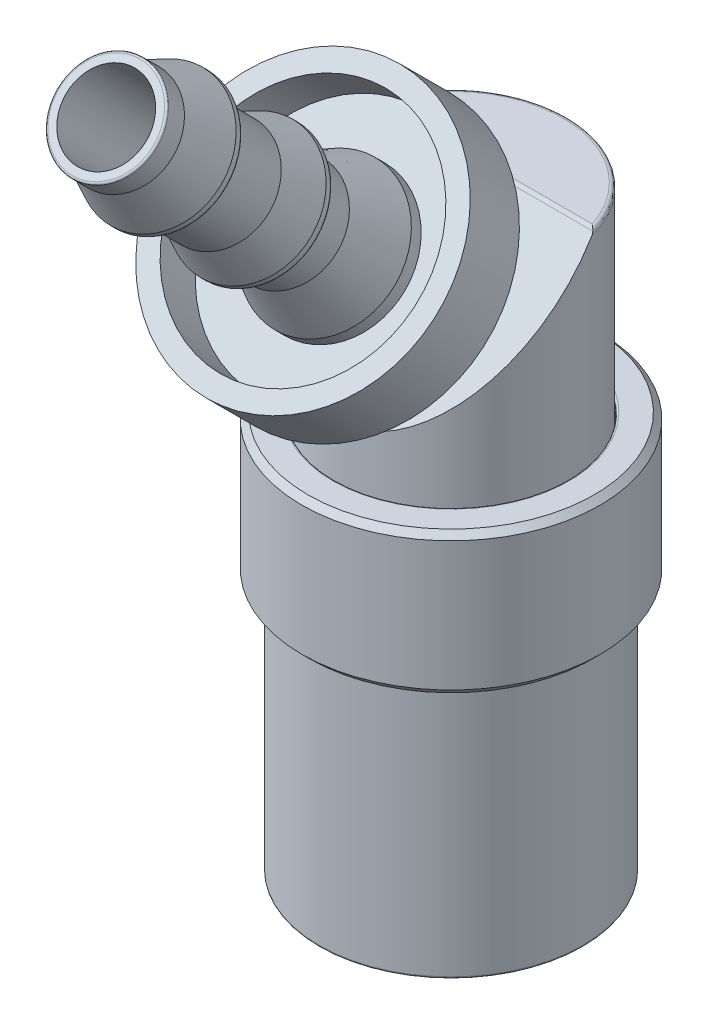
ISO-10303-21;
HEADER;
FILE_DESCRIPTION(('STEP AP214'),'2;1');
FILE_NAME('part.step','',(''),(''),'','','');
FILE_SCHEMA(('AUTOMOTIVE_DESIGN { 1 0 10303 214 1 1 1 1 }'));
ENDSEC;
DATA;
#1=APPLICATION_CONTEXT('core data for automotive mechanical design processes');
#2=APPLICATION_PROTOCOL_DEFINITION('international standard','automotive_design',2000,#1);
#3=PRODUCT_CONTEXT('',#1,'mechanical');
#4=PRODUCT('Part','Part','',(#3));
#5=PRODUCT_RELATED_PRODUCT_CATEGORY('part','',(#4));
#6=PRODUCT_DEFINITION_FORMATION('','',#4);
#7=PRODUCT_DEFINITION_CONTEXT('part definition',#1,'design');
#8=PRODUCT_DEFINITION('design','',#6,#7);
#9=PRODUCT_DEFINITION_SHAPE('','',#8);
#10=(LENGTH_UNIT() NAMED_UNIT(*) SI_UNIT(.MILLI.,.METRE.));
#11=(NAMED_UNIT(*) PLANE_ANGLE_UNIT() SI_UNIT($,.RADIAN.));
#12=(NAMED_UNIT(*) SI_UNIT($,.STERADIAN.) SOLID_ANGLE_UNIT());
#13=UNCERTAINTY_MEASURE_WITH_UNIT(LENGTH_MEASURE(1.E-05),#10,'distance_accuracy_value','');
#14=(GEOMETRIC_REPRESENTATION_CONTEXT(3) GLOBAL_UNCERTAINTY_ASSIGNED_CONTEXT((#13)) GLOBAL_UNIT_ASSIGNED_CONTEXT((#10,
#11,#12)) REPRESENTATION_CONTEXT('',''));
#15=CARTESIAN_POINT('',(0.,0.,0.));
#16=DIRECTION('',(0.,0.,1.));
#17=DIRECTION('',(1.,0.,0.));
#18=AXIS2_PLACEMENT_3D('',#15,#16,#17);
#19=CARTESIAN_POINT('',(0.092485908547,30.6465674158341,-0.0559392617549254));
#20=DIRECTION('',(0.,0.707106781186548,0.707106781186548));
#21=DIRECTION('',(0.,-0.707106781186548,0.707106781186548));
#22=AXIS2_PLACEMENT_3D('',#19,#20,#21);
#23=CONICAL_SURFACE('',#22,4.318,0.785398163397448);
#24=CARTESIAN_POINT('',(0.092485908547,30.377159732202,-0.325346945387));
#25=DIRECTION('',(0.,0.707106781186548,0.707106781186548));
#26=DIRECTION('',(0.,-0.707106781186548,0.707106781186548));
#27=AXIS2_PLACEMENT_3D('',#24,#25,#26);
#28=CIRCLE('',#27,3.937);
#29=CARTESIAN_POINT('',(0.0924859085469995,33.1610391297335,-3.10922634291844));
#30=VERTEX_POINT('',#29);
#31=EDGE_CURVE('P0_E11',#30,#30,#28,.T.);
#32=ORIENTED_EDGE('',*,*,#31,.T.);
#33=DIRECTION('',(0.,1.,0.));
#34=VECTOR('',#33,1.);
#35=CARTESIAN_POINT('',(0.0924859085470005,33.6998544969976,-3.10922634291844));
#36=LINE('',#35,#34);
#37=CARTESIAN_POINT('',(0.0924859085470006,34.249446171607,-3.10922634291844));
#38=VERTEX_POINT('',#37);
#39=EDGE_CURVE('P0_E27',#30,#38,#36,.T.);
#40=ORIENTED_EDGE('',*,*,#39,.T.);
#41=CARTESIAN_POINT('',(0.092485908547,30.9213632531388,0.218856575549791));
#42=DIRECTION('',(0.,-0.707106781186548,-0.707106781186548));
#43=DIRECTION('',(0.,0.707106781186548,-0.707106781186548));
#44=AXIS2_PLACEMENT_3D('',#41,#42,#43);
#45=CIRCLE('',#44,4.70662);
#46=CARTESIAN_POINT('',(0.0924859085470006,27.5932803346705,3.54693949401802));
#47=VERTEX_POINT('',#46);
#48=EDGE_CURVE('P0_E383',#38,#47,#45,.T.);
#49=ORIENTED_EDGE('',*,*,#48,.T.);
#50=CARTESIAN_POINT('',(0.092485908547,30.9213632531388,0.218856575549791));
#51=DIRECTION('',(0.,-0.707106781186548,-0.707106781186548));
#52=DIRECTION('',(0.,0.707106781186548,-0.707106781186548));
#53=AXIS2_PLACEMENT_3D('',#50,#51,#52);
#54=CIRCLE('',#53,4.70662);
#55=EDGE_CURVE('P0_E464',#47,#38,#54,.T.);
#56=ORIENTED_EDGE('',*,*,#55,.T.);
#57=ORIENTED_EDGE('',*,*,#39,.F.);
#58=EDGE_LOOP('',(#32,#40,#49,#56,#57));
#59=FACE_BOUND('',#58,.T.);
#60=ADVANCED_FACE('P0_F16',(#59),#23,.T.);
#61=CARTESIAN_POINT('',(0.092485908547,32.6222237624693,1.91971708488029));
#62=DIRECTION('',(0.,-0.707106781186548,-0.707106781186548));
#63=DIRECTION('',(0.,0.707106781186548,-0.707106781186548));
#64=AXIS2_PLACEMENT_3D('',#61,#62,#63);
#65=CYLINDRICAL_SURFACE('',#64,4.70662);
#66=ORIENTED_EDGE('',*,*,#55,.F.);
#67=DIRECTION('',(0.,0.707106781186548,0.707106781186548));
#68=VECTOR('',#67,1.);
#69=CARTESIAN_POINT('',(0.0924859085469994,29.294140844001,5.24780000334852));
#70=LINE('',#69,#68);
#71=CARTESIAN_POINT('',(0.0924859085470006,31.5423157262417,7.49597488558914));
#72=VERTEX_POINT('',#71);
#73=EDGE_CURVE('P0_E460',#47,#72,#70,.T.);
#74=ORIENTED_EDGE('',*,*,#73,.T.);
#75=CARTESIAN_POINT('',(0.092485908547,34.8703986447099,4.16789196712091));
#76=DIRECTION('',(0.,-0.707106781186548,-0.707106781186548));
#77=DIRECTION('',(0.,0.707106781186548,-0.707106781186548));
#78=AXIS2_PLACEMENT_3D('',#75,#76,#77);
#79=CIRCLE('',#78,4.70662);
#80=CARTESIAN_POINT('',(0.0924859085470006,38.1984815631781,0.839809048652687));
#81=VERTEX_POINT('',#80);
#82=EDGE_CURVE('P0_E465',#72,#81,#79,.T.);
#83=ORIENTED_EDGE('',*,*,#82,.T.);
#84=CARTESIAN_POINT('',(0.092485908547,34.8703986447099,4.16789196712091));
#85=DIRECTION('',(0.,-0.707106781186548,-0.707106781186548));
#86=DIRECTION('',(0.,0.707106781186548,-0.707106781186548));
#87=AXIS2_PLACEMENT_3D('',#84,#85,#86);
#88=CIRCLE('',#87,4.70662);
#89=EDGE_CURVE('P0_E472',#81,#72,#88,.T.);
#90=ORIENTED_EDGE('',*,*,#89,.T.);
#91=ORIENTED_EDGE('',*,*,#73,.F.);
#92=ORIENTED_EDGE('',*,*,#48,.F.);
#93=EDGE_LOOP('',(#66,#74,#83,#90,#91,#92));
#94=FACE_BOUND('',#93,.T.);
#95=ADVANCED_FACE('P0_F655',(#94),#65,.T.);
#96=CARTESIAN_POINT('',(0.092485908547,32.200151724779,-2.14833893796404));
#97=DIRECTION('',(0.,-0.707106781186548,-0.707106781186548));
#98=DIRECTION('',(0.,0.707106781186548,-0.707106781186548));
#99=AXIS2_PLACEMENT_3D('',#96,#97,#98);
#100=PLANE('',#99);
#101=ORIENTED_EDGE('',*,*,#31,.F.);
#102=EDGE_LOOP('',(#101));
#103=FACE_BOUND('',#102,.T.);
#104=CARTESIAN_POINT('',(0.092485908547,30.377159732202,-0.325346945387));
#105=DIRECTION('',(0.,-0.707106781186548,-0.707106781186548));
#106=DIRECTION('',(1.,0.,0.));
#107=AXIS2_PLACEMENT_3D('',#104,#105,#106);
#108=CIRCLE('',#107,2.5781);
#109=CARTESIAN_POINT('',(0.092485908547,32.200151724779,-2.14833893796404));
#110=VERTEX_POINT('',#109);
#111=CARTESIAN_POINT('',(0.0924859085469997,28.554167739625,1.49764504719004));
#112=VERTEX_POINT('',#111);
#113=EDGE_CURVE('P0_E458',#110,#112,#108,.T.);
#114=ORIENTED_EDGE('',*,*,#113,.F.);
#115=CARTESIAN_POINT('',(0.092485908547,30.377159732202,-0.325346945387));
#116=DIRECTION('',(0.,-0.707106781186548,-0.707106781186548));
#117=DIRECTION('',(1.,0.,0.));
#118=AXIS2_PLACEMENT_3D('',#115,#116,#117);
#119=CIRCLE('',#118,2.5781);
#120=EDGE_CURVE('P0_E624',#112,#110,#119,.T.);
#121=ORIENTED_EDGE('',*,*,#120,.F.);
#122=EDGE_LOOP('',(#114,#121));
#123=FACE_BOUND('',#122,.T.);
#124=ADVANCED_FACE('P0_F652',(#103,#123),#100,.T.);
#125=CARTESIAN_POINT('',(0.0924859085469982,26.4989642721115,3.55284851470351));
#126=DIRECTION('',(0.5,0.612372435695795,-0.612372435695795));
#127=DIRECTION('',(0.,-0.707106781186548,-0.707106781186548));
#128=AXIS2_PLACEMENT_3D('',#125,#126,#127);
#129=PLANE('',#128);
#130=CARTESIAN_POINT('',(-4.657314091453,34.83219557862,8.00788436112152));
#131=CARTESIAN_POINT('',(-2.28241409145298,34.4224160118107,9.5372025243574));
#132=CARTESIAN_POINT('',(0.0924859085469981,32.8930978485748,9.94698209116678));
#133=(BOUNDED_CURVE() B_SPLINE_CURVE(2,(#130,#131,#132),.UNSPECIFIED.,.F.,
.F.) B_SPLINE_CURVE_WITH_KNOTS((3,3),(0.0756877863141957,0.66089469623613),
.UNSPECIFIED.) CURVE() GEOMETRIC_REPRESENTATION_ITEM() RATIONAL_B_SPLINE_CURVE((1.0473309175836,
1.20935357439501,1.0473309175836)) REPRESENTATION_ITEM(''));
#134=CARTESIAN_POINT('',(-4.657314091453,34.83219557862,8.00788436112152));
#135=VERTEX_POINT('',#134);
#136=CARTESIAN_POINT('',(0.0924859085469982,32.8930978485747,9.94698209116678));
#137=VERTEX_POINT('',#136);
#138=EDGE_CURVE('P0_E370',#135,#137,#133,.T.);
#139=ORIENTED_EDGE('',*,*,#138,.F.);
#140=DIRECTION('',(0.,0.707106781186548,0.707106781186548));
#141=VECTOR('',#140,1.);
#142=CARTESIAN_POINT('',(-4.657314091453,28.4380620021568,1.61375078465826));
#143=LINE('',#142,#141);
#144=CARTESIAN_POINT('',(-4.657314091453,33.2489085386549,6.42459732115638));
#145=VERTEX_POINT('',#144);
#146=EDGE_CURVE('P0_E334',#145,#135,#143,.T.);
#147=ORIENTED_EDGE('',*,*,#146,.F.);
#148=CARTESIAN_POINT('',(0.0924859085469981,31.3098108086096,8.36369505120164));
#149=CARTESIAN_POINT('',(-2.28241409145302,31.719590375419,6.83437688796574));
#150=CARTESIAN_POINT('',(-4.657314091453,33.2489085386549,6.42459732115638));
#151=(BOUNDED_CURVE() B_SPLINE_CURVE(2,(#148,#149,#150),.UNSPECIFIED.,.F.,
.F.) B_SPLINE_CURVE_WITH_KNOTS((3,3),(0.0756877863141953,0.66089469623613),
.UNSPECIFIED.) CURVE() GEOMETRIC_REPRESENTATION_ITEM() RATIONAL_B_SPLINE_CURVE((1.0473309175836,
1.20935357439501,1.0473309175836)) REPRESENTATION_ITEM(''));
#152=CARTESIAN_POINT('',(0.0924859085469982,31.3098108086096,8.36369505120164));
#153=VERTEX_POINT('',#152);
#154=EDGE_CURVE('P0_E345',#153,#145,#151,.T.);
#155=ORIENTED_EDGE('',*,*,#154,.F.);
#156=DIRECTION('',(0.,0.707106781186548,0.707106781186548));
#157=VECTOR('',#156,1.);
#158=CARTESIAN_POINT('',(0.0924859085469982,26.4989642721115,3.55284851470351));
#159=LINE('',#158,#157);
#160=EDGE_CURVE('P0_E293',#153,#137,#159,.T.);
#161=ORIENTED_EDGE('',*,*,#160,.T.);
#162=EDGE_LOOP('',(#139,#147,#155,#161));
#163=FACE_BOUND('',#162,.T.);
#164=ADVANCED_FACE('P0_F654',(#163),#129,.F.);
#165=CARTESIAN_POINT('',(4.842285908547,28.4380620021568,1.61375078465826));
#166=DIRECTION('',(-0.5,0.612372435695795,-0.612372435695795));
#167=DIRECTION('',(-0.866025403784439,-0.353553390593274,0.353553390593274));
#168=AXIS2_PLACEMENT_3D('',#165,#166,#167);
#169=PLANE('',#168);
#170=CARTESIAN_POINT('',(0.0924859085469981,32.8930978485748,9.94698209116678));
#171=CARTESIAN_POINT('',(2.46738590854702,34.4224160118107,9.5372025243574));
#172=CARTESIAN_POINT('',(4.84228590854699,34.83219557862,8.00788436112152));
#173=(BOUNDED_CURVE() B_SPLINE_CURVE(2,(#170,#171,#172),.UNSPECIFIED.,.F.,
.F.) B_SPLINE_CURVE_WITH_KNOTS((3,3),(0.0756877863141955,0.66089469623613),
.UNSPECIFIED.) CURVE() GEOMETRIC_REPRESENTATION_ITEM() RATIONAL_B_SPLINE_CURVE((1.0473309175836,
1.20935357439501,1.0473309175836)) REPRESENTATION_ITEM(''));
#174=CARTESIAN_POINT('',(4.842285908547,34.83219557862,8.00788436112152));
#175=VERTEX_POINT('',#174);
#176=EDGE_CURVE('P0_E360',#137,#175,#173,.T.);
#177=ORIENTED_EDGE('',*,*,#176,.F.);
#178=ORIENTED_EDGE('',*,*,#160,.F.);
#179=CARTESIAN_POINT('',(4.84228590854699,33.2489085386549,6.42459732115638));
#180=CARTESIAN_POINT('',(2.46738590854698,31.719590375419,6.83437688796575));
#181=CARTESIAN_POINT('',(0.0924859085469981,31.3098108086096,8.36369505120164));
#182=(BOUNDED_CURVE() B_SPLINE_CURVE(2,(#179,#180,#181),.UNSPECIFIED.,.F.,
.F.) B_SPLINE_CURVE_WITH_KNOTS((3,3),(0.0756877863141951,0.66089469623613),
.UNSPECIFIED.) CURVE() GEOMETRIC_REPRESENTATION_ITEM() RATIONAL_B_SPLINE_CURVE((1.0473309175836,
1.20935357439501,1.0473309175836)) REPRESENTATION_ITEM(''));
#183=CARTESIAN_POINT('',(4.842285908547,33.2489085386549,6.42459732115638));
#184=VERTEX_POINT('',#183);
#185=EDGE_CURVE('P0_E352',#184,#153,#182,.T.);
#186=ORIENTED_EDGE('',*,*,#185,.F.);
#187=DIRECTION('',(0.,0.707106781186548,0.707106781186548));
#188=VECTOR('',#187,1.);
#189=CARTESIAN_POINT('',(4.842285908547,28.4380620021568,1.61375078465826));
#190=LINE('',#189,#188);
#191=EDGE_CURVE('P0_E478',#184,#175,#190,.T.);
#192=ORIENTED_EDGE('',*,*,#191,.T.);
#193=EDGE_LOOP('',(#177,#178,#186,#192));
#194=FACE_BOUND('',#193,.T.);
#195=ADVANCED_FACE('P0_F662',(#194),#169,.F.);
#196=CARTESIAN_POINT('',(4.842285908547,32.3162574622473,-2.26444467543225));
#197=DIRECTION('',(-1.,0.,0.));
#198=DIRECTION('',(0.,0.707106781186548,0.707106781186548));
#199=AXIS2_PLACEMENT_3D('',#196,#197,#198);
#200=PLANE('',#199);
#201=CARTESIAN_POINT('',(4.84228590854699,34.83219557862,8.00788436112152));
#202=CARTESIAN_POINT('',(4.842285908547,37.3310626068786,6.62855592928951));
#203=CARTESIAN_POINT('',(4.84228590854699,38.7103910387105,4.129688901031));
#204=(BOUNDED_CURVE() B_SPLINE_CURVE(2,(#201,#202,#203),.UNSPECIFIED.,.F.,
.F.) B_SPLINE_CURVE_WITH_KNOTS((3,3),(0.0756877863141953,0.66089469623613),
.UNSPECIFIED.) CURVE() GEOMETRIC_REPRESENTATION_ITEM() RATIONAL_B_SPLINE_CURVE((1.0473309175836,
1.20935357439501,1.0473309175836)) REPRESENTATION_ITEM(''));
#205=CARTESIAN_POINT('',(4.842285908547,38.7103910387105,4.12968890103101));
#206=VERTEX_POINT('',#205);
#207=EDGE_CURVE('P0_E321',#175,#206,#204,.T.);
#208=ORIENTED_EDGE('',*,*,#207,.F.);
#209=ORIENTED_EDGE('',*,*,#191,.F.);
#210=CARTESIAN_POINT('',(4.84228590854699,37.1271039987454,2.54640186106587));
#211=CARTESIAN_POINT('',(4.842285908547,34.6282369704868,3.92573029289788));
#212=CARTESIAN_POINT('',(4.84228590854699,33.2489085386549,6.42459732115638));
#213=(BOUNDED_CURVE() B_SPLINE_CURVE(2,(#210,#211,#212),.UNSPECIFIED.,.F.,
.F.) B_SPLINE_CURVE_WITH_KNOTS((3,3),(0.0756877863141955,0.660894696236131),
.UNSPECIFIED.) CURVE() GEOMETRIC_REPRESENTATION_ITEM() RATIONAL_B_SPLINE_CURVE((1.0473309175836,
1.20935357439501,1.0473309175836)) REPRESENTATION_ITEM(''));
#214=CARTESIAN_POINT('',(4.842285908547,37.1271039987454,2.54640186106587));
#215=VERTEX_POINT('',#214);
#216=EDGE_CURVE('P0_E390',#215,#184,#213,.T.);
#217=ORIENTED_EDGE('',*,*,#216,.F.);
#218=DIRECTION('',(0.,0.707106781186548,0.707106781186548));
#219=VECTOR('',#218,1.);
#220=CARTESIAN_POINT('',(4.842285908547,32.3162574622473,-2.26444467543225));
#221=LINE('',#220,#219);
#222=EDGE_CURVE('P0_E433',#215,#206,#221,.T.);
#223=ORIENTED_EDGE('',*,*,#222,.T.);
#224=EDGE_LOOP('',(#208,#209,#217,#223));
#225=FACE_BOUND('',#224,.T.);
#226=ADVANCED_FACE('P0_F680',(#225),#200,.F.);
#227=CARTESIAN_POINT('',(0.0924859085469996,34.2553551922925,-4.20354240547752));
#228=DIRECTION('',(-0.5,-0.612372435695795,0.612372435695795));
#229=DIRECTION('',(0.,0.707106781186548,0.707106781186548));
#230=AXIS2_PLACEMENT_3D('',#227,#228,#229);
#231=PLANE('',#230);
#232=CARTESIAN_POINT('',(4.84228590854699,38.7103910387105,4.129688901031));
#233=CARTESIAN_POINT('',(2.46738590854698,40.2397092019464,3.71990933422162));
#234=CARTESIAN_POINT('',(0.0924859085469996,40.6494887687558,2.19059117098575));
#235=(BOUNDED_CURVE() B_SPLINE_CURVE(2,(#232,#233,#234),.UNSPECIFIED.,.F.,
.F.) B_SPLINE_CURVE_WITH_KNOTS((3,3),(0.0756877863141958,0.66089469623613),
.UNSPECIFIED.) CURVE() GEOMETRIC_REPRESENTATION_ITEM() RATIONAL_B_SPLINE_CURVE((1.0473309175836,
1.20935357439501,1.0473309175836)) REPRESENTATION_ITEM(''));
#236=CARTESIAN_POINT('',(0.0924859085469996,40.6494887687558,2.19059117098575));
#237=VERTEX_POINT('',#236);
#238=EDGE_CURVE('P0_E339',#206,#237,#235,.T.);
#239=ORIENTED_EDGE('',*,*,#238,.F.);
#240=ORIENTED_EDGE('',*,*,#222,.F.);
#241=CARTESIAN_POINT('',(0.0924859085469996,39.0662017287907,0.607304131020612));
#242=CARTESIAN_POINT('',(2.46738590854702,37.5368835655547,1.01708369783));
#243=CARTESIAN_POINT('',(4.84228590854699,37.1271039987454,2.54640186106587));
#244=(BOUNDED_CURVE() B_SPLINE_CURVE(2,(#241,#242,#243),.UNSPECIFIED.,.F.,
.F.) B_SPLINE_CURVE_WITH_KNOTS((3,3),(0.0756877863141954,0.66089469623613),
.UNSPECIFIED.) CURVE() GEOMETRIC_REPRESENTATION_ITEM() RATIONAL_B_SPLINE_CURVE((1.0473309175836,
1.20935357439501,1.0473309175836)) REPRESENTATION_ITEM(''));
#245=CARTESIAN_POINT('',(0.0924859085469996,39.0662017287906,0.607304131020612));
#246=VERTEX_POINT('',#245);
#247=EDGE_CURVE('P0_E322',#246,#215,#244,.T.);
#248=ORIENTED_EDGE('',*,*,#247,.F.);
#249=DIRECTION('',(0.,0.707106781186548,0.707106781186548));
#250=VECTOR('',#249,1.);
#251=CARTESIAN_POINT('',(0.0924859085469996,34.2553551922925,-4.20354240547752));
#252=LINE('',#251,#250);
#253=EDGE_CURVE('P0_E429',#246,#237,#252,.T.);
#254=ORIENTED_EDGE('',*,*,#253,.T.);
#255=EDGE_LOOP('',(#239,#240,#248,#254));
#256=FACE_BOUND('',#255,.T.);
#257=ADVANCED_FACE('P0_F676',(#256),#231,.F.);
#258=CARTESIAN_POINT('',(-4.657314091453,32.3162574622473,-2.26444467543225));
#259=DIRECTION('',(0.5,-0.612372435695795,0.612372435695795));
#260=DIRECTION('',(0.,-0.707106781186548,-0.707106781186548));
#261=AXIS2_PLACEMENT_3D('',#258,#259,#260);
#262=PLANE('',#261);
#263=CARTESIAN_POINT('',(0.0924859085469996,40.6494887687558,2.19059117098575));
#264=CARTESIAN_POINT('',(-2.28241409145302,40.2397092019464,3.71990933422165));
#265=CARTESIAN_POINT('',(-4.657314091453,38.7103910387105,4.129688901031));
#266=(BOUNDED_CURVE() B_SPLINE_CURVE(2,(#263,#264,#265),.UNSPECIFIED.,.F.,
.F.) B_SPLINE_CURVE_WITH_KNOTS((3,3),(0.0756877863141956,0.66089469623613),
.UNSPECIFIED.) CURVE() GEOMETRIC_REPRESENTATION_ITEM() RATIONAL_B_SPLINE_CURVE((1.0473309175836,
1.20935357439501,1.0473309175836)) REPRESENTATION_ITEM(''));
#267=CARTESIAN_POINT('',(-4.657314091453,38.7103910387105,4.12968890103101));
#268=VERTEX_POINT('',#267);
#269=EDGE_CURVE('P0_E306',#237,#268,#266,.T.);
#270=ORIENTED_EDGE('',*,*,#269,.F.);
#271=ORIENTED_EDGE('',*,*,#253,.F.);
#272=CARTESIAN_POINT('',(-4.657314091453,37.1271039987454,2.54640186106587));
#273=CARTESIAN_POINT('',(-2.28241409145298,37.5368835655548,1.01708369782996));
#274=CARTESIAN_POINT('',(0.0924859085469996,39.0662017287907,0.607304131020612));
#275=(BOUNDED_CURVE() B_SPLINE_CURVE(2,(#272,#273,#274),.UNSPECIFIED.,.F.,
.F.) B_SPLINE_CURVE_WITH_KNOTS((3,3),(0.0756877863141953,0.66089469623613),
.UNSPECIFIED.) CURVE() GEOMETRIC_REPRESENTATION_ITEM() RATIONAL_B_SPLINE_CURVE((1.0473309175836,
1.20935357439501,1.0473309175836)) REPRESENTATION_ITEM(''));
#276=CARTESIAN_POINT('',(-4.657314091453,37.1271039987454,2.54640186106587));
#277=VERTEX_POINT('',#276);
#278=EDGE_CURVE('P0_E530',#277,#246,#275,.T.);
#279=ORIENTED_EDGE('',*,*,#278,.F.);
#280=DIRECTION('',(0.,0.707106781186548,0.707106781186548));
#281=VECTOR('',#280,1.);
#282=CARTESIAN_POINT('',(-4.657314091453,32.3162574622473,-2.26444467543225));
#283=LINE('',#282,#281);
#284=EDGE_CURVE('P0_E338',#277,#268,#283,.T.);
#285=ORIENTED_EDGE('',*,*,#284,.T.);
#286=EDGE_LOOP('',(#270,#271,#279,#285));
#287=FACE_BOUND('',#286,.T.);
#288=ADVANCED_FACE('P0_F679',(#287),#262,.F.);
#289=CARTESIAN_POINT('',(-4.657314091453,28.4380620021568,1.61375078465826));
#290=DIRECTION('',(1.,0.,0.));
#291=DIRECTION('',(0.,0.707106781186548,0.707106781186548));
#292=AXIS2_PLACEMENT_3D('',#289,#290,#291);
#293=PLANE('',#292);
#294=CARTESIAN_POINT('',(-4.657314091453,38.7103910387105,4.129688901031));
#295=CARTESIAN_POINT('',(-4.657314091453,37.3310626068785,6.62855592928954));
#296=CARTESIAN_POINT('',(-4.657314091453,34.83219557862,8.00788436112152));
#297=(BOUNDED_CURVE() B_SPLINE_CURVE(2,(#294,#295,#296),.UNSPECIFIED.,.F.,
.F.) B_SPLINE_CURVE_WITH_KNOTS((3,3),(0.0756877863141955,0.66089469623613),
.UNSPECIFIED.) CURVE() GEOMETRIC_REPRESENTATION_ITEM() RATIONAL_B_SPLINE_CURVE((1.0473309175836,
1.20935357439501,1.0473309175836)) REPRESENTATION_ITEM(''));
#298=EDGE_CURVE('P0_E313',#268,#135,#297,.T.);
#299=ORIENTED_EDGE('',*,*,#298,.F.);
#300=ORIENTED_EDGE('',*,*,#284,.F.);
#301=CARTESIAN_POINT('',(-4.657314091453,33.2489085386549,6.42459732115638));
#302=CARTESIAN_POINT('',(-4.657314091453,34.6282369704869,3.92573029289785));
#303=CARTESIAN_POINT('',(-4.657314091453,37.1271039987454,2.54640186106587));
#304=(BOUNDED_CURVE() B_SPLINE_CURVE(2,(#301,#302,#303),.UNSPECIFIED.,.F.,
.F.) B_SPLINE_CURVE_WITH_KNOTS((3,3),(0.0756877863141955,0.66089469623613),
.UNSPECIFIED.) CURVE() GEOMETRIC_REPRESENTATION_ITEM() RATIONAL_B_SPLINE_CURVE((1.0473309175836,
1.20935357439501,1.0473309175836)) REPRESENTATION_ITEM(''));
#305=EDGE_CURVE('P0_E353',#145,#277,#304,.T.);
#306=ORIENTED_EDGE('',*,*,#305,.F.);
#307=ORIENTED_EDGE('',*,*,#146,.T.);
#308=EDGE_LOOP('',(#299,#300,#306,#307));
#309=FACE_BOUND('',#308,.T.);
#310=ADVANCED_FACE('P0_F709',(#309),#293,.F.);
#311=CARTESIAN_POINT('',(0.092485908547,36.8429441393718,6.14043746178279));
#312=DIRECTION('',(0.,-0.707106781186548,-0.707106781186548));
#313=DIRECTION('',(0.,-0.707106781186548,0.707106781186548));
#314=AXIS2_PLACEMENT_3D('',#311,#312,#313);
#315=CONICAL_SURFACE('',#314,5.30908864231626,1.0471975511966);
#316=ORIENTED_EDGE('',*,*,#238,.T.);
#317=DIRECTION('',(0.,-0.258819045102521,0.965925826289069));
#318=VECTOR('',#317,1.);
#319=CARTESIAN_POINT('',(0.0924859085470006,40.5970367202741,2.38634488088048));
#320=LINE('',#319,#318);
#321=CARTESIAN_POINT('',(0.0924859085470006,40.399816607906,3.12238036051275));
#322=VERTEX_POINT('',#321);
#323=EDGE_CURVE('P0_E20',#237,#322,#320,.T.);
#324=ORIENTED_EDGE('',*,*,#323,.T.);
#325=CARTESIAN_POINT('',(0.092485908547,37.1123518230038,6.40984514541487));
#326=DIRECTION('',(0.,-0.707106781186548,-0.707106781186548));
#327=DIRECTION('',(0.,-0.707106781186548,0.707106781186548));
#328=AXIS2_PLACEMENT_3D('',#325,#326,#327);
#329=CIRCLE('',#328,4.64917728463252);
#330=EDGE_CURVE('P0_E312',#322,#322,#329,.T.);
#331=ORIENTED_EDGE('',*,*,#330,.T.);
#332=ORIENTED_EDGE('',*,*,#323,.F.);
#333=ORIENTED_EDGE('',*,*,#269,.T.);
#334=ORIENTED_EDGE('',*,*,#298,.T.);
#335=ORIENTED_EDGE('',*,*,#138,.T.);
#336=ORIENTED_EDGE('',*,*,#176,.T.);
#337=ORIENTED_EDGE('',*,*,#207,.T.);
#338=EDGE_LOOP('',(#316,#324,#331,#332,#333,#334,#335,#336,#337));
#339=FACE_BOUND('',#338,.T.);
#340=ADVANCED_FACE('P0_F721',(#339),#315,.T.);
#341=CARTESIAN_POINT('',(0.092485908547,41.3330721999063,2.18912476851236));
#342=DIRECTION('',(0.,0.707106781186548,0.707106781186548));
#343=DIRECTION('',(1.,0.,0.));
#344=AXIS2_PLACEMENT_3D('',#341,#342,#343);
#345=PLANE('',#344);
#346=ORIENTED_EDGE('',*,*,#330,.F.);
#347=EDGE_LOOP('',(#346));
#348=FACE_BOUND('',#347,.T.);
#349=CARTESIAN_POINT('',(0.092485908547,37.1123518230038,6.40984514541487));
#350=DIRECTION('',(0.,0.707106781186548,0.707106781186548));
#351=DIRECTION('',(0.,-0.707106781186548,0.707106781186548));
#352=AXIS2_PLACEMENT_3D('',#349,#350,#351);
#353=CIRCLE('',#352,4.2545);
#354=CARTESIAN_POINT('',(0.0924859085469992,40.120737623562,3.4014593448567));
#355=VERTEX_POINT('',#354);
#356=CARTESIAN_POINT('',(0.0924859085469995,34.1039660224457,9.41823094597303));
#357=VERTEX_POINT('',#356);
#358=EDGE_CURVE('P0_E270',#355,#357,#353,.T.);
#359=ORIENTED_EDGE('',*,*,#358,.F.);
#360=CARTESIAN_POINT('',(0.092485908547,37.1123518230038,6.40984514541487));
#361=DIRECTION('',(0.,0.707106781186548,0.707106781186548));
#362=DIRECTION('',(0.,-0.707106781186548,0.707106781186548));
#363=AXIS2_PLACEMENT_3D('',#360,#361,#362);
#364=CIRCLE('',#363,4.2545);
#365=EDGE_CURVE('P0_E273',#357,#355,#364,.T.);
#366=ORIENTED_EDGE('',*,*,#365,.F.);
#367=EDGE_LOOP('',(#359,#366));
#368=FACE_BOUND('',#367,.T.);
#369=ADVANCED_FACE('P0_F272',(#348,#368),#345,.T.);
#370=CARTESIAN_POINT('',(0.092485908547,35.1265254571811,4.42401877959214));
#371=DIRECTION('',(0.,0.707106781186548,0.707106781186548));
#372=DIRECTION('',(0.,-0.707106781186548,0.707106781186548));
#373=AXIS2_PLACEMENT_3D('',#370,#371,#372);
#374=CONICAL_SURFACE('',#373,5.334,1.0471975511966);
#375=ORIENTED_EDGE('',*,*,#82,.F.);
#376=ORIENTED_EDGE('',*,*,#89,.F.);
#377=DIRECTION('',(0.,0.965925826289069,-0.258819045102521));
#378=VECTOR('',#377,1.);
#379=CARTESIAN_POINT('',(0.0924859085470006,38.8982330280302,0.652311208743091));
#380=LINE('',#379,#378);
#381=EDGE_CURVE('P0_E314',#81,#246,#380,.T.);
#382=ORIENTED_EDGE('',*,*,#381,.T.);
#383=ORIENTED_EDGE('',*,*,#247,.T.);
#384=ORIENTED_EDGE('',*,*,#216,.T.);
#385=ORIENTED_EDGE('',*,*,#185,.T.);
#386=ORIENTED_EDGE('',*,*,#154,.T.);
#387=ORIENTED_EDGE('',*,*,#305,.T.);
#388=ORIENTED_EDGE('',*,*,#278,.T.);
#389=ORIENTED_EDGE('',*,*,#381,.F.);
#390=EDGE_LOOP('',(#375,#376,#382,#383,#384,#385,#386,#387,#388,#389));
#391=FACE_BOUND('',#390,.T.);
#392=ADVANCED_FACE('P0_F715',(#391),#374,.T.);
#393=CARTESIAN_POINT('',(0.092485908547,37.2021543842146,6.49964770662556));
#394=DIRECTION('',(0.,-0.707106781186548,-0.707106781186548));
#395=DIRECTION('',(0.,0.707106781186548,-0.707106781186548));
#396=AXIS2_PLACEMENT_3D('',#393,#394,#395);
#397=TOROIDAL_SURFACE('',#396,4.2545,0.127);
#398=CARTESIAN_POINT('',(0.092485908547,37.2021543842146,6.49964770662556));
#399=DIRECTION('',(0.,-0.707106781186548,-0.707106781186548));
#400=DIRECTION('',(0.,-0.707106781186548,0.707106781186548));
#401=AXIS2_PLACEMENT_3D('',#398,#399,#400);
#402=CIRCLE('',#401,4.1275);
#403=CARTESIAN_POINT('',(0.0924859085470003,40.120737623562,3.58106446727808));
#404=VERTEX_POINT('',#403);
#405=CARTESIAN_POINT('',(0.0924859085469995,34.2835711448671,9.41823094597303));
#406=VERTEX_POINT('',#405);
#407=EDGE_CURVE('P0_E289',#404,#406,#402,.T.);
#408=ORIENTED_EDGE('',*,*,#407,.T.);
#409=CARTESIAN_POINT('',(0.0924859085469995,34.1937685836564,9.50803350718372));
#410=DIRECTION('',(-1.,0.,0.));
#411=DIRECTION('',(0.,-0.707106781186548,0.707106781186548));
#412=AXIS2_PLACEMENT_3D('',#409,#410,#411);
#413=CIRCLE('',#412,0.127);
#414=EDGE_CURVE('P0_E282',#406,#357,#413,.T.);
#415=ORIENTED_EDGE('',*,*,#414,.T.);
#416=ORIENTED_EDGE('',*,*,#365,.T.);
#417=ORIENTED_EDGE('',*,*,#358,.T.);
#418=ORIENTED_EDGE('',*,*,#414,.F.);
#419=CARTESIAN_POINT('',(0.092485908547,37.2021543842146,6.49964770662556));
#420=DIRECTION('',(0.,-0.707106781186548,-0.707106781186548));
#421=DIRECTION('',(0.,-0.707106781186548,0.707106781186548));
#422=AXIS2_PLACEMENT_3D('',#419,#420,#421);
#423=CIRCLE('',#422,4.1275);
#424=EDGE_CURVE('P0_E278',#406,#404,#423,.T.);
#425=ORIENTED_EDGE('',*,*,#424,.T.);
#426=EDGE_LOOP('',(#408,#415,#416,#417,#418,#425));
#427=FACE_BOUND('',#426,.T.);
#428=ADVANCED_FACE('P0_F281',(#427),#397,.F.);
#429=CARTESIAN_POINT('',(0.092485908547,37.6691277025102,6.96662102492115));
#430=DIRECTION('',(0.,-0.707106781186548,-0.707106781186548));
#431=DIRECTION('',(0.,0.707106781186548,-0.707106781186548));
#432=AXIS2_PLACEMENT_3D('',#429,#430,#431);
#433=CYLINDRICAL_SURFACE('',#432,4.1275);
#434=ORIENTED_EDGE('',*,*,#407,.F.);
#435=ORIENTED_EDGE('',*,*,#424,.F.);
#436=DIRECTION('',(0.,0.707106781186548,0.707106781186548));
#437=VECTOR('',#436,1.);
#438=CARTESIAN_POINT('',(0.0924859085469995,34.7505444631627,9.88520426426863));
#439=LINE('',#438,#437);
#440=CARTESIAN_POINT('',(0.0924859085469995,35.307320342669,10.4419801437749));
#441=VERTEX_POINT('',#440);
#442=EDGE_CURVE('P0_E329',#406,#441,#439,.T.);
#443=ORIENTED_EDGE('',*,*,#442,.T.);
#444=CARTESIAN_POINT('',(0.092485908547,38.2259035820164,7.52339690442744));
#445=DIRECTION('',(0.,-0.707106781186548,-0.707106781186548));
#446=DIRECTION('',(1.,0.,0.));
#447=AXIS2_PLACEMENT_3D('',#444,#445,#446);
#448=CIRCLE('',#447,4.1275);
#449=CARTESIAN_POINT('',(0.092485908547,41.1444868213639,4.60481366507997));
#450=VERTEX_POINT('',#449);
#451=EDGE_CURVE('P0_E333',#441,#450,#448,.T.);
#452=ORIENTED_EDGE('',*,*,#451,.T.);
#453=CARTESIAN_POINT('',(0.092485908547,38.2259035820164,7.52339690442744));
#454=DIRECTION('',(0.,-0.707106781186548,-0.707106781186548));
#455=DIRECTION('',(1.,0.,0.));
#456=AXIS2_PLACEMENT_3D('',#453,#454,#455);
#457=CIRCLE('',#456,4.1275);
#458=EDGE_CURVE('P0_E425',#450,#441,#457,.T.);
#459=ORIENTED_EDGE('',*,*,#458,.T.);
#460=ORIENTED_EDGE('',*,*,#442,.F.);
#461=EDGE_LOOP('',(#434,#435,#443,#452,#459,#460));
#462=FACE_BOUND('',#461,.T.);
#463=ADVANCED_FACE('P0_F687',(#462),#433,.T.);
#464=CARTESIAN_POINT('',(0.092485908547,43.5781362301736,12.8756295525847));
#465=DIRECTION('',(0.,-0.707106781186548,-0.707106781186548));
#466=DIRECTION('',(0.,0.707106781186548,-0.707106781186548));
#467=AXIS2_PLACEMENT_3D('',#464,#465,#466);
#468=TOROIDAL_SURFACE('',#467,4.01319999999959,0.127);
#469=CARTESIAN_POINT('',(0.092485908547,43.488333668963,12.785826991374));
#470=DIRECTION('',(0.,0.707106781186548,0.707106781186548));
#471=DIRECTION('',(0.,-0.707106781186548,0.707106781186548));
#472=AXIS2_PLACEMENT_3D('',#469,#470,#471);
#473=CIRCLE('',#472,4.01319999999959);
#474=CARTESIAN_POINT('',(0.0924859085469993,46.3260946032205,9.9480660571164));
#475=VERTEX_POINT('',#474);
#476=CARTESIAN_POINT('',(0.0924859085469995,40.6505727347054,15.6235879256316));
#477=VERTEX_POINT('',#476);
#478=EDGE_CURVE('P0_E127',#475,#477,#473,.T.);
#479=ORIENTED_EDGE('',*,*,#478,.T.);
#480=CARTESIAN_POINT('',(0.0924859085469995,40.7403752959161,15.7133904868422));
#481=DIRECTION('',(-1.,0.,0.));
#482=DIRECTION('',(0.,-0.707106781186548,0.707106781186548));
#483=AXIS2_PLACEMENT_3D('',#480,#481,#482);
#484=CIRCLE('',#483,0.127);
#485=CARTESIAN_POINT('',(0.0924859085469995,40.6505727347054,15.8031930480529));
#486=VERTEX_POINT('',#485);
#487=EDGE_CURVE('P0_E601',#477,#486,#484,.T.);
#488=ORIENTED_EDGE('',*,*,#487,.T.);
#489=CARTESIAN_POINT('',(0.092485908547,43.5781362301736,12.8756295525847));
#490=DIRECTION('',(0.,-0.707106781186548,-0.707106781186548));
#491=DIRECTION('',(0.,-0.707106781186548,0.707106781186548));
#492=AXIS2_PLACEMENT_3D('',#489,#490,#491);
#493=CIRCLE('',#492,4.1401999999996);
#494=CARTESIAN_POINT('',(0.0924859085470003,46.5056997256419,9.9480660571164));
#495=VERTEX_POINT('',#494);
#496=EDGE_CURVE('P0_E113',#486,#495,#493,.T.);
#497=ORIENTED_EDGE('',*,*,#496,.T.);
#498=CARTESIAN_POINT('',(0.092485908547,43.5781362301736,12.8756295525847));
#499=DIRECTION('',(0.,-0.707106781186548,-0.707106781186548));
#500=DIRECTION('',(0.,-0.707106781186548,0.707106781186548));
#501=AXIS2_PLACEMENT_3D('',#498,#499,#500);
#502=CIRCLE('',#501,4.1401999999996);
#503=EDGE_CURVE('P0_E488',#495,#486,#502,.T.);
#504=ORIENTED_EDGE('',*,*,#503,.T.);
#505=ORIENTED_EDGE('',*,*,#487,.F.);
#506=CARTESIAN_POINT('',(0.092485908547,43.488333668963,12.785826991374));
#507=DIRECTION('',(0.,0.707106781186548,0.707106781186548));
#508=DIRECTION('',(0.,-0.707106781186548,0.707106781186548));
#509=AXIS2_PLACEMENT_3D('',#506,#507,#508);
#510=CIRCLE('',#509,4.01319999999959);
#511=EDGE_CURVE('P0_E446',#477,#475,#510,.T.);
#512=ORIENTED_EDGE('',*,*,#511,.T.);
#513=EDGE_LOOP('',(#479,#488,#497,#504,#505,#512));
#514=FACE_BOUND('',#513,.T.);
#515=ADVANCED_FACE('P0_F690',(#514),#468,.T.);
#516=CARTESIAN_POINT('',(0.092485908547,43.6679387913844,12.9654321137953));
#517=DIRECTION('',(0.,-0.707106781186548,-0.707106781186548));
#518=DIRECTION('',(0.,0.707106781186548,-0.707106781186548));
#519=AXIS2_PLACEMENT_3D('',#516,#517,#518);
#520=CYLINDRICAL_SURFACE('',#519,4.1401999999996);
#521=ORIENTED_EDGE('',*,*,#503,.F.);
#522=ORIENTED_EDGE('',*,*,#496,.F.);
#523=DIRECTION('',(0.,0.707106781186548,0.707106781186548));
#524=VECTOR('',#523,1.);
#525=CARTESIAN_POINT('',(0.0924859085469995,40.7403752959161,15.8929956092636));
#526=LINE('',#525,#524);
#527=CARTESIAN_POINT('',(0.0924859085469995,40.9199804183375,16.072600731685));
#528=VERTEX_POINT('',#527);
#529=EDGE_CURVE('P0_E442',#486,#528,#526,.T.);
#530=ORIENTED_EDGE('',*,*,#529,.T.);
#531=CARTESIAN_POINT('',(0.092485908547,43.8475439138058,13.1450372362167));
#532=DIRECTION('',(0.,-0.707106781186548,-0.707106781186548));
#533=DIRECTION('',(1.,0.,0.));
#534=AXIS2_PLACEMENT_3D('',#531,#532,#533);
#535=CIRCLE('',#534,4.14019999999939);
#536=CARTESIAN_POINT('',(0.092485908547,46.7751074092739,10.2174737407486));
#537=VERTEX_POINT('',#536);
#538=EDGE_CURVE('P0_E447',#528,#537,#535,.T.);
#539=ORIENTED_EDGE('',*,*,#538,.T.);
#540=CARTESIAN_POINT('',(0.092485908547,43.8475439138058,13.1450372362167));
#541=DIRECTION('',(0.,-0.707106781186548,-0.707106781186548));
#542=DIRECTION('',(1.,0.,0.));
#543=AXIS2_PLACEMENT_3D('',#540,#541,#542);
#544=CIRCLE('',#543,4.14019999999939);
#545=EDGE_CURVE('P0_E470',#537,#528,#544,.T.);
#546=ORIENTED_EDGE('',*,*,#545,.T.);
#547=ORIENTED_EDGE('',*,*,#529,.F.);
#548=EDGE_LOOP('',(#521,#522,#530,#539,#546,#547));
#549=FACE_BOUND('',#548,.T.);
#550=ADVANCED_FACE('P0_F686',(#549),#520,.T.);
#551=CARTESIAN_POINT('',(0.092485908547,45.8232002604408,10.4509603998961));
#552=DIRECTION('',(0.,-0.707106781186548,-0.707106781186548));
#553=DIRECTION('',(0.,0.707106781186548,-0.707106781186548));
#554=AXIS2_PLACEMENT_3D('',#551,#552,#553);
#555=PLANE('',#554);
#556=ORIENTED_EDGE('',*,*,#478,.F.);
#557=ORIENTED_EDGE('',*,*,#511,.F.);
#558=EDGE_LOOP('',(#556,#557));
#559=FACE_BOUND('',#558,.T.);
#560=CARTESIAN_POINT('',(0.092485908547,43.488333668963,12.785826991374));
#561=DIRECTION('',(0.,-0.707106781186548,-0.707106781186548));
#562=DIRECTION('',(1.,0.,0.));
#563=AXIS2_PLACEMENT_3D('',#560,#561,#562);
#564=CIRCLE('',#563,3.30199999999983);
#565=CARTESIAN_POINT('',(0.092485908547,45.8232002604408,10.4509603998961));
#566=VERTEX_POINT('',#565);
#567=CARTESIAN_POINT('',(0.0924859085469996,41.1534670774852,15.1206935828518));
#568=VERTEX_POINT('',#567);
#569=EDGE_CURVE('P0_E625',#566,#568,#564,.T.);
#570=ORIENTED_EDGE('',*,*,#569,.F.);
#571=CARTESIAN_POINT('',(0.092485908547,43.488333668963,12.785826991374));
#572=DIRECTION('',(0.,-0.707106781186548,-0.707106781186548));
#573=DIRECTION('',(1.,0.,0.));
#574=AXIS2_PLACEMENT_3D('',#571,#572,#573);
#575=CIRCLE('',#574,3.30199999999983);
#576=EDGE_CURVE('P0_E422',#568,#566,#575,.T.);
#577=ORIENTED_EDGE('',*,*,#576,.F.);
#578=EDGE_LOOP('',(#570,#577));
#579=FACE_BOUND('',#578,.T.);
#580=ADVANCED_FACE('P0_F682',(#559,#579),#555,.T.);
#581=CARTESIAN_POINT('',(0.092485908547,49.3255001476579,18.6229934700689));
#582=DIRECTION('',(0.,-0.707106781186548,-0.707106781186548));
#583=DIRECTION('',(0.,0.707106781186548,-0.707106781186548));
#584=AXIS2_PLACEMENT_3D('',#581,#582,#583);
#585=TOROIDAL_SURFACE('',#584,4.01319999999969,0.127);
#586=CARTESIAN_POINT('',(0.092485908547,49.2356975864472,18.5331909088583));
#587=DIRECTION('',(0.,0.707106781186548,0.707106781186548));
#588=DIRECTION('',(0.,-0.707106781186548,0.707106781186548));
#589=AXIS2_PLACEMENT_3D('',#586,#587,#588);
#590=CIRCLE('',#589,4.01319999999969);
#591=CARTESIAN_POINT('',(0.0924859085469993,52.0734585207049,15.6954299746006));
#592=VERTEX_POINT('',#591);
#593=CARTESIAN_POINT('',(0.0924859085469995,46.3979366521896,21.3709518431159));
#594=VERTEX_POINT('',#593);
#595=EDGE_CURVE('P0_E466',#592,#594,#590,.T.);
#596=ORIENTED_EDGE('',*,*,#595,.T.);
#597=CARTESIAN_POINT('',(0.0924859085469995,46.4877392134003,21.4607544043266));
#598=DIRECTION('',(-1.,0.,0.));
#599=DIRECTION('',(0.,-0.707106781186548,0.707106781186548));
#600=AXIS2_PLACEMENT_3D('',#597,#598,#599);
#601=CIRCLE('',#600,0.127);
#602=CARTESIAN_POINT('',(0.0924859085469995,46.3979366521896,21.5505569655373));
#603=VERTEX_POINT('',#602);
#604=EDGE_CURVE('P0_E471',#594,#603,#601,.T.);
#605=ORIENTED_EDGE('',*,*,#604,.T.);
#606=CARTESIAN_POINT('',(0.092485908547,49.3255001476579,18.6229934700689));
#607=DIRECTION('',(0.,-0.707106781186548,-0.707106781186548));
#608=DIRECTION('',(0.,-0.707106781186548,0.707106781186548));
#609=AXIS2_PLACEMENT_3D('',#606,#607,#608);
#610=CIRCLE('',#609,4.14019999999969);
#611=CARTESIAN_POINT('',(0.0924859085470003,52.2530636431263,15.6954299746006));
#612=VERTEX_POINT('',#611);
#613=EDGE_CURVE('P0_E428',#603,#612,#610,.T.);
#614=ORIENTED_EDGE('',*,*,#613,.T.);
#615=CARTESIAN_POINT('',(0.092485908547,49.3255001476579,18.6229934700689));
#616=DIRECTION('',(0.,-0.707106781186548,-0.707106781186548));
#617=DIRECTION('',(0.,-0.707106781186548,0.707106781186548));
#618=AXIS2_PLACEMENT_3D('',#615,#616,#617);
#619=CIRCLE('',#618,4.14019999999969);
#620=EDGE_CURVE('P0_E411',#612,#603,#619,.T.);
#621=ORIENTED_EDGE('',*,*,#620,.T.);
#622=ORIENTED_EDGE('',*,*,#604,.F.);
#623=CARTESIAN_POINT('',(0.092485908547,49.2356975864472,18.5331909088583));
#624=DIRECTION('',(0.,0.707106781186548,0.707106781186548));
#625=DIRECTION('',(0.,-0.707106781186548,0.707106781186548));
#626=AXIS2_PLACEMENT_3D('',#623,#624,#625);
#627=CIRCLE('',#626,4.01319999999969);
#628=EDGE_CURVE('P0_E404',#594,#592,#627,.T.);
#629=ORIENTED_EDGE('',*,*,#628,.T.);
#630=EDGE_LOOP('',(#596,#605,#614,#621,#622,#629));
#631=FACE_BOUND('',#630,.T.);
#632=ADVANCED_FACE('P0_F685',(#631),#585,.T.);
#633=CARTESIAN_POINT('',(0.092485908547,49.4153027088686,18.7127960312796));
#634=DIRECTION('',(0.,-0.707106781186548,-0.707106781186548));
#635=DIRECTION('',(0.,0.707106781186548,-0.707106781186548));
#636=AXIS2_PLACEMENT_3D('',#633,#634,#635);
#637=CYLINDRICAL_SURFACE('',#636,4.14019999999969);
#638=ORIENTED_EDGE('',*,*,#620,.F.);
#639=ORIENTED_EDGE('',*,*,#613,.F.);
#640=DIRECTION('',(0.,0.707106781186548,0.707106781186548));
#641=VECTOR('',#640,1.);
#642=CARTESIAN_POINT('',(0.0924859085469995,46.4877392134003,21.640359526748));
#643=LINE('',#642,#641);
#644=CARTESIAN_POINT('',(0.0924859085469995,46.6673443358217,21.8199646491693));
#645=VERTEX_POINT('',#644);
#646=EDGE_CURVE('P0_E412',#603,#645,#643,.T.);
#647=ORIENTED_EDGE('',*,*,#646,.T.);
#648=CARTESIAN_POINT('',(0.092485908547,49.59490783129,18.892401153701));
#649=DIRECTION('',(0.,-0.707106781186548,-0.707106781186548));
#650=DIRECTION('',(1.,0.,0.));
#651=AXIS2_PLACEMENT_3D('',#648,#649,#650);
#652=CIRCLE('',#651,4.14019999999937);
#653=CARTESIAN_POINT('',(0.092485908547,52.5224713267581,15.9648376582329));
#654=VERTEX_POINT('',#653);
#655=EDGE_CURVE('P0_E416',#645,#654,#652,.T.);
#656=ORIENTED_EDGE('',*,*,#655,.T.);
#657=CARTESIAN_POINT('',(0.092485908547,49.59490783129,18.892401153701));
#658=DIRECTION('',(0.,-0.707106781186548,-0.707106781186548));
#659=DIRECTION('',(1.,0.,0.));
#660=AXIS2_PLACEMENT_3D('',#657,#658,#659);
#661=CIRCLE('',#660,4.14019999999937);
#662=EDGE_CURVE('P0_E557',#654,#645,#661,.T.);
#663=ORIENTED_EDGE('',*,*,#662,.T.);
#664=ORIENTED_EDGE('',*,*,#646,.F.);
#665=EDGE_LOOP('',(#638,#639,#647,#656,#663,#664));
#666=FACE_BOUND('',#665,.T.);
#667=ADVANCED_FACE('P0_F718',(#666),#637,.T.);
#668=CARTESIAN_POINT('',(0.092485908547,51.5705641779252,16.1983243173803));
#669=DIRECTION('',(0.,-0.707106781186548,-0.707106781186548));
#670=DIRECTION('',(0.,0.707106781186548,-0.707106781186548));
#671=AXIS2_PLACEMENT_3D('',#668,#669,#670);
#672=PLANE('',#671);
#673=ORIENTED_EDGE('',*,*,#595,.F.);
#674=ORIENTED_EDGE('',*,*,#628,.F.);
#675=EDGE_LOOP('',(#673,#674));
#676=FACE_BOUND('',#675,.T.);
#677=CARTESIAN_POINT('',(0.092485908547,49.2356975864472,18.5331909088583));
#678=DIRECTION('',(0.,-0.707106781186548,-0.707106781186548));
#679=DIRECTION('',(1.,0.,0.));
#680=AXIS2_PLACEMENT_3D('',#677,#678,#679);
#681=CIRCLE('',#680,3.302);
#682=CARTESIAN_POINT('',(0.092485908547,51.5705641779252,16.1983243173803));
#683=VERTEX_POINT('',#682);
#684=CARTESIAN_POINT('',(0.0924859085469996,46.9008309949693,20.8680575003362));
#685=VERTEX_POINT('',#684);
#686=EDGE_CURVE('P0_E545',#683,#685,#681,.T.);
#687=ORIENTED_EDGE('',*,*,#686,.F.);
#688=CARTESIAN_POINT('',(0.092485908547,49.2356975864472,18.5331909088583));
#689=DIRECTION('',(0.,-0.707106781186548,-0.707106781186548));
#690=DIRECTION('',(1.,0.,0.));
#691=AXIS2_PLACEMENT_3D('',#688,#689,#690);
#692=CIRCLE('',#691,3.302);
#693=EDGE_CURVE('P0_E567',#685,#683,#692,.T.);
#694=ORIENTED_EDGE('',*,*,#693,.F.);
#695=EDGE_LOOP('',(#687,#694));
#696=FACE_BOUND('',#695,.T.);
#697=ADVANCED_FACE('P0_F716',(#676,#696),#672,.T.);
#698=CARTESIAN_POINT('',(0.092485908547,52.7379974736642,22.0354907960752));
#699=DIRECTION('',(0.,-0.707106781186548,-0.707106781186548));
#700=DIRECTION('',(0.,0.707106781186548,-0.707106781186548));
#701=AXIS2_PLACEMENT_3D('',#698,#699,#700);
#702=TOROIDAL_SURFACE('',#701,3.04800000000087,0.127);
#703=CARTESIAN_POINT('',(0.092485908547,52.7379974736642,22.0354907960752));
#704=DIRECTION('',(0.,0.707106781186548,0.707106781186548));
#705=DIRECTION('',(0.,-0.707106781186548,0.707106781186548));
#706=AXIS2_PLACEMENT_3D('',#703,#704,#705);
#707=CIRCLE('',#706,3.17500000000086);
#708=CARTESIAN_POINT('',(0.0924859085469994,54.9830615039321,19.7904267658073));
#709=VERTEX_POINT('',#708);
#710=CARTESIAN_POINT('',(0.0924859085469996,50.4929334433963,24.2805548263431));
#711=VERTEX_POINT('',#710);
#712=EDGE_CURVE('P0_E298',#709,#711,#707,.T.);
#713=ORIENTED_EDGE('',*,*,#712,.T.);
#714=CARTESIAN_POINT('',(0.0924859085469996,50.582736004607,24.1907522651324));
#715=DIRECTION('',(-1.,0.,0.));
#716=DIRECTION('',(0.,-0.707106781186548,0.707106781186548));
#717=AXIS2_PLACEMENT_3D('',#714,#715,#716);
#718=CIRCLE('',#717,0.127);
#719=CARTESIAN_POINT('',(0.0924859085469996,50.6725385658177,24.2805548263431));
#720=VERTEX_POINT('',#719);
#721=EDGE_CURVE('P0_E295',#711,#720,#718,.T.);
#722=ORIENTED_EDGE('',*,*,#721,.T.);
#723=CARTESIAN_POINT('',(0.092485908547,52.8278000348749,22.1252933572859));
#724=DIRECTION('',(0.,-0.707106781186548,-0.707106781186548));
#725=DIRECTION('',(0.,-0.707106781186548,0.707106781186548));
#726=AXIS2_PLACEMENT_3D('',#723,#724,#725);
#727=CIRCLE('',#726,3.04800000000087);
#728=CARTESIAN_POINT('',(0.0924859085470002,54.9830615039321,19.9700318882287));
#729=VERTEX_POINT('',#728);
#730=EDGE_CURVE('P0_E299',#720,#729,#727,.T.);
#731=ORIENTED_EDGE('',*,*,#730,.T.);
#732=CARTESIAN_POINT('',(0.092485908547,52.8278000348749,22.1252933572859));
#733=DIRECTION('',(0.,-0.707106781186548,-0.707106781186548));
#734=DIRECTION('',(0.,-0.707106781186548,0.707106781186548));
#735=AXIS2_PLACEMENT_3D('',#732,#733,#734);
#736=CIRCLE('',#735,3.04800000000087);
#737=EDGE_CURVE('P0_E518',#729,#720,#736,.T.);
#738=ORIENTED_EDGE('',*,*,#737,.T.);
#739=ORIENTED_EDGE('',*,*,#721,.F.);
#740=CARTESIAN_POINT('',(0.092485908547,52.7379974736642,22.0354907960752));
#741=DIRECTION('',(0.,0.707106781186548,0.707106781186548));
#742=DIRECTION('',(0.,-0.707106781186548,0.707106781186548));
#743=AXIS2_PLACEMENT_3D('',#740,#741,#742);
#744=CIRCLE('',#743,3.17500000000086);
#745=EDGE_CURVE('P0_E515',#711,#709,#744,.T.);
#746=ORIENTED_EDGE('',*,*,#745,.T.);
#747=EDGE_LOOP('',(#713,#722,#731,#738,#739,#746));
#748=FACE_BOUND('',#747,.T.);
#749=ADVANCED_FACE('P0_F576',(#748),#702,.T.);
#750=CARTESIAN_POINT('',(0.092485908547,52.2710241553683,21.5685174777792));
#751=DIRECTION('',(0.,-0.707106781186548,-0.707106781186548));
#752=DIRECTION('',(0.,0.707106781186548,-0.707106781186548));
#753=AXIS2_PLACEMENT_3D('',#750,#751,#752);
#754=CYLINDRICAL_SURFACE('',#753,3.17500000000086);
#755=CARTESIAN_POINT('',(0.092485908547,51.7142482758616,21.0117415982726));
#756=DIRECTION('',(0.,-0.707106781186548,-0.707106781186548));
#757=DIRECTION('',(1.,0.,0.));
#758=AXIS2_PLACEMENT_3D('',#755,#756,#757);
#759=CIRCLE('',#758,3.17500000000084);
#760=CARTESIAN_POINT('',(0.092485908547,53.9593123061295,18.7666775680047));
#761=VERTEX_POINT('',#760);
#762=CARTESIAN_POINT('',(0.0924859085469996,49.4691842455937,23.2568056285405));
#763=VERTEX_POINT('',#762);
#764=EDGE_CURVE('P0_E327',#761,#763,#759,.T.);
#765=ORIENTED_EDGE('',*,*,#764,.F.);
#766=CARTESIAN_POINT('',(0.092485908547,51.7142482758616,21.0117415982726));
#767=DIRECTION('',(0.,-0.707106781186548,-0.707106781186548));
#768=DIRECTION('',(1.,0.,0.));
#769=AXIS2_PLACEMENT_3D('',#766,#767,#768);
#770=CIRCLE('',#769,3.17500000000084);
#771=EDGE_CURVE('P0_E323',#763,#761,#770,.T.);
#772=ORIENTED_EDGE('',*,*,#771,.F.);
#773=DIRECTION('',(0.,0.707106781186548,0.707106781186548));
#774=VECTOR('',#773,1.);
#775=CARTESIAN_POINT('',(0.0924859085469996,50.0259601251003,23.8135815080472));
#776=LINE('',#775,#774);
#777=EDGE_CURVE('P0_E304',#763,#711,#776,.T.);
#778=ORIENTED_EDGE('',*,*,#777,.T.);
#779=ORIENTED_EDGE('',*,*,#712,.F.);
#780=ORIENTED_EDGE('',*,*,#745,.F.);
#781=ORIENTED_EDGE('',*,*,#777,.F.);
#782=EDGE_LOOP('',(#765,#772,#778,#779,#780,#781));
#783=FACE_BOUND('',#782,.T.);
#784=ADVANCED_FACE('P0_F586',(#783),#754,.T.);
#785=CARTESIAN_POINT('',(0.092485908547,55.0728640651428,19.880229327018));
#786=DIRECTION('',(0.,0.707106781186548,0.707106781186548));
#787=DIRECTION('',(1.,0.,0.));
#788=AXIS2_PLACEMENT_3D('',#785,#786,#787);
#789=PLANE('',#788);
#790=ORIENTED_EDGE('',*,*,#737,.F.);
#791=ORIENTED_EDGE('',*,*,#730,.F.);
#792=EDGE_LOOP('',(#790,#791));
#793=FACE_BOUND('',#792,.T.);
#794=CARTESIAN_POINT('',(0.092485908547,52.8278000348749,22.1252933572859));
#795=DIRECTION('',(0.,-0.707106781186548,-0.707106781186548));
#796=DIRECTION('',(1.,0.,0.));
#797=AXIS2_PLACEMENT_3D('',#794,#795,#796);
#798=CIRCLE('',#797,2.5781);
#799=CARTESIAN_POINT('',(0.092485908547,54.6507920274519,20.3023013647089));
#800=VERTEX_POINT('',#799);
#801=CARTESIAN_POINT('',(0.0924859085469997,51.0048080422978,23.9482853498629));
#802=VERTEX_POINT('',#801);
#803=EDGE_CURVE('P0_E300',#800,#802,#798,.T.);
#804=ORIENTED_EDGE('',*,*,#803,.T.);
#805=CARTESIAN_POINT('',(0.092485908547,52.8278000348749,22.1252933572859));
#806=DIRECTION('',(0.,-0.707106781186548,-0.707106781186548));
#807=DIRECTION('',(1.,0.,0.));
#808=AXIS2_PLACEMENT_3D('',#805,#806,#807);
#809=CIRCLE('',#808,2.5781);
#810=EDGE_CURVE('P0_E305',#802,#800,#809,.T.);
#811=ORIENTED_EDGE('',*,*,#810,.T.);
#812=EDGE_LOOP('',(#804,#811));
#813=FACE_BOUND('',#812,.T.);
#814=ADVANCED_FACE('P0_F578',(#793,#813),#789,.T.);
#815=CARTESIAN_POINT('',(0.092485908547,50.6545780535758,19.9520713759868));
#816=DIRECTION('',(0.,-0.707106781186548,-0.707106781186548));
#817=DIRECTION('',(0.,0.707106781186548,-0.707106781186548));
#818=AXIS2_PLACEMENT_3D('',#815,#816,#817);
#819=CONICAL_SURFACE('',#818,3.6576000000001,0.311546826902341);
#820=ORIENTED_EDGE('',*,*,#662,.F.);
#821=ORIENTED_EDGE('',*,*,#655,.F.);
#822=DIRECTION('',(0.,0.889817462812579,0.456316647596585));
#823=VECTOR('',#822,1.);
#824=CARTESIAN_POINT('',(0.0924859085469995,48.0682642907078,22.5383851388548));
#825=LINE('',#824,#823);
#826=EDGE_CURVE('P0_E326',#645,#763,#825,.T.);
#827=ORIENTED_EDGE('',*,*,#826,.T.);
#828=ORIENTED_EDGE('',*,*,#771,.T.);
#829=ORIENTED_EDGE('',*,*,#764,.T.);
#830=ORIENTED_EDGE('',*,*,#826,.F.);
#831=EDGE_LOOP('',(#820,#821,#827,#828,#829,#830));
#832=FACE_BOUND('',#831,.T.);
#833=ADVANCED_FACE('P0_F692',(#832),#819,.T.);
#834=CARTESIAN_POINT('',(0.092485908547,47.4618606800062,16.7593540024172));
#835=DIRECTION('',(0.,-0.707106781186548,-0.707106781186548));
#836=DIRECTION('',(0.,0.707106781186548,-0.707106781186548));
#837=AXIS2_PLACEMENT_3D('',#834,#835,#836);
#838=CYLINDRICAL_SURFACE('',#837,3.302);
#839=CARTESIAN_POINT('',(0.092485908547,45.6880237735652,14.9855170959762));
#840=DIRECTION('',(0.,-0.707106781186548,-0.707106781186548));
#841=DIRECTION('',(1.,0.,0.));
#842=AXIS2_PLACEMENT_3D('',#839,#840,#841);
#843=CIRCLE('',#842,3.302);
#844=CARTESIAN_POINT('',(0.092485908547,48.0228903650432,12.6506505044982));
#845=VERTEX_POINT('',#844);
#846=CARTESIAN_POINT('',(0.0924859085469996,43.3531571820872,17.3203836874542));
#847=VERTEX_POINT('',#846);
#848=EDGE_CURVE('P0_E421',#845,#847,#843,.T.);
#849=ORIENTED_EDGE('',*,*,#848,.F.);
#850=CARTESIAN_POINT('',(0.092485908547,45.6880237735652,14.9855170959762));
#851=DIRECTION('',(0.,-0.707106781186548,-0.707106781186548));
#852=DIRECTION('',(1.,0.,0.));
#853=AXIS2_PLACEMENT_3D('',#850,#851,#852);
#854=CIRCLE('',#853,3.302);
#855=EDGE_CURVE('P0_E536',#847,#845,#854,.T.);
#856=ORIENTED_EDGE('',*,*,#855,.F.);
#857=DIRECTION('',(0.,0.707106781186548,0.707106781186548));
#858=VECTOR('',#857,1.);
#859=CARTESIAN_POINT('',(0.0924859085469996,45.1269940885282,19.0942205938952));
#860=LINE('',#859,#858);
#861=EDGE_CURVE('P0_E521',#847,#685,#860,.T.);
#862=ORIENTED_EDGE('',*,*,#861,.T.);
#863=ORIENTED_EDGE('',*,*,#693,.T.);
#864=ORIENTED_EDGE('',*,*,#686,.T.);
#865=ORIENTED_EDGE('',*,*,#861,.F.);
#866=EDGE_LOOP('',(#849,#856,#862,#863,#864,#865));
#867=FACE_BOUND('',#866,.T.);
#868=ADVANCED_FACE('P0_F695',(#867),#838,.T.);
#869=CARTESIAN_POINT('',(0.092485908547,44.7677838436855,14.0652771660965));
#870=DIRECTION('',(0.,-0.707106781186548,-0.707106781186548));
#871=DIRECTION('',(0.,0.707106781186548,-0.707106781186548));
#872=AXIS2_PLACEMENT_3D('',#869,#870,#871);
#873=CONICAL_SURFACE('',#872,3.72109999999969,0.311546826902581);
#874=ORIENTED_EDGE('',*,*,#545,.F.);
#875=ORIENTED_EDGE('',*,*,#538,.F.);
#876=DIRECTION('',(0.,0.889817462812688,0.456316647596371));
#877=VECTOR('',#876,1.);
#878=CARTESIAN_POINT('',(0.0924859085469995,42.1365688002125,16.6964922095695));
#879=LINE('',#878,#877);
#880=EDGE_CURVE('P0_E539',#528,#847,#879,.T.);
#881=ORIENTED_EDGE('',*,*,#880,.T.);
#882=ORIENTED_EDGE('',*,*,#855,.T.);
#883=ORIENTED_EDGE('',*,*,#848,.T.);
#884=ORIENTED_EDGE('',*,*,#880,.F.);
#885=EDGE_LOOP('',(#874,#875,#881,#882,#883,#884));
#886=FACE_BOUND('',#885,.T.);
#887=ADVANCED_FACE('P0_F916',(#886),#873,.T.);
#888=CARTESIAN_POINT('',(0.092485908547,42.4107029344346,11.7081962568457));
#889=DIRECTION('',(0.,-0.707106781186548,-0.707106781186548));
#890=DIRECTION('',(0.,0.707106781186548,-0.707106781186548));
#891=AXIS2_PLACEMENT_3D('',#888,#889,#890);
#892=CYLINDRICAL_SURFACE('',#891,3.30199999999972);
#893=CARTESIAN_POINT('',(0.092485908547,41.3330721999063,10.6305655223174));
#894=DIRECTION('',(0.,-0.707106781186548,-0.707106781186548));
#895=DIRECTION('',(1.,0.,0.));
#896=AXIS2_PLACEMENT_3D('',#893,#894,#895);
#897=CIRCLE('',#896,3.30199999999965);
#898=CARTESIAN_POINT('',(0.092485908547,43.6679387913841,8.29569893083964));
#899=VERTEX_POINT('',#898);
#900=CARTESIAN_POINT('',(0.0924859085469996,38.9982056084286,12.9654321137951));
#901=VERTEX_POINT('',#900);
#902=EDGE_CURVE('P0_E494',#899,#901,#897,.T.);
#903=ORIENTED_EDGE('',*,*,#902,.F.);
#904=CARTESIAN_POINT('',(0.092485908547,41.3330721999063,10.6305655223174));
#905=DIRECTION('',(0.,-0.707106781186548,-0.707106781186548));
#906=DIRECTION('',(1.,0.,0.));
#907=AXIS2_PLACEMENT_3D('',#904,#905,#906);
#908=CIRCLE('',#907,3.30199999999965);
#909=EDGE_CURVE('P0_E500',#901,#899,#908,.T.);
#910=ORIENTED_EDGE('',*,*,#909,.F.);
#911=DIRECTION('',(0.,0.707106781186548,0.707106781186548));
#912=VECTOR('',#911,1.);
#913=CARTESIAN_POINT('',(0.0924859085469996,40.0758363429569,14.0430628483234));
#914=LINE('',#913,#912);
#915=EDGE_CURVE('P0_E417',#901,#568,#914,.T.);
#916=ORIENTED_EDGE('',*,*,#915,.T.);
#917=ORIENTED_EDGE('',*,*,#576,.T.);
#918=ORIENTED_EDGE('',*,*,#569,.T.);
#919=ORIENTED_EDGE('',*,*,#915,.F.);
#920=EDGE_LOOP('',(#903,#910,#916,#917,#918,#919));
#921=FACE_BOUND('',#920,.T.);
#922=ADVANCED_FACE('P0_F706',(#921),#892,.T.);
#923=CARTESIAN_POINT('',(0.092485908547,40.0937968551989,9.39129017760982));
#924=DIRECTION('',(0.,-0.707106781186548,-0.707106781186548));
#925=DIRECTION('',(0.,0.707106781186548,-0.707106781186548));
#926=AXIS2_PLACEMENT_3D('',#923,#924,#925);
#927=CONICAL_SURFACE('',#926,3.90524999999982,0.3315010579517);
#928=CARTESIAN_POINT('',(0.092485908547,38.8545215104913,8.15201483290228));
#929=DIRECTION('',(0.,-0.707106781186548,-0.707106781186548));
#930=DIRECTION('',(1.,0.,0.));
#931=AXIS2_PLACEMENT_3D('',#928,#929,#930);
#932=CIRCLE('',#931,4.5085);
#933=CARTESIAN_POINT('',(0.092485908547,42.0425124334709,4.96402390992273));
#934=VERTEX_POINT('',#933);
#935=CARTESIAN_POINT('',(0.0924859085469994,35.6665305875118,11.3400057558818));
#936=VERTEX_POINT('',#935);
#937=EDGE_CURVE('P0_E453',#934,#936,#932,.T.);
#938=ORIENTED_EDGE('',*,*,#937,.F.);
#939=CARTESIAN_POINT('',(0.092485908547,38.8545215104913,8.15201483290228));
#940=DIRECTION('',(0.,-0.707106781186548,-0.707106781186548));
#941=DIRECTION('',(1.,0.,0.));
#942=AXIS2_PLACEMENT_3D('',#939,#940,#941);
#943=CIRCLE('',#942,4.5085);
#944=EDGE_CURVE('P0_E448',#936,#934,#943,.T.);
#945=ORIENTED_EDGE('',*,*,#944,.F.);
#946=DIRECTION('',(0.,0.898745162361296,0.438471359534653));
#947=VECTOR('',#946,1.);
#948=CARTESIAN_POINT('',(0.0924859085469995,37.3323680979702,12.1527189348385));
#949=LINE('',#948,#947);
#950=EDGE_CURVE('P0_E510',#936,#901,#949,.T.);
#951=ORIENTED_EDGE('',*,*,#950,.T.);
#952=ORIENTED_EDGE('',*,*,#909,.T.);
#953=ORIENTED_EDGE('',*,*,#902,.T.);
#954=ORIENTED_EDGE('',*,*,#950,.F.);
#955=EDGE_LOOP('',(#938,#945,#951,#952,#953,#954));
#956=FACE_BOUND('',#955,.T.);
#957=ADVANCED_FACE('P0_F700',(#956),#927,.T.);
#958=CARTESIAN_POINT('',(0.092485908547,38.5402125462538,7.83770586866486));
#959=DIRECTION('',(0.,-0.707106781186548,-0.707106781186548));
#960=DIRECTION('',(0.,0.707106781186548,-0.707106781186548));
#961=AXIS2_PLACEMENT_3D('',#958,#959,#960);
#962=CYLINDRICAL_SURFACE('',#961,4.5085);
#963=CARTESIAN_POINT('',(0.092485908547,38.2259035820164,7.52339690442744));
#964=DIRECTION('',(0.,-0.707106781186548,-0.707106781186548));
#965=DIRECTION('',(1.,0.,0.));
#966=AXIS2_PLACEMENT_3D('',#963,#964,#965);
#967=CIRCLE('',#966,4.5085);
#968=CARTESIAN_POINT('',(0.092485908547,41.413894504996,4.33540598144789));
#969=VERTEX_POINT('',#968);
#970=CARTESIAN_POINT('',(0.0924859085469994,35.0379126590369,10.711387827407));
#971=VERTEX_POINT('',#970);
#972=EDGE_CURVE('P0_E457',#969,#971,#967,.T.);
#973=ORIENTED_EDGE('',*,*,#972,.F.);
#974=CARTESIAN_POINT('',(0.092485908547,38.2259035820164,7.52339690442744));
#975=DIRECTION('',(0.,-0.707106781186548,-0.707106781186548));
#976=DIRECTION('',(1.,0.,0.));
#977=AXIS2_PLACEMENT_3D('',#974,#975,#976);
#978=CIRCLE('',#977,4.5085);
#979=EDGE_CURVE('P0_E454',#971,#969,#978,.T.);
#980=ORIENTED_EDGE('',*,*,#979,.F.);
#981=DIRECTION('',(0.,0.707106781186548,0.707106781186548));
#982=VECTOR('',#981,1.);
#983=CARTESIAN_POINT('',(0.0924859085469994,35.3522216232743,11.0256967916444));
#984=LINE('',#983,#982);
#985=EDGE_CURVE('P0_E452',#971,#936,#984,.T.);
#986=ORIENTED_EDGE('',*,*,#985,.T.);
#987=ORIENTED_EDGE('',*,*,#944,.T.);
#988=ORIENTED_EDGE('',*,*,#937,.T.);
#989=ORIENTED_EDGE('',*,*,#985,.F.);
#990=EDGE_LOOP('',(#973,#980,#986,#987,#988,#989));
#991=FACE_BOUND('',#990,.T.);
#992=ADVANCED_FACE('P0_F697',(#991),#962,.T.);
#993=CARTESIAN_POINT('',(0.092485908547,41.1444868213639,4.60481366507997));
#994=DIRECTION('',(0.,-0.707106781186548,-0.707106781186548));
#995=DIRECTION('',(0.,0.707106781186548,-0.707106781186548));
#996=AXIS2_PLACEMENT_3D('',#993,#994,#995);
#997=PLANE('',#996);
#998=ORIENTED_EDGE('',*,*,#972,.T.);
#999=ORIENTED_EDGE('',*,*,#979,.T.);
#1000=EDGE_LOOP('',(#998,#999));
#1001=FACE_BOUND('',#1000,.T.);
#1002=ORIENTED_EDGE('',*,*,#458,.F.);
#1003=ORIENTED_EDGE('',*,*,#451,.F.);
#1004=EDGE_LOOP('',(#1002,#1003));
#1005=FACE_BOUND('',#1004,.T.);
#1006=ADVANCED_FACE('P0_F18',(#1001,#1005),#997,.T.);
#1007=CARTESIAN_POINT('',(0.092485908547,41.6024798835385,10.8999732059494));
#1008=DIRECTION('',(0.,-0.707106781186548,-0.707106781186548));
#1009=DIRECTION('',(0.,0.707106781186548,-0.707106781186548));
#1010=AXIS2_PLACEMENT_3D('',#1007,#1008,#1009);
#1011=CYLINDRICAL_SURFACE('',#1010,2.5781);
#1012=ORIENTED_EDGE('',*,*,#113,.T.);
#1013=DIRECTION('',(0.,0.707106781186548,0.707106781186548));
#1014=VECTOR('',#1013,1.);
#1015=CARTESIAN_POINT('',(0.0924859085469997,39.7794878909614,12.7229651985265));
#1016=LINE('',#1015,#1014);
#1017=EDGE_CURVE('P0_E620',#112,#802,#1016,.T.);
#1018=ORIENTED_EDGE('',*,*,#1017,.T.);
#1019=ORIENTED_EDGE('',*,*,#803,.F.);
#1020=ORIENTED_EDGE('',*,*,#810,.F.);
#1021=ORIENTED_EDGE('',*,*,#1017,.F.);
#1022=ORIENTED_EDGE('',*,*,#120,.T.);
#1023=EDGE_LOOP('',(#1012,#1018,#1019,#1020,#1021,#1022));
#1024=FACE_BOUND('',#1023,.T.);
#1025=ADVANCED_FACE('P0_F650',(#1024),#1011,.F.);
#1026=CLOSED_SHELL('',(#60,#95,#124,#164,#195,#226,#257,#288,#310,#340,#369,#392,#428,#463,#515,
#550,#580,#632,#667,#697,#749,#784,#814,#833,#868,#887,#922,#957,#992,#1006,#1025));
#1027=MANIFOLD_SOLID_BREP('P0_B1',#1026);
#1028=CARTESIAN_POINT('',(0.,25.2095,0.));
#1029=DIRECTION('',(0.,-1.,0.));
#1030=DIRECTION('',(0.,0.,-1.));
#1031=AXIS2_PLACEMENT_3D('',#1028,#1029,#1030);
#1032=CONICAL_SURFACE('',#1031,9.3345,0.785398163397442);
#1033=CARTESIAN_POINT('',(0.,25.4,0.));
#1034=DIRECTION('',(0.,-1.,0.));
#1035=DIRECTION('',(0.,0.,-1.));
#1036=AXIS2_PLACEMENT_3D('',#1033,#1034,#1035);
#1037=CIRCLE('',#1036,9.144);
#1038=CARTESIAN_POINT('',(0.,25.4,9.144));
#1039=VERTEX_POINT('',#1038);
#1040=EDGE_CURVE('P1_E11',#1039,#1039,#1037,.T.);
#1041=ORIENTED_EDGE('',*,*,#1040,.T.);
#1042=DIRECTION('',(0.,-0.707106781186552,0.707106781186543));
#1043=VECTOR('',#1042,1.);
#1044=CARTESIAN_POINT('',(0.,25.2095,9.3345));
#1045=LINE('',#1044,#1043);
#1046=CARTESIAN_POINT('',(0.,25.019,9.525));
#1047=VERTEX_POINT('',#1046);
#1048=EDGE_CURVE('P1_E27',#1039,#1047,#1045,.T.);
#1049=ORIENTED_EDGE('',*,*,#1048,.T.);
#1050=CARTESIAN_POINT('',(0.,25.019,0.));
#1051=DIRECTION('',(0.,1.,0.));
#1052=DIRECTION('',(0.,0.,-1.));
#1053=AXIS2_PLACEMENT_3D('',#1050,#1051,#1052);
#1054=CIRCLE('',#1053,9.525);
#1055=CARTESIAN_POINT('',(0.,25.019,-9.525));
#1056=VERTEX_POINT('',#1055);
#1057=EDGE_CURVE('P1_E232',#1047,#1056,#1054,.T.);
#1058=ORIENTED_EDGE('',*,*,#1057,.T.);
#1059=CARTESIAN_POINT('',(0.,25.019,0.));
#1060=DIRECTION('',(0.,1.,0.));
#1061=DIRECTION('',(0.,0.,-1.));
#1062=AXIS2_PLACEMENT_3D('',#1059,#1060,#1061);
#1063=CIRCLE('',#1062,9.525);
#1064=EDGE_CURVE('P1_E236',#1056,#1047,#1063,.T.);
#1065=ORIENTED_EDGE('',*,*,#1064,.T.);
#1066=ORIENTED_EDGE('',*,*,#1048,.F.);
#1067=EDGE_LOOP('',(#1041,#1049,#1058,#1065,#1066));
#1068=FACE_BOUND('',#1067,.T.);
#1069=ADVANCED_FACE('P1_F16',(#1068),#1032,.T.);
#1070=CARTESIAN_POINT('',(0.,20.828,0.));
#1071=DIRECTION('',(0.,1.,0.));
#1072=DIRECTION('',(0.,0.,1.));
#1073=AXIS2_PLACEMENT_3D('',#1070,#1071,#1072);
#1074=CYLINDRICAL_SURFACE('',#1073,9.525);
#1075=ORIENTED_EDGE('',*,*,#1057,.F.);
#1076=ORIENTED_EDGE('',*,*,#1064,.F.);
#1077=DIRECTION('',(0.,-1.,0.));
#1078=VECTOR('',#1077,1.);
#1079=CARTESIAN_POINT('',(0.,20.828,-9.525));
#1080=LINE('',#1079,#1078);
#1081=CARTESIAN_POINT('',(0.,16.764,-9.525));
#1082=VERTEX_POINT('',#1081);
#1083=EDGE_CURVE('P1_E250',#1056,#1082,#1080,.T.);
#1084=ORIENTED_EDGE('',*,*,#1083,.T.);
#1085=CARTESIAN_POINT('',(0.,16.764,0.));
#1086=DIRECTION('',(0.,-1.,0.));
#1087=DIRECTION('',(0.,0.,-1.));
#1088=AXIS2_PLACEMENT_3D('',#1085,#1086,#1087);
#1089=CIRCLE('',#1088,9.525);
#1090=CARTESIAN_POINT('',(0.,16.764,9.525));
#1091=VERTEX_POINT('',#1090);
#1092=EDGE_CURVE('P1_E230',#1091,#1082,#1089,.T.);
#1093=ORIENTED_EDGE('',*,*,#1092,.F.);
#1094=CARTESIAN_POINT('',(0.,16.764,0.));
#1095=DIRECTION('',(0.,-1.,0.));
#1096=DIRECTION('',(0.,0.,-1.));
#1097=AXIS2_PLACEMENT_3D('',#1094,#1095,#1096);
#1098=CIRCLE('',#1097,9.525);
#1099=EDGE_CURVE('P1_E227',#1082,#1091,#1098,.T.);
#1100=ORIENTED_EDGE('',*,*,#1099,.F.);
#1101=ORIENTED_EDGE('',*,*,#1083,.F.);
#1102=EDGE_LOOP('',(#1075,#1076,#1084,#1093,#1100,#1101));
#1103=FACE_BOUND('',#1102,.T.);
#1104=ADVANCED_FACE('P1_F362',(#1103),#1074,.T.);
#1105=CARTESIAN_POINT('',(0.,25.4,7.4549));
#1106=DIRECTION('',(0.,1.,0.));
#1107=DIRECTION('',(1.,0.,0.));
#1108=AXIS2_PLACEMENT_3D('',#1105,#1106,#1107);
#1109=PLANE('',#1108);
#1110=ORIENTED_EDGE('',*,*,#1040,.F.);
#1111=EDGE_LOOP('',(#1110));
#1112=FACE_BOUND('',#1111,.T.);
#1113=CARTESIAN_POINT('',(0.,25.4,0.));
#1114=DIRECTION('',(0.,1.,0.));
#1115=DIRECTION('',(0.,0.,-1.));
#1116=AXIS2_PLACEMENT_3D('',#1113,#1114,#1115);
#1117=CIRCLE('',#1116,7.5819);
#1118=CARTESIAN_POINT('',(0.,25.4,7.5819));
#1119=VERTEX_POINT('',#1118);
#1120=CARTESIAN_POINT('',(0.,25.4,-7.5819));
#1121=VERTEX_POINT('',#1120);
#1122=EDGE_CURVE('P1_E269',#1119,#1121,#1117,.T.);
#1123=ORIENTED_EDGE('',*,*,#1122,.F.);
#1124=CARTESIAN_POINT('',(0.,25.4,0.));
#1125=DIRECTION('',(0.,1.,0.));
#1126=DIRECTION('',(0.,0.,-1.));
#1127=AXIS2_PLACEMENT_3D('',#1124,#1125,#1126);
#1128=CIRCLE('',#1127,7.5819);
#1129=EDGE_CURVE('P1_E288',#1121,#1119,#1128,.T.);
#1130=ORIENTED_EDGE('',*,*,#1129,.F.);
#1131=EDGE_LOOP('',(#1123,#1130));
#1132=FACE_BOUND('',#1131,.T.);
#1133=ADVANCED_FACE('P1_F18',(#1112,#1132),#1109,.T.);
#1134=CARTESIAN_POINT('',(0.,6.096,0.));
#1135=DIRECTION('',(0.,1.,0.));
#1136=DIRECTION('',(0.,0.,1.));
#1137=AXIS2_PLACEMENT_3D('',#1134,#1135,#1136);
#1138=TOROIDAL_SURFACE('',#1137,6.6802,0.254);
#1139=CARTESIAN_POINT('',(0.,6.096,0.));
#1140=DIRECTION('',(0.,-1.,0.));
#1141=DIRECTION('',(0.,0.,-1.));
#1142=AXIS2_PLACEMENT_3D('',#1139,#1140,#1141);
#1143=CIRCLE('',#1142,6.4262);
#1144=CARTESIAN_POINT('',(0.,6.096,6.4262));
#1145=VERTEX_POINT('',#1144);
#1146=CARTESIAN_POINT('',(0.,6.096,-6.4262));
#1147=VERTEX_POINT('',#1146);
#1148=EDGE_CURVE('P1_E246',#1145,#1147,#1143,.T.);
#1149=ORIENTED_EDGE('',*,*,#1148,.T.);
#1150=CARTESIAN_POINT('',(0.,6.096,-6.6802));
#1151=DIRECTION('',(-1.,0.,0.));
#1152=DIRECTION('',(0.,0.,-1.));
#1153=AXIS2_PLACEMENT_3D('',#1150,#1151,#1152);
#1154=CIRCLE('',#1153,0.254);
#1155=CARTESIAN_POINT('',(0.,6.35,-6.6802));
#1156=VERTEX_POINT('',#1155);
#1157=EDGE_CURVE('P1_E251',#1147,#1156,#1154,.T.);
#1158=ORIENTED_EDGE('',*,*,#1157,.T.);
#1159=CARTESIAN_POINT('',(0.,6.35,0.));
#1160=DIRECTION('',(0.,1.,0.));
#1161=DIRECTION('',(0.,0.,-1.));
#1162=AXIS2_PLACEMENT_3D('',#1159,#1160,#1161);
#1163=CIRCLE('',#1162,6.6802);
#1164=CARTESIAN_POINT('',(0.,6.35,6.6802));
#1165=VERTEX_POINT('',#1164);
#1166=EDGE_CURVE('P1_E127',#1156,#1165,#1163,.T.);
#1167=ORIENTED_EDGE('',*,*,#1166,.T.);
#1168=CARTESIAN_POINT('',(0.,6.35,0.));
#1169=DIRECTION('',(0.,1.,0.));
#1170=DIRECTION('',(0.,0.,-1.));
#1171=AXIS2_PLACEMENT_3D('',#1168,#1169,#1170);
#1172=CIRCLE('',#1171,6.6802);
#1173=EDGE_CURVE('P1_E270',#1165,#1156,#1172,.T.);
#1174=ORIENTED_EDGE('',*,*,#1173,.T.);
#1175=ORIENTED_EDGE('',*,*,#1157,.F.);
#1176=CARTESIAN_POINT('',(0.,6.096,0.));
#1177=DIRECTION('',(0.,-1.,0.));
#1178=DIRECTION('',(0.,0.,-1.));
#1179=AXIS2_PLACEMENT_3D('',#1176,#1177,#1178);
#1180=CIRCLE('',#1179,6.4262);
#1181=EDGE_CURVE('P1_E114',#1147,#1145,#1180,.T.);
#1182=ORIENTED_EDGE('',*,*,#1181,.T.);
#1183=EDGE_LOOP('',(#1149,#1158,#1167,#1174,#1175,#1182));
#1184=FACE_BOUND('',#1183,.T.);
#1185=ADVANCED_FACE('P1_F406',(#1184),#1138,.T.);
#1186=CARTESIAN_POINT('',(0.,6.35,6.4262));
#1187=DIRECTION('',(0.,1.,0.));
#1188=DIRECTION('',(1.,0.,0.));
#1189=AXIS2_PLACEMENT_3D('',#1186,#1187,#1188);
#1190=PLANE('',#1189);
#1191=CARTESIAN_POINT('',(0.,6.35,0.));
#1192=DIRECTION('',(0.,-1.,0.));
#1193=DIRECTION('',(0.,0.,-1.));
#1194=AXIS2_PLACEMENT_3D('',#1191,#1192,#1193);
#1195=CIRCLE('',#1194,7.2009);
#1196=CARTESIAN_POINT('',(0.,6.35,7.2009));
#1197=VERTEX_POINT('',#1196);
#1198=CARTESIAN_POINT('',(0.,6.35,-7.2009));
#1199=VERTEX_POINT('',#1198);
#1200=EDGE_CURVE('P1_E277',#1197,#1199,#1195,.T.);
#1201=ORIENTED_EDGE('',*,*,#1200,.F.);
#1202=CARTESIAN_POINT('',(0.,6.35,0.));
#1203=DIRECTION('',(0.,-1.,0.));
#1204=DIRECTION('',(0.,0.,-1.));
#1205=AXIS2_PLACEMENT_3D('',#1202,#1203,#1204);
#1206=CIRCLE('',#1205,7.2009);
#1207=EDGE_CURVE('P1_E279',#1199,#1197,#1206,.T.);
#1208=ORIENTED_EDGE('',*,*,#1207,.F.);
#1209=EDGE_LOOP('',(#1201,#1208));
#1210=FACE_BOUND('',#1209,.T.);
#1211=ORIENTED_EDGE('',*,*,#1173,.F.);
#1212=ORIENTED_EDGE('',*,*,#1166,.F.);
#1213=EDGE_LOOP('',(#1211,#1212));
#1214=FACE_BOUND('',#1213,.T.);
#1215=ADVANCED_FACE('P1_F408',(#1210,#1214),#1190,.T.);
#1216=CARTESIAN_POINT('',(0.,4.1402,0.));
#1217=DIRECTION('',(0.,1.,0.));
#1218=DIRECTION('',(0.,0.,1.));
#1219=AXIS2_PLACEMENT_3D('',#1216,#1217,#1218);
#1220=CYLINDRICAL_SURFACE('',#1219,6.4262);
#1221=ORIENTED_EDGE('',*,*,#1148,.F.);
#1222=ORIENTED_EDGE('',*,*,#1181,.F.);
#1223=DIRECTION('',(0.,-1.,0.));
#1224=VECTOR('',#1223,1.);
#1225=CARTESIAN_POINT('',(0.,4.1402,-6.4262));
#1226=LINE('',#1225,#1224);
#1227=CARTESIAN_POINT('',(0.,1.9304,-6.4262));
#1228=VERTEX_POINT('',#1227);
#1229=EDGE_CURVE('P1_E276',#1147,#1228,#1226,.T.);
#1230=ORIENTED_EDGE('',*,*,#1229,.T.);
#1231=CARTESIAN_POINT('',(0.,1.9304,0.));
#1232=DIRECTION('',(0.,1.,0.));
#1233=DIRECTION('',(1.,0.,0.));
#1234=AXIS2_PLACEMENT_3D('',#1231,#1232,#1233);
#1235=CIRCLE('',#1234,6.4262);
#1236=CARTESIAN_POINT('',(0.,1.9304,6.4262));
#1237=VERTEX_POINT('',#1236);
#1238=EDGE_CURVE('P1_E216',#1237,#1228,#1235,.T.);
#1239=ORIENTED_EDGE('',*,*,#1238,.F.);
#1240=CARTESIAN_POINT('',(0.,1.9304,0.));
#1241=DIRECTION('',(0.,1.,0.));
#1242=DIRECTION('',(1.,0.,0.));
#1243=AXIS2_PLACEMENT_3D('',#1240,#1241,#1242);
#1244=CIRCLE('',#1243,6.4262);
#1245=EDGE_CURVE('P1_E240',#1228,#1237,#1244,.T.);
#1246=ORIENTED_EDGE('',*,*,#1245,.F.);
#1247=ORIENTED_EDGE('',*,*,#1229,.F.);
#1248=EDGE_LOOP('',(#1221,#1222,#1230,#1239,#1246,#1247));
#1249=FACE_BOUND('',#1248,.T.);
#1250=ADVANCED_FACE('P1_F402',(#1249),#1220,.F.);
#1251=CARTESIAN_POINT('',(0.,6.604,0.));
#1252=DIRECTION('',(0.,1.,0.));
#1253=DIRECTION('',(0.,0.,1.));
#1254=AXIS2_PLACEMENT_3D('',#1251,#1252,#1253);
#1255=TOROIDAL_SURFACE('',#1254,7.2009,0.254);
#1256=CARTESIAN_POINT('',(0.,6.604,0.));
#1257=DIRECTION('',(0.,1.,0.));
#1258=DIRECTION('',(0.,0.,-1.));
#1259=AXIS2_PLACEMENT_3D('',#1256,#1257,#1258);
#1260=CIRCLE('',#1259,7.4549);
#1261=CARTESIAN_POINT('',(0.,6.604,7.4549));
#1262=VERTEX_POINT('',#1261);
#1263=CARTESIAN_POINT('',(0.,6.604,-7.4549));
#1264=VERTEX_POINT('',#1263);
#1265=EDGE_CURVE('P1_E319',#1262,#1264,#1260,.T.);
#1266=ORIENTED_EDGE('',*,*,#1265,.T.);
#1267=CARTESIAN_POINT('',(0.,6.604,-7.2009));
#1268=DIRECTION('',(-1.,0.,0.));
#1269=DIRECTION('',(0.,0.,-1.));
#1270=AXIS2_PLACEMENT_3D('',#1267,#1268,#1269);
#1271=CIRCLE('',#1270,0.254);
#1272=EDGE_CURVE('P1_E320',#1264,#1199,#1271,.T.);
#1273=ORIENTED_EDGE('',*,*,#1272,.T.);
#1274=ORIENTED_EDGE('',*,*,#1207,.T.);
#1275=ORIENTED_EDGE('',*,*,#1200,.T.);
#1276=ORIENTED_EDGE('',*,*,#1272,.F.);
#1277=CARTESIAN_POINT('',(0.,6.604,0.));
#1278=DIRECTION('',(0.,1.,0.));
#1279=DIRECTION('',(0.,0.,-1.));
#1280=AXIS2_PLACEMENT_3D('',#1277,#1278,#1279);
#1281=CIRCLE('',#1280,7.4549);
#1282=EDGE_CURVE('P1_E245',#1264,#1262,#1281,.T.);
#1283=ORIENTED_EDGE('',*,*,#1282,.T.);
#1284=EDGE_LOOP('',(#1266,#1273,#1274,#1275,#1276,#1283));
#1285=FACE_BOUND('',#1284,.T.);
#1286=ADVANCED_FACE('P1_F386',(#1285),#1255,.F.);
#1287=CARTESIAN_POINT('',(0.,15.875,0.));
#1288=DIRECTION('',(0.,1.,0.));
#1289=DIRECTION('',(0.,0.,1.));
#1290=AXIS2_PLACEMENT_3D('',#1287,#1288,#1289);
#1291=CYLINDRICAL_SURFACE('',#1290,7.4549);
#1292=CARTESIAN_POINT('',(0.,25.273,0.));
#1293=DIRECTION('',(0.,-1.,0.));
#1294=DIRECTION('',(0.,0.,-1.));
#1295=AXIS2_PLACEMENT_3D('',#1292,#1293,#1294);
#1296=CIRCLE('',#1295,7.4549);
#1297=CARTESIAN_POINT('',(0.,25.273,7.4549));
#1298=VERTEX_POINT('',#1297);
#1299=CARTESIAN_POINT('',(0.,25.273,-7.4549));
#1300=VERTEX_POINT('',#1299);
#1301=EDGE_CURVE('P1_E215',#1298,#1300,#1296,.T.);
#1302=ORIENTED_EDGE('',*,*,#1301,.F.);
#1303=CARTESIAN_POINT('',(0.,25.273,0.));
#1304=DIRECTION('',(0.,-1.,0.));
#1305=DIRECTION('',(0.,0.,-1.));
#1306=AXIS2_PLACEMENT_3D('',#1303,#1304,#1305);
#1307=CIRCLE('',#1306,7.4549);
#1308=EDGE_CURVE('P1_E256',#1300,#1298,#1307,.T.);
#1309=ORIENTED_EDGE('',*,*,#1308,.F.);
#1310=DIRECTION('',(0.,-1.,0.));
#1311=VECTOR('',#1310,1.);
#1312=CARTESIAN_POINT('',(0.,15.875,-7.4549));
#1313=LINE('',#1312,#1311);
#1314=EDGE_CURVE('P1_E241',#1300,#1264,#1313,.T.);
#1315=ORIENTED_EDGE('',*,*,#1314,.T.);
#1316=ORIENTED_EDGE('',*,*,#1265,.F.);
#1317=ORIENTED_EDGE('',*,*,#1282,.F.);
#1318=ORIENTED_EDGE('',*,*,#1314,.F.);
#1319=EDGE_LOOP('',(#1302,#1309,#1315,#1316,#1317,#1318));
#1320=FACE_BOUND('',#1319,.T.);
#1321=ADVANCED_FACE('P1_F381',(#1320),#1291,.F.);
#1322=CARTESIAN_POINT('',(0.,16.51,0.));
#1323=DIRECTION('',(0.,1.,0.));
#1324=DIRECTION('',(0.,0.,-1.));
#1325=AXIS2_PLACEMENT_3D('',#1322,#1323,#1324);
#1326=CONICAL_SURFACE('',#1325,9.271,0.785398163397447);
#1327=ORIENTED_EDGE('',*,*,#1092,.T.);
#1328=ORIENTED_EDGE('',*,*,#1099,.T.);
#1329=DIRECTION('',(0.,-0.707106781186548,-0.707106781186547));
#1330=VECTOR('',#1329,1.);
#1331=CARTESIAN_POINT('',(0.,16.51,9.271));
#1332=LINE('',#1331,#1330);
#1333=CARTESIAN_POINT('',(0.,16.256,9.017));
#1334=VERTEX_POINT('',#1333);
#1335=EDGE_CURVE('P1_E231',#1091,#1334,#1332,.T.);
#1336=ORIENTED_EDGE('',*,*,#1335,.T.);
#1337=CARTESIAN_POINT('',(0.,16.256,0.));
#1338=DIRECTION('',(0.,1.,0.));
#1339=DIRECTION('',(0.,0.,-1.));
#1340=AXIS2_PLACEMENT_3D('',#1337,#1338,#1339);
#1341=CIRCLE('',#1340,9.017);
#1342=EDGE_CURVE('P1_E192',#1334,#1334,#1341,.T.);
#1343=ORIENTED_EDGE('',*,*,#1342,.T.);
#1344=ORIENTED_EDGE('',*,*,#1335,.F.);
#1345=EDGE_LOOP('',(#1327,#1328,#1336,#1343,#1344));
#1346=FACE_BOUND('',#1345,.T.);
#1347=ADVANCED_FACE('P1_F378',(#1346),#1326,.T.);
#1348=CARTESIAN_POINT('',(0.,16.256,9.525));
#1349=DIRECTION('',(0.,-1.,0.));
#1350=DIRECTION('',(0.,0.,-1.));
#1351=AXIS2_PLACEMENT_3D('',#1348,#1349,#1350);
#1352=PLANE('',#1351);
#1353=ORIENTED_EDGE('',*,*,#1342,.F.);
#1354=EDGE_LOOP('',(#1353));
#1355=FACE_BOUND('',#1354,.T.);
#1356=CARTESIAN_POINT('',(0.,16.256,0.));
#1357=DIRECTION('',(0.,1.,0.));
#1358=DIRECTION('',(1.,0.,0.));
#1359=AXIS2_PLACEMENT_3D('',#1356,#1357,#1358);
#1360=CIRCLE('',#1359,8.4328);
#1361=CARTESIAN_POINT('',(0.,16.256,8.4328));
#1362=VERTEX_POINT('',#1361);
#1363=CARTESIAN_POINT('',(0.,16.256,-8.4328));
#1364=VERTEX_POINT('',#1363);
#1365=EDGE_CURVE('P1_E196',#1362,#1364,#1360,.T.);
#1366=ORIENTED_EDGE('',*,*,#1365,.T.);
#1367=CARTESIAN_POINT('',(0.,16.256,0.));
#1368=DIRECTION('',(0.,1.,0.));
#1369=DIRECTION('',(1.,0.,0.));
#1370=AXIS2_PLACEMENT_3D('',#1367,#1368,#1369);
#1371=CIRCLE('',#1370,8.4328);
#1372=EDGE_CURVE('P1_E194',#1364,#1362,#1371,.T.);
#1373=ORIENTED_EDGE('',*,*,#1372,.T.);
#1374=EDGE_LOOP('',(#1366,#1373));
#1375=FACE_BOUND('',#1374,.T.);
#1376=ADVANCED_FACE('P1_F357',(#1355,#1375),#1352,.T.);
#1377=CARTESIAN_POINT('',(0.,0.127,0.));
#1378=DIRECTION('',(0.,1.,0.));
#1379=DIRECTION('',(0.,0.,1.));
#1380=AXIS2_PLACEMENT_3D('',#1377,#1378,#1379);
#1381=TOROIDAL_SURFACE('',#1380,8.3058,0.127);
#1382=CARTESIAN_POINT('',(0.,0.127,0.));
#1383=DIRECTION('',(0.,-1.,0.));
#1384=DIRECTION('',(0.,0.,-1.));
#1385=AXIS2_PLACEMENT_3D('',#1382,#1383,#1384);
#1386=CIRCLE('',#1385,8.4328);
#1387=CARTESIAN_POINT('',(0.,0.127,8.4328));
#1388=VERTEX_POINT('',#1387);
#1389=CARTESIAN_POINT('',(0.,0.127,-8.4328));
#1390=VERTEX_POINT('',#1389);
#1391=EDGE_CURVE('P1_E20',#1388,#1390,#1386,.T.);
#1392=ORIENTED_EDGE('',*,*,#1391,.T.);
#1393=CARTESIAN_POINT('',(0.,0.127,-8.3058));
#1394=DIRECTION('',(-1.,0.,0.));
#1395=DIRECTION('',(0.,0.,-1.));
#1396=AXIS2_PLACEMENT_3D('',#1393,#1394,#1395);
#1397=CIRCLE('',#1396,0.127);
#1398=CARTESIAN_POINT('',(0.,0.,-8.3058));
#1399=VERTEX_POINT('',#1398);
#1400=EDGE_CURVE('P1_E175',#1390,#1399,#1397,.T.);
#1401=ORIENTED_EDGE('',*,*,#1400,.T.);
#1402=CARTESIAN_POINT('',(0.,0.,0.));
#1403=DIRECTION('',(0.,1.,0.));
#1404=DIRECTION('',(0.,0.,-1.));
#1405=AXIS2_PLACEMENT_3D('',#1402,#1403,#1404);
#1406=CIRCLE('',#1405,8.3058);
#1407=CARTESIAN_POINT('',(0.,0.,8.3058));
#1408=VERTEX_POINT('',#1407);
#1409=EDGE_CURVE('P1_E169',#1399,#1408,#1406,.T.);
#1410=ORIENTED_EDGE('',*,*,#1409,.T.);
#1411=CARTESIAN_POINT('',(0.,0.,0.));
#1412=DIRECTION('',(0.,1.,0.));
#1413=DIRECTION('',(0.,0.,-1.));
#1414=AXIS2_PLACEMENT_3D('',#1411,#1412,#1413);
#1415=CIRCLE('',#1414,8.3058);
#1416=EDGE_CURVE('P1_E174',#1408,#1399,#1415,.T.);
#1417=ORIENTED_EDGE('',*,*,#1416,.T.);
#1418=ORIENTED_EDGE('',*,*,#1400,.F.);
#1419=CARTESIAN_POINT('',(0.,0.127,0.));
#1420=DIRECTION('',(0.,-1.,0.));
#1421=DIRECTION('',(0.,0.,-1.));
#1422=AXIS2_PLACEMENT_3D('',#1419,#1420,#1421);
#1423=CIRCLE('',#1422,8.4328);
#1424=EDGE_CURVE('P1_E182',#1390,#1388,#1423,.T.);
#1425=ORIENTED_EDGE('',*,*,#1424,.T.);
#1426=EDGE_LOOP('',(#1392,#1401,#1410,#1417,#1418,#1425));
#1427=FACE_BOUND('',#1426,.T.);
#1428=ADVANCED_FACE('P1_F172',(#1427),#1381,.T.);
#1429=CARTESIAN_POINT('',(0.,0.,8.4328));
#1430=DIRECTION('',(0.,-1.,0.));
#1431=DIRECTION('',(0.,0.,-1.));
#1432=AXIS2_PLACEMENT_3D('',#1429,#1430,#1431);
#1433=PLANE('',#1432);
#1434=ORIENTED_EDGE('',*,*,#1416,.F.);
#1435=ORIENTED_EDGE('',*,*,#1409,.F.);
#1436=EDGE_LOOP('',(#1434,#1435));
#1437=FACE_BOUND('',#1436,.T.);
#1438=CARTESIAN_POINT('',(0.,0.,0.));
#1439=DIRECTION('',(0.,-1.,0.));
#1440=DIRECTION('',(0.,0.,-1.));
#1441=AXIS2_PLACEMENT_3D('',#1438,#1439,#1440);
#1442=CIRCLE('',#1441,7.4422);
#1443=CARTESIAN_POINT('',(0.,0.,7.4422));
#1444=VERTEX_POINT('',#1443);
#1445=CARTESIAN_POINT('',(0.,0.,-7.4422));
#1446=VERTEX_POINT('',#1445);
#1447=EDGE_CURVE('P1_E252',#1444,#1446,#1442,.T.);
#1448=ORIENTED_EDGE('',*,*,#1447,.F.);
#1449=CARTESIAN_POINT('',(0.,0.,0.));
#1450=DIRECTION('',(0.,-1.,0.));
#1451=DIRECTION('',(0.,0.,-1.));
#1452=AXIS2_PLACEMENT_3D('',#1449,#1450,#1451);
#1453=CIRCLE('',#1452,7.4422);
#1454=EDGE_CURVE('P1_E226',#1446,#1444,#1453,.T.);
#1455=ORIENTED_EDGE('',*,*,#1454,.F.);
#1456=EDGE_LOOP('',(#1448,#1455));
#1457=FACE_BOUND('',#1456,.T.);
#1458=ADVANCED_FACE('P1_F179',(#1437,#1457),#1433,.T.);
#1459=CARTESIAN_POINT('',(0.,8.128,0.));
#1460=DIRECTION('',(0.,1.,0.));
#1461=DIRECTION('',(0.,0.,1.));
#1462=AXIS2_PLACEMENT_3D('',#1459,#1460,#1461);
#1463=CYLINDRICAL_SURFACE('',#1462,8.4328);
#1464=ORIENTED_EDGE('',*,*,#1365,.F.);
#1465=ORIENTED_EDGE('',*,*,#1372,.F.);
#1466=DIRECTION('',(0.,-1.,0.));
#1467=VECTOR('',#1466,1.);
#1468=CARTESIAN_POINT('',(0.,8.128,-8.4328));
#1469=LINE('',#1468,#1467);
#1470=EDGE_CURVE('P1_E189',#1364,#1390,#1469,.T.);
#1471=ORIENTED_EDGE('',*,*,#1470,.T.);
#1472=ORIENTED_EDGE('',*,*,#1391,.F.);
#1473=ORIENTED_EDGE('',*,*,#1424,.F.);
#1474=ORIENTED_EDGE('',*,*,#1470,.F.);
#1475=EDGE_LOOP('',(#1464,#1465,#1471,#1472,#1473,#1474));
#1476=FACE_BOUND('',#1475,.T.);
#1477=ADVANCED_FACE('P1_F347',(#1476),#1463,.T.);
#1478=CARTESIAN_POINT('',(0.,25.273,0.));
#1479=DIRECTION('',(0.,1.,0.));
#1480=DIRECTION('',(0.,0.,1.));
#1481=AXIS2_PLACEMENT_3D('',#1478,#1479,#1480);
#1482=TOROIDAL_SURFACE('',#1481,7.5819,0.127);
#1483=ORIENTED_EDGE('',*,*,#1301,.T.);
#1484=CARTESIAN_POINT('',(0.,25.273,-7.5819));
#1485=DIRECTION('',(-1.,0.,0.));
#1486=DIRECTION('',(0.,0.,-1.));
#1487=AXIS2_PLACEMENT_3D('',#1484,#1485,#1486);
#1488=CIRCLE('',#1487,0.127);
#1489=EDGE_CURVE('P1_E282',#1300,#1121,#1488,.T.);
#1490=ORIENTED_EDGE('',*,*,#1489,.T.);
#1491=ORIENTED_EDGE('',*,*,#1129,.T.);
#1492=ORIENTED_EDGE('',*,*,#1122,.T.);
#1493=ORIENTED_EDGE('',*,*,#1489,.F.);
#1494=ORIENTED_EDGE('',*,*,#1308,.T.);
#1495=EDGE_LOOP('',(#1483,#1490,#1491,#1492,#1493,#1494));
#1496=FACE_BOUND('',#1495,.T.);
#1497=ADVANCED_FACE('P1_F354',(#1496),#1482,.T.);
#1498=CARTESIAN_POINT('',(0.,0.127,0.));
#1499=DIRECTION('',(0.,1.,0.));
#1500=DIRECTION('',(0.,0.,1.));
#1501=AXIS2_PLACEMENT_3D('',#1498,#1499,#1500);
#1502=TOROIDAL_SURFACE('',#1501,7.4422,0.127);
#1503=ORIENTED_EDGE('',*,*,#1447,.T.);
#1504=CARTESIAN_POINT('',(0.,0.127,-7.4422));
#1505=DIRECTION('',(-1.,0.,0.));
#1506=DIRECTION('',(0.,0.,-1.));
#1507=AXIS2_PLACEMENT_3D('',#1504,#1505,#1506);
#1508=CIRCLE('',#1507,0.127);
#1509=CARTESIAN_POINT('',(0.,0.127,-7.3152));
#1510=VERTEX_POINT('',#1509);
#1511=EDGE_CURVE('P1_E257',#1446,#1510,#1508,.T.);
#1512=ORIENTED_EDGE('',*,*,#1511,.T.);
#1513=CARTESIAN_POINT('',(0.,0.127,0.));
#1514=DIRECTION('',(0.,1.,0.));
#1515=DIRECTION('',(0.,0.,-1.));
#1516=AXIS2_PLACEMENT_3D('',#1513,#1514,#1515);
#1517=CIRCLE('',#1516,7.3152);
#1518=CARTESIAN_POINT('',(0.,0.127,7.3152));
#1519=VERTEX_POINT('',#1518);
#1520=EDGE_CURVE('P1_E225',#1510,#1519,#1517,.T.);
#1521=ORIENTED_EDGE('',*,*,#1520,.T.);
#1522=CARTESIAN_POINT('',(0.,0.127,0.));
#1523=DIRECTION('',(0.,1.,0.));
#1524=DIRECTION('',(0.,0.,-1.));
#1525=AXIS2_PLACEMENT_3D('',#1522,#1523,#1524);
#1526=CIRCLE('',#1525,7.3152);
#1527=EDGE_CURVE('P1_E222',#1519,#1510,#1526,.T.);
#1528=ORIENTED_EDGE('',*,*,#1527,.T.);
#1529=ORIENTED_EDGE('',*,*,#1511,.F.);
#1530=ORIENTED_EDGE('',*,*,#1454,.T.);
#1531=EDGE_LOOP('',(#1503,#1512,#1521,#1528,#1529,#1530));
#1532=FACE_BOUND('',#1531,.T.);
#1533=ADVANCED_FACE('P1_F345',(#1532),#1502,.T.);
#1534=CARTESIAN_POINT('',(0.,0.5207,0.));
#1535=DIRECTION('',(0.,1.,0.));
#1536=DIRECTION('',(0.,0.,1.));
#1537=AXIS2_PLACEMENT_3D('',#1534,#1535,#1536);
#1538=CYLINDRICAL_SURFACE('',#1537,7.3152);
#1539=CARTESIAN_POINT('',(0.,1.0414,0.));
#1540=DIRECTION('',(0.,1.,0.));
#1541=DIRECTION('',(1.,0.,0.));
#1542=AXIS2_PLACEMENT_3D('',#1539,#1540,#1541);
#1543=CIRCLE('',#1542,7.3152);
#1544=CARTESIAN_POINT('',(0.,1.0414,7.3152));
#1545=VERTEX_POINT('',#1544);
#1546=CARTESIAN_POINT('',(0.,1.0414,-7.3152));
#1547=VERTEX_POINT('',#1546);
#1548=EDGE_CURVE('P1_E262',#1545,#1547,#1543,.T.);
#1549=ORIENTED_EDGE('',*,*,#1548,.T.);
#1550=DIRECTION('',(0.,-1.,0.));
#1551=VECTOR('',#1550,1.);
#1552=CARTESIAN_POINT('',(0.,0.5207,-7.3152));
#1553=LINE('',#1552,#1551);
#1554=EDGE_CURVE('P1_E258',#1547,#1510,#1553,.T.);
#1555=ORIENTED_EDGE('',*,*,#1554,.T.);
#1556=ORIENTED_EDGE('',*,*,#1527,.F.);
#1557=ORIENTED_EDGE('',*,*,#1520,.F.);
#1558=ORIENTED_EDGE('',*,*,#1554,.F.);
#1559=CARTESIAN_POINT('',(0.,1.0414,0.));
#1560=DIRECTION('',(0.,1.,0.));
#1561=DIRECTION('',(1.,0.,0.));
#1562=AXIS2_PLACEMENT_3D('',#1559,#1560,#1561);
#1563=CIRCLE('',#1562,7.3152);
#1564=EDGE_CURVE('P1_E220',#1547,#1545,#1563,.T.);
#1565=ORIENTED_EDGE('',*,*,#1564,.T.);
#1566=EDGE_LOOP('',(#1549,#1555,#1556,#1557,#1558,#1565));
#1567=FACE_BOUND('',#1566,.T.);
#1568=ADVANCED_FACE('P1_F370',(#1567),#1538,.F.);
#1569=CARTESIAN_POINT('',(0.,1.4859,0.));
#1570=DIRECTION('',(0.,-1.,0.));
#1571=DIRECTION('',(0.,0.,1.));
#1572=AXIS2_PLACEMENT_3D('',#1569,#1570,#1571);
#1573=CONICAL_SURFACE('',#1572,6.8707,0.78539816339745);
#1574=ORIENTED_EDGE('',*,*,#1238,.T.);
#1575=DIRECTION('',(0.,-0.707106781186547,-0.707106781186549));
#1576=VECTOR('',#1575,1.);
#1577=CARTESIAN_POINT('',(0.,1.4859,-6.8707));
#1578=LINE('',#1577,#1576);
#1579=EDGE_CURVE('P1_E221',#1228,#1547,#1578,.T.);
#1580=ORIENTED_EDGE('',*,*,#1579,.T.);
#1581=ORIENTED_EDGE('',*,*,#1548,.F.);
#1582=ORIENTED_EDGE('',*,*,#1564,.F.);
#1583=ORIENTED_EDGE('',*,*,#1579,.F.);
#1584=ORIENTED_EDGE('',*,*,#1245,.T.);
#1585=EDGE_LOOP('',(#1574,#1580,#1581,#1582,#1583,#1584));
#1586=FACE_BOUND('',#1585,.T.);
#1587=ADVANCED_FACE('P1_F373',(#1586),#1573,.F.);
#1588=CLOSED_SHELL('',(#1069,#1104,#1133,#1185,#1215,#1250,#1286,#1321,#1347,#1376,#1428,#1458,
#1477,#1497,#1533,#1568,#1587));
#1589=MANIFOLD_SOLID_BREP('P1_B1',#1588);
#1590=CARTESIAN_POINT('',(0.,0.3937,0.));
#1591=DIRECTION('',(0.,-1.,0.));
#1592=DIRECTION('',(0.,0.,-1.));
#1593=AXIS2_PLACEMENT_3D('',#1590,#1591,#1592);
#1594=CONICAL_SURFACE('',#1593,5.1689,0.785398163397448);
#1595=CARTESIAN_POINT('',(0.,0.,0.));
#1596=DIRECTION('',(0.,-1.,0.));
#1597=DIRECTION('',(0.,0.,-1.));
#1598=AXIS2_PLACEMENT_3D('',#1595,#1596,#1597);
#1599=CIRCLE('',#1598,5.5626);
#1600=CARTESIAN_POINT('',(0.,0.,5.5626));
#1601=VERTEX_POINT('',#1600);
#1602=EDGE_CURVE('P2_E11',#1601,#1601,#1599,.T.);
#1603=ORIENTED_EDGE('',*,*,#1602,.T.);
#1604=DIRECTION('',(0.,0.707106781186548,-0.707106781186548));
#1605=VECTOR('',#1604,1.);
#1606=CARTESIAN_POINT('',(0.,0.3937,5.1689));
#1607=LINE('',#1606,#1605);
#1608=CARTESIAN_POINT('',(0.,0.7874,4.7752));
#1609=VERTEX_POINT('',#1608);
#1610=EDGE_CURVE('P2_E27',#1601,#1609,#1607,.T.);
#1611=ORIENTED_EDGE('',*,*,#1610,.T.);
#1612=CARTESIAN_POINT('',(0.,0.7874,0.));
#1613=DIRECTION('',(0.,1.,0.));
#1614=DIRECTION('',(0.,0.,-1.));
#1615=AXIS2_PLACEMENT_3D('',#1612,#1613,#1614);
#1616=CIRCLE('',#1615,4.7752);
#1617=CARTESIAN_POINT('',(0.,0.7874,-4.7752));
#1618=VERTEX_POINT('',#1617);
#1619=EDGE_CURVE('P2_E451',#1609,#1618,#1616,.T.);
#1620=ORIENTED_EDGE('',*,*,#1619,.T.);
#1621=CARTESIAN_POINT('',(0.,0.7874,0.));
#1622=DIRECTION('',(0.,1.,0.));
#1623=DIRECTION('',(0.,0.,-1.));
#1624=AXIS2_PLACEMENT_3D('',#1621,#1622,#1623);
#1625=CIRCLE('',#1624,4.7752);
#1626=EDGE_CURVE('P2_E261',#1618,#1609,#1625,.T.);
#1627=ORIENTED_EDGE('',*,*,#1626,.T.);
#1628=ORIENTED_EDGE('',*,*,#1610,.F.);
#1629=EDGE_LOOP('',(#1603,#1611,#1620,#1627,#1628));
#1630=FACE_BOUND('',#1629,.T.);
#1631=ADVANCED_FACE('P2_F16',(#1630),#1594,.F.);
#1632=CARTESIAN_POINT('',(0.,0.,6.35));
#1633=DIRECTION('',(0.,-1.,0.));
#1634=DIRECTION('',(0.,0.,-1.));
#1635=AXIS2_PLACEMENT_3D('',#1632,#1633,#1634);
#1636=PLANE('',#1635);
#1637=CARTESIAN_POINT('',(0.,0.,0.));
#1638=DIRECTION('',(0.,1.,0.));
#1639=DIRECTION('',(0.,0.,-1.));
#1640=AXIS2_PLACEMENT_3D('',#1637,#1638,#1639);
#1641=CIRCLE('',#1640,6.096);
#1642=CARTESIAN_POINT('',(0.,0.,6.096));
#1643=VERTEX_POINT('',#1642);
#1644=CARTESIAN_POINT('',(0.,0.,-6.096));
#1645=VERTEX_POINT('',#1644);
#1646=EDGE_CURVE('P2_E176',#1643,#1645,#1641,.T.);
#1647=ORIENTED_EDGE('',*,*,#1646,.F.);
#1648=CARTESIAN_POINT('',(0.,0.,0.));
#1649=DIRECTION('',(0.,1.,0.));
#1650=DIRECTION('',(0.,0.,-1.));
#1651=AXIS2_PLACEMENT_3D('',#1648,#1649,#1650);
#1652=CIRCLE('',#1651,6.096);
#1653=EDGE_CURVE('P2_E479',#1645,#1643,#1652,.T.);
#1654=ORIENTED_EDGE('',*,*,#1653,.F.);
#1655=EDGE_LOOP('',(#1647,#1654));
#1656=FACE_BOUND('',#1655,.T.);
#1657=ORIENTED_EDGE('',*,*,#1602,.F.);
#1658=EDGE_LOOP('',(#1657));
#1659=FACE_BOUND('',#1658,.T.);
#1660=ADVANCED_FACE('P2_F610',(#1656,#1659),#1636,.T.);
#1661=CARTESIAN_POINT('',(0.,4.05954416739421,0.));
#1662=DIRECTION('',(0.,1.,0.));
#1663=DIRECTION('',(0.,0.,1.));
#1664=AXIS2_PLACEMENT_3D('',#1661,#1662,#1663);
#1665=CYLINDRICAL_SURFACE('',#1664,4.7752);
#1666=CARTESIAN_POINT('',(0.,8.11908833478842,0.));
#1667=DIRECTION('',(0.,1.,0.));
#1668=DIRECTION('',(1.,0.,0.));
#1669=AXIS2_PLACEMENT_3D('',#1666,#1667,#1668);
#1670=CIRCLE('',#1669,4.7752);
#1671=CARTESIAN_POINT('',(0.,8.11908833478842,4.7752));
#1672=VERTEX_POINT('',#1671);
#1673=CARTESIAN_POINT('',(0.,8.11908833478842,-4.7752));
#1674=VERTEX_POINT('',#1673);
#1675=EDGE_CURVE('P2_E513',#1672,#1674,#1670,.T.);
#1676=ORIENTED_EDGE('',*,*,#1675,.T.);
#1677=DIRECTION('',(0.,-1.,0.));
#1678=VECTOR('',#1677,1.);
#1679=CARTESIAN_POINT('',(0.,4.05954416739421,-4.7752));
#1680=LINE('',#1679,#1678);
#1681=EDGE_CURVE('P2_E509',#1674,#1618,#1680,.T.);
#1682=ORIENTED_EDGE('',*,*,#1681,.T.);
#1683=ORIENTED_EDGE('',*,*,#1619,.F.);
#1684=ORIENTED_EDGE('',*,*,#1626,.F.);
#1685=ORIENTED_EDGE('',*,*,#1681,.F.);
#1686=CARTESIAN_POINT('',(0.,8.11908833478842,0.));
#1687=DIRECTION('',(0.,1.,0.));
#1688=DIRECTION('',(1.,0.,0.));
#1689=AXIS2_PLACEMENT_3D('',#1686,#1687,#1688);
#1690=CIRCLE('',#1689,4.7752);
#1691=EDGE_CURVE('P2_E189',#1674,#1672,#1690,.T.);
#1692=ORIENTED_EDGE('',*,*,#1691,.T.);
#1693=EDGE_LOOP('',(#1676,#1682,#1683,#1684,#1685,#1692));
#1694=FACE_BOUND('',#1693,.T.);
#1695=ADVANCED_FACE('P2_F607',(#1694),#1665,.F.);
#1696=CARTESIAN_POINT('',(0.,13.1064,0.));
#1697=DIRECTION('',(0.,1.,0.));
#1698=DIRECTION('',(0.,0.,1.));
#1699=AXIS2_PLACEMENT_3D('',#1696,#1697,#1698);
#1700=TOROIDAL_SURFACE('',#1699,3.8227,0.254);
#1701=CARTESIAN_POINT('',(0.,12.8524,0.));
#1702=DIRECTION('',(0.,-1.,0.));
#1703=DIRECTION('',(0.,0.,-1.));
#1704=AXIS2_PLACEMENT_3D('',#1701,#1702,#1703);
#1705=CIRCLE('',#1704,3.8227);
#1706=CARTESIAN_POINT('',(0.,12.8524,3.8227));
#1707=VERTEX_POINT('',#1706);
#1708=CARTESIAN_POINT('',(0.,12.8524,-3.8227));
#1709=VERTEX_POINT('',#1708);
#1710=EDGE_CURVE('P2_E458',#1707,#1709,#1705,.T.);
#1711=ORIENTED_EDGE('',*,*,#1710,.T.);
#1712=CARTESIAN_POINT('',(0.,13.1064,-3.8227));
#1713=DIRECTION('',(-1.,0.,0.));
#1714=DIRECTION('',(0.,0.,-1.));
#1715=AXIS2_PLACEMENT_3D('',#1712,#1713,#1714);
#1716=CIRCLE('',#1715,0.254);
#1717=CARTESIAN_POINT('',(0.,13.1064,-3.5687));
#1718=VERTEX_POINT('',#1717);
#1719=EDGE_CURVE('P2_E462',#1709,#1718,#1716,.T.);
#1720=ORIENTED_EDGE('',*,*,#1719,.T.);
#1721=CARTESIAN_POINT('',(0.,13.1064,0.));
#1722=DIRECTION('',(0.,1.,0.));
#1723=DIRECTION('',(0.,0.,-1.));
#1724=AXIS2_PLACEMENT_3D('',#1721,#1722,#1723);
#1725=CIRCLE('',#1724,3.5687);
#1726=CARTESIAN_POINT('',(0.,13.1064,3.5687));
#1727=VERTEX_POINT('',#1726);
#1728=EDGE_CURVE('P2_E552',#1718,#1727,#1725,.T.);
#1729=ORIENTED_EDGE('',*,*,#1728,.T.);
#1730=CARTESIAN_POINT('',(0.,13.1064,0.));
#1731=DIRECTION('',(0.,1.,0.));
#1732=DIRECTION('',(0.,0.,-1.));
#1733=AXIS2_PLACEMENT_3D('',#1730,#1731,#1732);
#1734=CIRCLE('',#1733,3.5687);
#1735=EDGE_CURVE('P2_E485',#1727,#1718,#1734,.T.);
#1736=ORIENTED_EDGE('',*,*,#1735,.T.);
#1737=ORIENTED_EDGE('',*,*,#1719,.F.);
#1738=CARTESIAN_POINT('',(0.,12.8524,0.));
#1739=DIRECTION('',(0.,-1.,0.));
#1740=DIRECTION('',(0.,0.,-1.));
#1741=AXIS2_PLACEMENT_3D('',#1738,#1739,#1740);
#1742=CIRCLE('',#1741,3.8227);
#1743=EDGE_CURVE('P2_E481',#1709,#1707,#1742,.T.);
#1744=ORIENTED_EDGE('',*,*,#1743,.T.);
#1745=EDGE_LOOP('',(#1711,#1720,#1729,#1736,#1737,#1744));
#1746=FACE_BOUND('',#1745,.T.);
#1747=ADVANCED_FACE('P2_F286',(#1746),#1700,.T.);
#1748=CARTESIAN_POINT('',(0.,20.7137,0.));
#1749=DIRECTION('',(0.,1.,0.));
#1750=DIRECTION('',(0.,0.,1.));
#1751=AXIS2_PLACEMENT_3D('',#1748,#1749,#1750);
#1752=CYLINDRICAL_SURFACE('',#1751,3.5687);
#1753=CARTESIAN_POINT('',(-3.56849620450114,27.0877821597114,-0.0381382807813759));
#1754=CARTESIAN_POINT('',(-3.56899073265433,27.1353680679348,0.00845881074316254));
#1755=CARTESIAN_POINT('',(-3.56858985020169,27.1820051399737,0.0560561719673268));
#1756=CARTESIAN_POINT('',(-3.56578118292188,27.2718046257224,0.151862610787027));
#1757=CARTESIAN_POINT('',(-3.56343045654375,27.3150279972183,0.200016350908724));
#1758=CARTESIAN_POINT('',(-3.55665352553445,27.3980077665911,0.296858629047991));
#1759=CARTESIAN_POINT('',(-3.55228510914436,27.4378262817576,0.345497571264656));
#1760=CARTESIAN_POINT('',(-3.54407319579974,27.4953063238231,0.419238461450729));
#1761=CARTESIAN_POINT('',(-3.54109680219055,27.5139177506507,0.443702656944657));
#1762=CARTESIAN_POINT('',(-3.53460728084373,27.550280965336,0.492721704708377));
#1763=CARTESIAN_POINT('',(-3.53110123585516,27.5680405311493,0.517271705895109));
#1764=CARTESIAN_POINT('',(-3.52354462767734,27.6026993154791,0.566449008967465));
#1765=CARTESIAN_POINT('',(-3.51950100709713,27.6196062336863,0.591071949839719));
#1766=CARTESIAN_POINT('',(-3.51086163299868,27.6525600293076,0.640382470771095));
#1767=CARTESIAN_POINT('',(-3.50627263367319,27.6686144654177,0.66506617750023));
#1768=CARTESIAN_POINT('',(-3.49653520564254,27.6998633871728,0.714484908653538));
#1769=CARTESIAN_POINT('',(-3.49139329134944,27.7150652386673,0.739216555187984));
#1770=CARTESIAN_POINT('',(-3.48054304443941,27.7446092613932,0.788717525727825));
#1771=CARTESIAN_POINT('',(-3.47484093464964,27.7589585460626,0.81348396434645));
#1772=CARTESIAN_POINT('',(-3.46286360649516,27.7867975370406,0.863040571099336));
#1773=CARTESIAN_POINT('',(-3.45659426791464,27.8002940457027,0.887828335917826));
#1774=CARTESIAN_POINT('',(-3.44347622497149,27.8264284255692,0.937413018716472));
#1775=CARTESIAN_POINT('',(-3.43663300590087,27.8390727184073,0.962207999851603));
#1776=CARTESIAN_POINT('',(-3.42236094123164,27.8635008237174,1.01179322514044));
#1777=CARTESIAN_POINT('',(-3.41493714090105,27.8752906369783,1.03658196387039));
#1778=CARTESIAN_POINT('',(-3.39949932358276,27.8980184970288,1.08613668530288));
#1779=CARTESIAN_POINT('',(-3.39148985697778,27.9089619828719,1.11090158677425));
#1780=CARTESIAN_POINT('',(-3.37537244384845,27.9293342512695,1.15891259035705));
#1781=CARTESIAN_POINT('',(-3.36730624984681,27.9388153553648,1.18215050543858));
#1782=CARTESIAN_POINT('',(-3.35045009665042,27.9572333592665,1.22912065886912));
#1783=CARTESIAN_POINT('',(-3.34164967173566,27.9661572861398,1.2528542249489));
#1784=CARTESIAN_POINT('',(-3.32328805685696,27.9834687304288,1.30078710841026));
#1785=CARTESIAN_POINT('',(-3.31371576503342,27.9918431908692,1.32498688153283));
#1786=CARTESIAN_POINT('',(-3.29377189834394,28.0080538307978,1.37382503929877));
#1787=CARTESIAN_POINT('',(-3.28338859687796,28.0158767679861,1.39846302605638));
#1788=CARTESIAN_POINT('',(-3.26178437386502,28.0309850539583,1.4481472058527));
#1789=CARTESIAN_POINT('',(-3.25055114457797,28.0382570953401,1.47319208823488));
#1790=CARTESIAN_POINT('',(-3.22720859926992,28.0522634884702,1.52365754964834));
#1791=CARTESIAN_POINT('',(-3.21508643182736,28.0589845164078,1.54907587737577));
#1792=CARTESIAN_POINT('',(-3.18992766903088,28.0718889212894,1.60025316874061));
#1793=CARTESIAN_POINT('',(-3.17687772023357,28.078059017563,1.62600891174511));
#1794=CARTESIAN_POINT('',(-3.14982529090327,28.0898614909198,1.67782342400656));
#1795=CARTESIAN_POINT('',(-3.13580899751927,28.0954806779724,1.70387798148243));
#1796=CARTESIAN_POINT('',(-3.10678617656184,28.1061812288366,1.75624984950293));
#1797=CARTESIAN_POINT('',(-3.09176542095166,28.1112495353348,1.78256193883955));
#1798=CARTESIAN_POINT('',(-3.06069653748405,28.1208481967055,1.83540585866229));
#1799=CARTESIAN_POINT('',(-3.04463381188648,28.1253656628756,1.86193144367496));
#1800=CARTESIAN_POINT('',(-3.0114445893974,28.1338624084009,1.91515652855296));
#1801=CARTESIAN_POINT('',(-2.99430317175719,28.1378289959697,1.94184874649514));
#1802=CARTESIAN_POINT('',(-2.95892109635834,28.1452240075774,1.99535838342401));
#1803=CARTESIAN_POINT('',(-2.94066524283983,28.1486399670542,2.02216747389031));
#1804=CARTESIAN_POINT('',(-2.90301993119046,28.1549326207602,2.0758592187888));
#1805=CARTESIAN_POINT('',(-2.88361505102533,28.1577970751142,2.10273249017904));
#1806=CARTESIAN_POINT('',(-2.84363871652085,28.1629898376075,2.15649789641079));
#1807=CARTESIAN_POINT('',(-2.82305166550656,28.1653062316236,2.18337958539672));
#1808=CARTESIAN_POINT('',(-2.78067930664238,28.1693896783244,2.23710437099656));
#1809=CARTESIAN_POINT('',(-2.7588782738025,28.1711448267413,2.26393595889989));
#1810=CARTESIAN_POINT('',(-2.71404902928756,28.174155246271,2.31749896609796));
#1811=CARTESIAN_POINT('',(-2.69100503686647,28.1753998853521,2.34421778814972));
#1812=CARTESIAN_POINT('',(-2.64234785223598,28.1772476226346,2.39897025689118));
#1813=CARTESIAN_POINT('',(-2.61667222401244,28.1777950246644,2.42695032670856));
#1814=CARTESIAN_POINT('',(-2.55954956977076,28.1783369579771,2.48723905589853));
#1815=CARTESIAN_POINT('',(-2.52792194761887,28.1782088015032,2.5193774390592));
#1816=CARTESIAN_POINT('',(-2.45838680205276,28.1774093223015,2.58740769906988));
#1817=CARTESIAN_POINT('',(-2.42027618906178,28.1766554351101,2.62309104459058));
#1818=CARTESIAN_POINT('',(-2.33722844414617,28.1745641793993,2.69749907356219));
#1819=CARTESIAN_POINT('',(-2.29206945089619,28.1731612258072,2.73597427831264));
#1820=CARTESIAN_POINT('',(-2.19435791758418,28.169761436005,2.8151065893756));
#1821=CARTESIAN_POINT('',(-2.14156891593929,28.1677135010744,2.85547051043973));
#1822=CARTESIAN_POINT('',(-2.05860463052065,28.1642755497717,2.91531384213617));
#1823=CARTESIAN_POINT('',(-2.02918959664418,28.163015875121,2.93586387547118));
#1824=CARTESIAN_POINT('',(-1.96827906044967,28.1603381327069,2.97706486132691));
#1825=CARTESIAN_POINT('',(-1.93675278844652,28.1589153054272,2.9976701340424));
#1826=CARTESIAN_POINT('',(-1.8715601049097,28.1559114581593,3.03882179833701));
#1827=CARTESIAN_POINT('',(-1.83786301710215,28.1543261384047,3.059319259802));
#1828=CARTESIAN_POINT('',(-1.76827327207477,28.1509951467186,3.10008517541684));
#1829=CARTESIAN_POINT('',(-1.73235021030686,28.1492454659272,3.12030142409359));
#1830=CARTESIAN_POINT('',(-1.65826037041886,28.1455921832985,3.16032289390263));
#1831=CARTESIAN_POINT('',(-1.62006373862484,28.1436851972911,3.18007254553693));
#1832=CARTESIAN_POINT('',(-1.54138798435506,28.1396901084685,3.21896683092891));
#1833=CARTESIAN_POINT('',(-1.50087987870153,28.1375977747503,3.23805245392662));
#1834=CARTESIAN_POINT('',(-1.42659795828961,28.133800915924,3.27135753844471));
#1835=CARTESIAN_POINT('',(-1.39293790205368,28.1320950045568,3.28583106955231));
#1836=CARTESIAN_POINT('',(-1.32584145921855,28.1288120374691,3.31346571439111));
#1837=CARTESIAN_POINT('',(-1.29241337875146,28.1272331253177,3.3266468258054));
#1838=CARTESIAN_POINT('',(-1.19354344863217,28.1227029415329,3.36391656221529));
#1839=CARTESIAN_POINT('',(-1.12756187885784,28.1198576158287,3.38660414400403));
#1840=CARTESIAN_POINT('',(-0.997085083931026,28.1146198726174,3.42723192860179));
#1841=CARTESIAN_POINT('',(-0.932638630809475,28.1122137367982,3.44532774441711));
#1842=CARTESIAN_POINT('',(-0.805570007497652,28.1078510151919,3.47718029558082));
#1843=CARTESIAN_POINT('',(-0.742986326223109,28.1058796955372,3.49108846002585));
#1844=CARTESIAN_POINT('',(-0.619935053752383,28.1023890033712,3.51497549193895));
#1845=CARTESIAN_POINT('',(-0.559496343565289,28.100853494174,3.52510097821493));
#1846=CARTESIAN_POINT('',(-0.440975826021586,28.0982355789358,3.54183203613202));
#1847=CARTESIAN_POINT('',(-0.382914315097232,28.0971354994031,3.54857876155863));
#1848=CARTESIAN_POINT('',(-0.269344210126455,28.0953901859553,3.55895566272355));
#1849=CARTESIAN_POINT('',(-0.213848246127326,28.0947254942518,3.56272101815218));
#1850=CARTESIAN_POINT('',(-0.10556427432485,28.0938527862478,3.5675287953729));
#1851=CARTESIAN_POINT('',(-0.0527821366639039,28.0936232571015,3.56869999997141));
#1852=CARTESIAN_POINT('',(0.0527754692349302,28.0936232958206,3.56870000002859));
#1853=CARTESIAN_POINT('',(0.10555093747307,28.0938528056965,3.56752909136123));
#1854=CARTESIAN_POINT('',(0.213823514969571,28.0947254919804,3.56272242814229));
#1855=CARTESIAN_POINT('',(0.269314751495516,28.0953901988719,3.55895781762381));
#1856=CARTESIAN_POINT('',(0.382877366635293,28.097135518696,3.54858270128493));
#1857=CARTESIAN_POINT('',(0.440936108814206,28.0982356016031,3.54183693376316));
#1858=CARTESIAN_POINT('',(0.559453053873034,28.1008535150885,3.52510783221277));
#1859=CARTESIAN_POINT('',(0.619890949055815,28.1023890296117,3.51498325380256));
#1860=CARTESIAN_POINT('',(0.742942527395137,28.1058797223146,3.49109779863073));
#1861=CARTESIAN_POINT('',(0.805527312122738,28.1078510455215,3.47719020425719));
#1862=CARTESIAN_POINT('',(0.932600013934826,28.1122137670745,3.44533825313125));
#1863=CARTESIAN_POINT('',(0.997049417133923,28.11461990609,3.42724236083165));
#1864=CARTESIAN_POINT('',(1.12753387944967,28.1198576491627,3.38661356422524));
#1865=CARTESIAN_POINT('',(1.19352013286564,28.1227029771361,3.36392493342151));
#1866=CARTESIAN_POINT('',(1.29239762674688,28.1272331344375,3.32665297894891));
#1867=CARTESIAN_POINT('',(1.32582864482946,28.1288120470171,3.31347087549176));
#1868=CARTESIAN_POINT('',(1.39293133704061,28.1320950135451,3.28583389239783));
#1869=CARTESIAN_POINT('',(1.42659469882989,28.1338009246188,3.27135899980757));
#1870=CARTESIAN_POINT('',(1.50086209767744,28.137596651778,3.23806042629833));
#1871=CARTESIAN_POINT('',(1.5413527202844,28.1396878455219,3.21898344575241));
#1872=CARTESIAN_POINT('',(1.61999650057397,28.143680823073,3.18010657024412));
#1873=CARTESIAN_POINT('',(1.65817858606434,28.1455868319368,3.16036557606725));
#1874=CARTESIAN_POINT('',(1.73224221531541,28.1492383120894,3.12036119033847));
#1875=CARTESIAN_POINT('',(1.76815355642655,28.1509871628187,3.10015326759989));
#1876=CARTESIAN_POINT('',(1.83772261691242,28.1543166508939,3.05940344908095));
#1877=CARTESIAN_POINT('',(1.87141068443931,28.1559012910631,3.03891366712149));
#1878=CARTESIAN_POINT('',(1.93658794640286,28.1589039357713,2.99777651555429));
#1879=CARTESIAN_POINT('',(1.96810776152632,28.160326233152,2.97717799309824));
#1880=CARTESIAN_POINT('',(2.02900785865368,28.1630030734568,2.93598940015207));
#1881=CARTESIAN_POINT('',(2.05841885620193,28.1642623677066,2.91544493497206));
#1882=CARTESIAN_POINT('',(2.14137758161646,28.1676995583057,2.85561387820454));
#1883=CARTESIAN_POINT('',(2.19416518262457,28.1697471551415,2.81525669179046));
#1884=CARTESIAN_POINT('',(2.29188224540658,28.1731469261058,2.73613121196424));
#1885=CARTESIAN_POINT('',(2.3370478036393,28.1745500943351,2.69765569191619));
#1886=CARTESIAN_POINT('',(2.42011590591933,28.1766426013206,2.62323923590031));
#1887=CARTESIAN_POINT('',(2.45824001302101,28.1773973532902,2.58754747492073));
#1888=CARTESIAN_POINT('',(2.52780843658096,28.1781990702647,2.51949179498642));
#1889=CARTESIAN_POINT('',(2.55945562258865,28.178328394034,2.48733620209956));
#1890=CARTESIAN_POINT('',(2.61662301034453,28.1777905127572,2.42700395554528));
#1891=CARTESIAN_POINT('',(2.64232366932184,28.1772454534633,2.39899746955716));
#1892=CARTESIAN_POINT('',(2.69098616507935,28.1754034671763,2.34423902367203));
#1893=CARTESIAN_POINT('',(2.71401195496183,28.1741635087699,2.31754195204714));
#1894=CARTESIAN_POINT('',(2.75880850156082,28.171161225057,2.26402060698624));
#1895=CARTESIAN_POINT('',(2.78059494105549,28.1694095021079,2.23720885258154));
#1896=CARTESIAN_POINT('',(2.82294158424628,28.1653325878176,2.18352158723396));
#1897=CARTESIAN_POINT('',(2.84351741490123,28.1630192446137,2.15665751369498));
#1898=CARTESIAN_POINT('',(2.88347451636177,28.1578320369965,2.10292493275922));
#1899=CARTESIAN_POINT('',(2.90287128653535,28.1549700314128,2.07606680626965));
#1900=CARTESIAN_POINT('',(2.94050332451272,28.148681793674,2.02240270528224));
#1901=CARTESIAN_POINT('',(2.95875391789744,28.1452677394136,1.99560605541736));
#1902=CARTESIAN_POINT('',(2.99412815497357,28.1378760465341,1.94211843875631));
#1903=CARTESIAN_POINT('',(3.01126689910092,28.1339108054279,1.9154357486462));
#1904=CARTESIAN_POINT('',(3.04445319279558,28.1254162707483,1.86222666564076));
#1905=CARTESIAN_POINT('',(3.06051556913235,28.1208995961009,1.83570750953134));
#1906=CARTESIAN_POINT('',(3.09158591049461,28.1113020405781,1.78287322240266));
#1907=CARTESIAN_POINT('',(3.10660838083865,28.1062339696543,1.75656429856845));
#1908=CARTESIAN_POINT('',(3.1356365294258,28.0955334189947,1.70419538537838));
#1909=CARTESIAN_POINT('',(3.14965634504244,28.089913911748,1.67814058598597));
#1910=CARTESIAN_POINT('',(3.17671746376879,28.0781103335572,1.62632208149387));
#1911=CARTESIAN_POINT('',(3.18977249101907,28.0719393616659,1.60056256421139));
#1912=CARTESIAN_POINT('',(3.21494280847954,28.0590327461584,1.54937410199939));
#1913=CARTESIAN_POINT('',(3.22707136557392,28.0523102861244,1.52394836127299));
#1914=CARTESIAN_POINT('',(3.25042784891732,28.0383005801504,1.47346435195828));
#1915=CARTESIAN_POINT('',(3.26166854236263,28.0310265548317,1.44840832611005));
#1916=CARTESIAN_POINT('',(3.28328861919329,28.0159138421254,1.39869806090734));
#1917=CARTESIAN_POINT('',(3.29368022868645,28.0080883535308,1.37404513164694));
#1918=CARTESIAN_POINT('',(3.31364142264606,27.9918722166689,1.3251731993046));
#1919=CARTESIAN_POINT('',(3.32322265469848,27.9834946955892,1.30095460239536));
#1920=CARTESIAN_POINT('',(3.34160262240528,27.9661765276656,1.25298020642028));
#1921=CARTESIAN_POINT('',(3.35041238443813,27.9572488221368,1.22922396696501));
#1922=CARTESIAN_POINT('',(3.36728758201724,27.9388234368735,1.18220426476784));
#1923=CARTESIAN_POINT('',(3.37536340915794,27.9293385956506,1.1589395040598));
#1924=CARTESIAN_POINT('',(3.39148577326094,27.9089747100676,1.11091375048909));
#1925=CARTESIAN_POINT('',(3.39949154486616,27.8980446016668,1.08616072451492));
#1926=CARTESIAN_POINT('',(3.41492292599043,27.8753412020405,1.03662852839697));
#1927=CARTESIAN_POINT('',(3.42234393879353,27.8635624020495,1.01185045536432));
#1928=CARTESIAN_POINT('',(3.43661138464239,27.8391548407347,0.962284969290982));
#1929=CARTESIAN_POINT('',(3.44345272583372,27.8265200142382,0.937499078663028));
#1930=CARTESIAN_POINT('',(3.4565678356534,27.8004028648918,0.887931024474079));
#1931=CARTESIAN_POINT('',(3.46283607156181,27.7869140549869,0.863150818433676));
#1932=CARTESIAN_POINT('',(3.4748119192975,27.7590888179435,0.813607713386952));
#1933=CARTESIAN_POINT('',(3.48051360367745,27.7447455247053,0.78884724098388));
#1934=CARTESIAN_POINT('',(3.49136361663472,27.7152118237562,0.739356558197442));
#1935=CARTESIAN_POINT('',(3.49650567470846,27.7000142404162,0.714629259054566));
#1936=CARTESIAN_POINT('',(3.50624390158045,27.6687721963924,0.665217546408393));
#1937=CARTESIAN_POINT('',(3.51083350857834,27.6527203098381,0.640536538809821));
#1938=CARTESIAN_POINT('',(3.51947450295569,27.6197699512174,0.591229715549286));
#1939=CARTESIAN_POINT('',(3.52351908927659,27.6028638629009,0.566607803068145));
#1940=CARTESIAN_POINT('',(3.53107792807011,27.5682050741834,0.517430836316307));
#1941=CARTESIAN_POINT('',(3.53458519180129,27.5504446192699,0.492880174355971));
#1942=CARTESIAN_POINT('',(3.54107734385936,27.514077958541,0.443858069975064));
#1943=CARTESIAN_POINT('',(3.5440551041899,27.4954639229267,0.419391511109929));
#1944=CARTESIAN_POINT('',(3.55227158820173,27.437971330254,0.34563808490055));
#1945=CARTESIAN_POINT('',(3.55664274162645,27.3981422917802,0.296989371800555));
#1946=CARTESIAN_POINT('',(3.56342485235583,27.3151349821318,0.200120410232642));
#1947=CARTESIAN_POINT('',(3.56577768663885,27.2718942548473,0.151950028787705));
#1948=CARTESIAN_POINT('',(3.56858942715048,27.1820534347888,0.0561032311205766));
#1949=CARTESIAN_POINT('',(3.56899095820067,27.1353920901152,0.00848241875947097));
#1950=CARTESIAN_POINT('',(3.56849620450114,27.0877821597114,-0.0381382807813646));
#1951=B_SPLINE_CURVE_WITH_KNOTS('',3,(#1753,#1754,#1755,#1756,#1757,#1758,#1759,#1760,#1761,
#1762,#1763,#1764,#1765,#1766,#1767,#1768,#1769,#1770,#1771,#1772,#1773,#1774,#1775,#1776,#1777,
#1778,#1779,#1780,#1781,#1782,#1783,#1784,#1785,#1786,#1787,#1788,#1789,#1790,#1791,#1792,#1793,
#1794,#1795,#1796,#1797,#1798,#1799,#1800,#1801,#1802,#1803,#1804,#1805,#1806,#1807,#1808,#1809,
#1810,#1811,#1812,#1813,#1814,#1815,#1816,#1817,#1818,#1819,#1820,#1821,#1822,#1823,#1824,#1825,
#1826,#1827,#1828,#1829,#1830,#1831,#1832,#1833,#1834,#1835,#1836,#1837,#1838,#1839,#1840,#1841,
#1842,#1843,#1844,#1845,#1846,#1847,#1848,#1849,#1850,#1851,#1852,#1853,#1854,#1855,#1856,#1857,
#1858,#1859,#1860,#1861,#1862,#1863,#1864,#1865,#1866,#1867,#1868,#1869,#1870,#1871,#1872,#1873,
#1874,#1875,#1876,#1877,#1878,#1879,#1880,#1881,#1882,#1883,#1884,#1885,#1886,#1887,#1888,#1889,
#1890,#1891,#1892,#1893,#1894,#1895,#1896,#1897,#1898,#1899,#1900,#1901,#1902,#1903,#1904,#1905,
#1906,#1907,#1908,#1909,#1910,#1911,#1912,#1913,#1914,#1915,#1916,#1917,#1918,#1919,#1920,#1921,
#1922,#1923,#1924,#1925,#1926,#1927,#1928,#1929,#1930,#1931,#1932,#1933,#1934,#1935,#1936,#1937,
#1938,#1939,#1940,#1941,#1942,#1943,#1944,#1945,#1946,#1947,#1948,#1949,#1950),.UNSPECIFIED.,
.F.,.F.,(4,2,2,2,2,2,2,2,2,2,2,2,2,2,2,2,2,2,2,2,2,2,2,2,2,2,2,2,2,2,2,2,2,2,2,2,2,2,2,2,2,2,2,
2,2,2,2,2,2,2,2,2,2,2,2,2,2,2,2,2,2,2,2,2,2,2,2,2,2,2,2,2,2,2,2,2,2,2,2,2,2,2,2,2,2,2,2,2,2,2,2,
2,2,2,2,2,2,2,4),(0.,0.199809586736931,0.393970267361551,0.582885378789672,0.675521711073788,
0.767013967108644,0.857422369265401,0.946809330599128,1.03523942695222,1.12277935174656,
1.20949785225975,1.29546564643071,1.38075531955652,1.46544120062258,1.54451122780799,
1.62501391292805,1.70701324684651,1.79056978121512,1.87574074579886,1.96258017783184,
2.05113905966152,2.14146546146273,2.23360468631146,2.32759941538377,2.42348985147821,
2.52131385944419,2.6211071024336,2.72290317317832,2.82673371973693,2.93262856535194,
3.04653954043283,3.18177574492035,3.3383640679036,3.51632109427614,3.7156574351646,
3.82335741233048,3.9364064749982,4.05480529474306,4.17855444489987,4.30765441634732,
4.44210563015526,4.55212691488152,4.66001612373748,4.86937774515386,5.07022004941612,
5.26254778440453,5.44636640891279,5.62168222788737,5.78850256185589,5.94683596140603,
6.10514936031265,6.27195540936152,6.44726265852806,6.63107842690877,6.8234090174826,
7.02425988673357,7.23363578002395,7.34153426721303,7.45156625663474,7.58595892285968,
7.71500815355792,7.83871436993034,7.95707806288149,8.07009980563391,8.1777802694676,
8.37710100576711,8.55507363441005,8.71170875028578,8.84702289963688,8.96104288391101,
9.06685225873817,9.1706086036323,9.27234179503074,9.3720835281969,9.46986743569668,
9.5657292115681,9.65970674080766,9.75184023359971,9.84217236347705,9.93074840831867,
10.0176163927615,10.1028272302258,10.1864348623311,10.2684963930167,10.3490722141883,
10.4282261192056,10.5128620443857,10.5981078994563,10.6840382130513,10.7707257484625,
10.8582413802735,10.9466539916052,11.0360303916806,11.1264352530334,11.2179310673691,
11.3105781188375,11.4995363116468,11.6937690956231,11.8936798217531),.UNSPECIFIED.);
#1952=CARTESIAN_POINT('',(-3.56849620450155,27.0877821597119,-0.0381382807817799));
#1953=VERTEX_POINT('',#1952);
#1954=CARTESIAN_POINT('',(3.56849620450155,27.0877821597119,-0.0381382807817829));
#1955=VERTEX_POINT('',#1954);
#1956=EDGE_CURVE('P2_E268',#1953,#1955,#1951,.T.);
#1957=ORIENTED_EDGE('',*,*,#1956,.T.);
#1958=CARTESIAN_POINT('',(3.56849620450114,27.0877821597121,-0.0381382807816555));
#1959=CARTESIAN_POINT('',(3.5680044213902,27.1097606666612,-0.0841692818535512));
#1960=CARTESIAN_POINT('',(3.56662094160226,27.131603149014,-0.130256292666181));
#1961=CARTESIAN_POINT('',(3.56212352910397,27.1743576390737,-0.221144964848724));
#1962=CARTESIAN_POINT('',(3.55906096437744,27.1952782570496,-0.265945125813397));
#1963=CARTESIAN_POINT('',(3.55134660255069,27.2361893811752,-0.354203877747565));
#1964=CARTESIAN_POINT('',(3.54674494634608,27.256189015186,-0.397662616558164));
#1965=CARTESIAN_POINT('',(3.53609171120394,27.2952573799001,-0.48319233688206));
#1966=CARTESIAN_POINT('',(3.5300889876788,27.3143358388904,-0.52526495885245));
#1967=CARTESIAN_POINT('',(3.51677015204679,27.3515612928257,-0.607985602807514));
#1968=CARTESIAN_POINT('',(3.50950157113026,27.3697186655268,-0.648636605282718));
#1969=CARTESIAN_POINT('',(3.49378439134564,27.4051012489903,-0.728485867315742));
#1970=CARTESIAN_POINT('',(3.48538196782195,27.4223375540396,-0.767688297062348));
#1971=CARTESIAN_POINT('',(3.46752688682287,27.4558772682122,-0.844620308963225));
#1972=CARTESIAN_POINT('',(3.45811902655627,27.4721925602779,-0.88235510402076));
#1973=CARTESIAN_POINT('',(3.43837892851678,27.5038893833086,-0.956339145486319));
#1974=CARTESIAN_POINT('',(3.42809009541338,27.5192836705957,-0.992594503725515));
#1975=CARTESIAN_POINT('',(3.40670971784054,27.5491377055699,-1.06361368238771));
#1976=CARTESIAN_POINT('',(3.39566017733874,27.5636111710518,-1.0983843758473));
#1977=CARTESIAN_POINT('',(3.37287556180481,27.5916220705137,-1.16643450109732));
#1978=CARTESIAN_POINT('',(3.36118109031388,27.6051743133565,-1.19972142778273));
#1979=CARTESIAN_POINT('',(3.33721937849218,27.6313433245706,-1.26480931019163));
#1980=CARTESIAN_POINT('',(3.32499133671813,27.6439760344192,-1.29661827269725));
#1981=CARTESIAN_POINT('',(3.30006981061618,27.6682987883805,-1.3587621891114));
#1982=CARTESIAN_POINT('',(3.28741415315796,27.6800063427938,-1.38910547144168));
#1983=CARTESIAN_POINT('',(3.25675493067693,27.7068678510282,-1.45983373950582));
#1984=CARTESIAN_POINT('',(3.23839387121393,27.7218432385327,-1.50013237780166));
#1985=CARTESIAN_POINT('',(3.2004714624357,27.7506400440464,-1.57939565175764));
#1986=CARTESIAN_POINT('',(3.18094463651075,27.7644794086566,-1.61837029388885));
#1987=CARTESIAN_POINT('',(3.14078454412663,27.7909965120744,-1.69496938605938));
#1988=CARTESIAN_POINT('',(3.12018452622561,27.8036929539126,-1.73260477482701));
#1989=CARTESIAN_POINT('',(3.07797189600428,27.8279254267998,-1.80651045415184));
#1990=CARTESIAN_POINT('',(3.05639114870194,27.8394807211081,-1.84279261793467));
#1991=CARTESIAN_POINT('',(3.01230856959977,27.861429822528,-1.91398304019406));
#1992=CARTESIAN_POINT('',(2.98983715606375,27.8718434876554,-1.9489039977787));
#1993=CARTESIAN_POINT('',(2.94406277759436,27.8915088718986,-2.01736769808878));
#1994=CARTESIAN_POINT('',(2.92078870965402,27.9007810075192,-2.05092388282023));
#1995=CARTESIAN_POINT('',(2.87349626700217,27.9181627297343,-2.11665829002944));
#1996=CARTESIAN_POINT('',(2.84950519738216,27.926293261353,-2.14885060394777));
#1997=CARTESIAN_POINT('',(2.80086360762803,27.941391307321,-2.2118617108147));
#1998=CARTESIAN_POINT('',(2.77623873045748,27.9483802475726,-2.24269514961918));
#1999=CARTESIAN_POINT('',(2.72641183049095,27.9611944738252,-2.3029969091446));
#2000=CARTESIAN_POINT('',(2.70123372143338,27.9670416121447,-2.33248032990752));
#2001=CARTESIAN_POINT('',(2.65038011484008,27.9775724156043,-2.39009405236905));
#2002=CARTESIAN_POINT('',(2.62472673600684,27.9822782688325,-2.41823980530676));
#2003=CARTESIAN_POINT('',(2.57299932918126,27.9905240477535,-2.47319384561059));
#2004=CARTESIAN_POINT('',(2.54694557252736,27.994086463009,-2.5000178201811));
#2005=CARTESIAN_POINT('',(2.49449244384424,28.000052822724,-2.55234618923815));
#2006=CARTESIAN_POINT('',(2.46811142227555,28.0024792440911,-2.57786640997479));
#2007=CARTESIAN_POINT('',(2.40988942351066,28.0065039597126,-2.63247204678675));
#2008=CARTESIAN_POINT('',(2.3778940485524,28.0078860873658,-2.66140956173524));
#2009=CARTESIAN_POINT('',(2.31318420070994,28.0089758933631,-2.71783423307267));
#2010=CARTESIAN_POINT('',(2.28048014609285,28.0087002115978,-2.74533301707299));
#2011=CARTESIAN_POINT('',(2.21442579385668,28.0064853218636,-2.79888013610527));
#2012=CARTESIAN_POINT('',(2.18108350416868,28.0045604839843,-2.82493893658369));
#2013=CARTESIAN_POINT('',(2.11382433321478,27.9990472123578,-2.87560888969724));
#2014=CARTESIAN_POINT('',(2.07991326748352,27.9954707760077,-2.90022906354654));
#2015=CARTESIAN_POINT('',(2.01158622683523,27.9866573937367,-2.94802800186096));
#2016=CARTESIAN_POINT('',(1.97717415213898,27.9814298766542,-2.97121407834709));
#2017=CARTESIAN_POINT('',(1.90791280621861,27.9693168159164,-3.01615413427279));
#2018=CARTESIAN_POINT('',(1.87306584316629,27.9624380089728,-3.03791348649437));
#2019=CARTESIAN_POINT('',(1.80300032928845,27.9470251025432,-3.0800123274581));
#2020=CARTESIAN_POINT('',(1.76778285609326,27.9384949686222,-3.10035506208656));
#2021=CARTESIAN_POINT('',(1.69703957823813,27.9197824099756,-3.13963566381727));
#2022=CARTESIAN_POINT('',(1.66151400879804,27.9096011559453,-3.15857451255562));
#2023=CARTESIAN_POINT('',(1.5902159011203,27.8875884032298,-3.19506470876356));
#2024=CARTESIAN_POINT('',(1.55444315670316,27.8757553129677,-3.21261469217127));
#2025=CARTESIAN_POINT('',(1.48270804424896,27.850444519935,-3.24634740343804));
#2026=CARTESIAN_POINT('',(1.4467454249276,27.8369625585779,-3.26252640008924));
#2027=CARTESIAN_POINT('',(1.37469155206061,27.8083459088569,-3.29353737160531));
#2028=CARTESIAN_POINT('',(1.33860040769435,27.7932043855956,-3.3083632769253));
#2029=CARTESIAN_POINT('',(1.26632518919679,27.7613115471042,-3.33669815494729));
#2030=CARTESIAN_POINT('',(1.23014182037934,27.744551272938,-3.35019885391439));
#2031=CARTESIAN_POINT('',(1.16220851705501,27.7114203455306,-3.37432029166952));
#2032=CARTESIAN_POINT('',(1.13042670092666,27.695226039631,-3.3850937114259));
#2033=CARTESIAN_POINT('',(1.06594374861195,27.6609450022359,-3.4059619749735));
#2034=CARTESIAN_POINT('',(1.03325496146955,27.6428091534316,-3.41601410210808));
#2035=CARTESIAN_POINT('',(0.96695055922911,27.6046786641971,-3.43538417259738));
#2036=CARTESIAN_POINT('',(0.933348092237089,27.5846392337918,-3.44465859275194));
#2037=CARTESIAN_POINT('',(0.865235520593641,27.5426846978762,-3.46240862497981));
#2038=CARTESIAN_POINT('',(0.830740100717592,27.520727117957,-3.47083989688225));
#2039=CARTESIAN_POINT('',(0.760845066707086,27.4749519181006,-3.48684198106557));
#2040=CARTESIAN_POINT('',(0.72546076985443,27.4510953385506,-3.49436803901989));
#2041=CARTESIAN_POINT('',(0.653850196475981,27.4014568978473,-3.50848723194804));
#2042=CARTESIAN_POINT('',(0.617641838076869,27.3756364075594,-3.51503501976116));
#2043=CARTESIAN_POINT('',(0.549781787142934,27.3263387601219,-3.52624460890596));
#2044=CARTESIAN_POINT('',(0.518093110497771,27.3029413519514,-3.53103748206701));
#2045=CARTESIAN_POINT('',(0.45452686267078,27.2556822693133,-3.53978206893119));
#2046=CARTESIAN_POINT('',(0.422649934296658,27.2318183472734,-3.54372639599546));
#2047=CARTESIAN_POINT('',(0.358942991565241,27.1833464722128,-3.55074972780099));
#2048=CARTESIAN_POINT('',(0.327115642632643,27.158733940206,-3.55382115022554));
#2049=CARTESIAN_POINT('',(0.285128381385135,27.1266242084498,-3.55730548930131));
#2050=CARTESIAN_POINT('',(0.275107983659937,27.1189877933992,-3.55809493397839));
#2051=CARTESIAN_POINT('',(0.255347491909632,27.1044450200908,-3.55956592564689));
#2052=CARTESIAN_POINT('',(0.245620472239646,27.0975213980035,-3.56025096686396));
#2053=CARTESIAN_POINT('',(0.226502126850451,27.0843347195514,-3.56151702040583));
#2054=CARTESIAN_POINT('',(0.217121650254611,27.0780562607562,-3.56210167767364));
#2055=CARTESIAN_POINT('',(0.198683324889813,27.066179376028,-3.5631762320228));
#2056=CARTESIAN_POINT('',(0.189637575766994,27.0605625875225,-3.56366963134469));
#2057=CARTESIAN_POINT('',(0.17187231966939,27.0500068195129,-3.56456925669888));
#2058=CARTESIAN_POINT('',(0.163165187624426,27.0450473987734,-3.56497891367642));
#2059=CARTESIAN_POINT('',(0.146076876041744,27.0358100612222,-3.5657186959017));
#2060=CARTESIAN_POINT('',(0.137708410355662,27.0315090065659,-3.56605215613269));
#2061=CARTESIAN_POINT('',(0.121297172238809,27.0235903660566,-3.56664685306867));
#2062=CARTESIAN_POINT('',(0.113267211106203,27.0199467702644,-3.56691132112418));
#2063=CARTESIAN_POINT('',(0.101272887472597,27.0149155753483,-3.56726484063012));
#2064=CARTESIAN_POINT('',(0.0973847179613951,27.0133469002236,-3.56737315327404));
#2065=CARTESIAN_POINT('',(0.089691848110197,27.0103782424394,-3.56757471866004));
#2066=CARTESIAN_POINT('',(0.0858886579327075,27.0089743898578,-3.56766835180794));
#2067=CARTESIAN_POINT('',(0.0783659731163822,27.0063355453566,-3.56784138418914));
#2068=CARTESIAN_POINT('',(0.0746479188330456,27.0050964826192,-3.56792115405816));
#2069=CARTESIAN_POINT('',(0.067295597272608,27.0027874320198,-3.56806727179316));
#2070=CARTESIAN_POINT('',(0.0636626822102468,27.0017131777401,-3.56813397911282));
#2071=CARTESIAN_POINT('',(0.0564807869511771,26.9997339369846,-3.56825476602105));
#2072=CARTESIAN_POINT('',(0.0529330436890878,26.9988245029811,-3.5683091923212));
#2073=CARTESIAN_POINT('',(0.0459216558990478,26.9971750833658,-3.56840619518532));
#2074=CARTESIAN_POINT('',(0.0424591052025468,26.9964304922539,-3.56844910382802));
#2075=CARTESIAN_POINT('',(0.0356182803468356,26.9951109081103,-3.56852383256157));
#2076=CARTESIAN_POINT('',(0.0322409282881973,26.9945311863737,-3.56855596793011));
#2077=CARTESIAN_POINT('',(0.0255707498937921,26.9935414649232,-3.56860989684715));
#2078=CARTESIAN_POINT('',(0.0222786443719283,26.9931266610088,-3.5686319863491));
#2079=CARTESIAN_POINT('',(0.0157790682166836,26.9924668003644,-3.56866654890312));
#2080=CARTESIAN_POINT('',(0.0125720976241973,26.9922169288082,-3.56867929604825));
#2081=CARTESIAN_POINT('',(0.0062435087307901,26.9918870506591,-3.56869590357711));
#2082=CARTESIAN_POINT('',(0.00312213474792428,26.9918022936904,-3.56870001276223));
#2083=CARTESIAN_POINT('',(0.,26.9918021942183,-3.5687));
#2084=B_SPLINE_CURVE_WITH_KNOTS('',3,(#1958,#1959,#1960,#1961,#1962,#1963,#1964,#1965,#1966,
#1967,#1968,#1969,#1970,#1971,#1972,#1973,#1974,#1975,#1976,#1977,#1978,#1979,#1980,#1981,#1982,
#1983,#1984,#1985,#1986,#1987,#1988,#1989,#1990,#1991,#1992,#1993,#1994,#1995,#1996,#1997,#1998,
#1999,#2000,#2001,#2002,#2003,#2004,#2005,#2006,#2007,#2008,#2009,#2010,#2011,#2012,#2013,#2014,
#2015,#2016,#2017,#2018,#2019,#2020,#2021,#2022,#2023,#2024,#2025,#2026,#2027,#2028,#2029,#2030,
#2031,#2032,#2033,#2034,#2035,#2036,#2037,#2038,#2039,#2040,#2041,#2042,#2043,#2044,#2045,#2046,
#2047,#2048,#2049,#2050,#2051,#2052,#2053,#2054,#2055,#2056,#2057,#2058,#2059,#2060,#2061,#2062,
#2063,#2064,#2065,#2066,#2067,#2068,#2069,#2070,#2071,#2072,#2073,#2074,#2075,#2076,#2077,#2078,
#2079,#2080,#2081,#2082,#2083),.UNSPECIFIED.,.F.,.F.,(4,2,2,2,2,2,2,2,2,2,2,2,2,2,2,2,2,2,2,2,2,
2,2,2,2,2,2,2,2,2,2,2,2,2,2,2,2,2,2,2,2,2,2,2,2,2,2,2,2,2,2,2,2,2,2,2,2,2,2,2,2,2,4),(0.,
0.153026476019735,0.301613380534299,0.445767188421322,0.585494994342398,0.720804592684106,
0.85170457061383,0.978204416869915,1.10031464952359,1.21804696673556,1.33141442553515,
1.44043165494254,1.54511511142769,1.68532007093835,1.82249445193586,1.95668907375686,
2.08795821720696,2.21635987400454,2.34195600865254,2.46481283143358,2.58500108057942,
2.70259631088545,2.81767918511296,2.93033576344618,3.04065778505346,3.17008405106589,
3.2982134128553,3.42523753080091,3.55135310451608,3.67676110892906,3.80166593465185,
3.92627444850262,4.05079499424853,4.1754363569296,4.30040671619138,4.42591261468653,
4.55215796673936,4.66390336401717,4.77999695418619,4.90058761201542,5.02580817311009,
5.15577727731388,5.29060102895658,5.40963356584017,5.52966374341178,5.65070672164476,
5.68857385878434,5.72444457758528,5.75834788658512,5.79031815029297,5.82039635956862,
5.84863174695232,5.87508383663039,5.88766450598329,5.89982781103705,5.91158535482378,
5.92294998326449,5.93393592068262,5.94455891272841,5.9548363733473,5.96478753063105,
5.97443356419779,5.98379772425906),.UNSPECIFIED.);
#2085=CARTESIAN_POINT('',(0.,26.9918021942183,-3.5687));
#2086=VERTEX_POINT('',#2085);
#2087=EDGE_CURVE('P2_E311',#1955,#2086,#2084,.T.);
#2088=ORIENTED_EDGE('',*,*,#2087,.T.);
#2089=DIRECTION('',(0.,-1.,0.));
#2090=VECTOR('',#2089,1.);
#2091=CARTESIAN_POINT('',(0.,20.7137,-3.5687));
#2092=LINE('',#2091,#2090);
#2093=EDGE_CURVE('P2_E315',#2086,#1718,#2092,.T.);
#2094=ORIENTED_EDGE('',*,*,#2093,.T.);
#2095=ORIENTED_EDGE('',*,*,#1735,.F.);
#2096=ORIENTED_EDGE('',*,*,#1728,.F.);
#2097=ORIENTED_EDGE('',*,*,#2093,.F.);
#2098=CARTESIAN_POINT('',(0.,26.9918021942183,-3.5687));
#2099=CARTESIAN_POINT('',(-0.00284802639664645,26.9918025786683,-3.56870001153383));
#2100=CARTESIAN_POINT('',(-0.00569496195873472,26.9918880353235,-3.56869659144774));
#2101=CARTESIAN_POINT('',(-0.0114986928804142,26.9922177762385,-3.56868270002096));
#2102=CARTESIAN_POINT('',(-0.0144551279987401,26.9924685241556,-3.56867194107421));
#2103=CARTESIAN_POINT('',(-0.0204775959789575,26.9931284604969,-3.56864257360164));
#2104=CARTESIAN_POINT('',(-0.0235429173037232,26.993543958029,-3.56862364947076));
#2105=CARTESIAN_POINT('',(-0.0297836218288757,26.9945336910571,-3.56857713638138));
#2106=CARTESIAN_POINT('',(-0.0329580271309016,26.9951140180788,-3.56854920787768));
#2107=CARTESIAN_POINT('',(-0.0394170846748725,26.9964336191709,-3.56848383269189));
#2108=CARTESIAN_POINT('',(-0.0427005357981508,26.9971787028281,-3.56844602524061));
#2109=CARTESIAN_POINT('',(-0.0493778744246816,26.9988281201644,-3.56836000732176));
#2110=CARTESIAN_POINT('',(-0.0527703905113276,26.9997379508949,-3.56831141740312));
#2111=CARTESIAN_POINT('',(-0.0596659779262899,27.0017171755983,-3.5682029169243));
#2112=CARTESIAN_POINT('',(-0.0631675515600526,27.0027917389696,-3.56814261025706));
#2113=CARTESIAN_POINT('',(-0.0702813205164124,27.0051007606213,-3.56800972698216));
#2114=CARTESIAN_POINT('',(-0.0738919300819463,27.0063400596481,-3.5679367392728));
#2115=CARTESIAN_POINT('',(-0.0812238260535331,27.0089788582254,-3.56777751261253));
#2116=CARTESIAN_POINT('',(-0.0849434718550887,27.0103828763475,-3.56769084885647));
#2117=CARTESIAN_POINT('',(-0.0924933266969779,27.013351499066,-3.56750325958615));
#2118=CARTESIAN_POINT('',(-0.0963218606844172,27.0149203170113,-3.56740189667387));
#2119=CARTESIAN_POINT('',(-0.108203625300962,27.0199652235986,-3.56706839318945));
#2120=CARTESIAN_POINT('',(-0.116185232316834,27.0236092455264,-3.5668169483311));
#2121=CARTESIAN_POINT('',(-0.13259601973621,27.0315274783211,-3.56624600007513));
#2122=CARTESIAN_POINT('',(-0.141011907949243,27.0358286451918,-3.56592273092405));
#2123=CARTESIAN_POINT('',(-0.158291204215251,27.0450650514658,-3.56519897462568));
#2124=CARTESIAN_POINT('',(-0.167141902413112,27.050023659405,-3.56479455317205));
#2125=CARTESIAN_POINT('',(-0.185287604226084,27.0605803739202,-3.56389905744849));
#2126=CARTESIAN_POINT('',(-0.194570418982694,27.0661989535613,-3.56340390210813));
#2127=CARTESIAN_POINT('',(-0.213585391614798,27.0780691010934,-3.56231626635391));
#2128=CARTESIAN_POINT('',(-0.223306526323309,27.0843379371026,-3.56171950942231));
#2129=CARTESIAN_POINT('',(-0.254013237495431,27.1047629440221,-3.55971145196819));
#2130=CARTESIAN_POINT('',(-0.274645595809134,27.119432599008,-3.55817549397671));
#2131=CARTESIAN_POINT('',(-0.327315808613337,27.1575909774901,-3.55380440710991));
#2132=CARTESIAN_POINT('',(-0.359141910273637,27.1813342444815,-3.55072813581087));
#2133=CARTESIAN_POINT('',(-0.422866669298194,27.22891099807,-3.54370216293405));
#2134=CARTESIAN_POINT('',(-0.454764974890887,27.2527443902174,-3.53974846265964));
#2135=CARTESIAN_POINT('',(-0.518268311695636,27.3009551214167,-3.53101423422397));
#2136=CARTESIAN_POINT('',(-0.549871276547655,27.3253344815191,-3.52622992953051));
#2137=CARTESIAN_POINT('',(-0.613489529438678,27.3736945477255,-3.51572082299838));
#2138=CARTESIAN_POINT('',(-0.645506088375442,27.3976726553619,-3.50999144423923));
#2139=CARTESIAN_POINT('',(-0.710507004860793,27.4443053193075,-3.49741229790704));
#2140=CARTESIAN_POINT('',(-0.743495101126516,27.4669533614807,-3.49055755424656));
#2141=CARTESIAN_POINT('',(-0.810218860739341,27.5111639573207,-3.47567900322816));
#2142=CARTESIAN_POINT('',(-0.843957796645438,27.532719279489,-3.46764850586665));
#2143=CARTESIAN_POINT('',(-0.912179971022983,27.574684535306,-3.45033233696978));
#2144=CARTESIAN_POINT('',(-0.946666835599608,27.5950850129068,-3.44103797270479));
#2145=CARTESIAN_POINT('',(-1.01632055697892,27.6347518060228,-3.4211161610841));
#2146=CARTESIAN_POINT('',(-1.05149070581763,27.6540069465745,-3.41047800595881));
#2147=CARTESIAN_POINT('',(-1.12244047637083,27.6914097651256,-3.387793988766));
#2148=CARTESIAN_POINT('',(-1.15822269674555,27.7095448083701,-3.37573540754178));
#2149=CARTESIAN_POINT('',(-1.23015311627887,27.7444881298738,-3.35019499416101));
#2150=CARTESIAN_POINT('',(-1.26630224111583,27.7612899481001,-3.33670689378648));
#2151=CARTESIAN_POINT('',(-1.33853675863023,27.7932099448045,-3.30838848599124));
#2152=CARTESIAN_POINT('',(-1.37462130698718,27.8083373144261,-3.29356640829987));
#2153=CARTESIAN_POINT('',(-1.44665842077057,27.8369412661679,-3.26256503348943));
#2154=CARTESIAN_POINT('',(-1.48261090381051,27.8504245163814,-3.24639169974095));
#2155=CARTESIAN_POINT('',(-1.5543304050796,27.8757345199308,-3.21266908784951));
#2156=CARTESIAN_POINT('',(-1.59009766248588,27.8875654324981,-3.19512344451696));
#2157=CARTESIAN_POINT('',(-1.66138715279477,27.9095755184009,-3.1586412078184));
#2158=CARTESIAN_POINT('',(-1.69690957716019,27.9197561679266,-3.1397058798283));
#2159=CARTESIAN_POINT('',(-1.76764939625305,27.9384678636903,-3.10043112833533));
#2160=CARTESIAN_POINT('',(-1.80286653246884,27.9469976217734,-3.08009062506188));
#2161=CARTESIAN_POINT('',(-1.87293391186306,27.9624104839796,-3.03799484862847));
#2162=CARTESIAN_POINT('',(-1.90778304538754,27.9692895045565,-3.01623623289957));
#2163=CARTESIAN_POINT('',(-1.97705115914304,27.9814036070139,-2.97129597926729));
#2164=CARTESIAN_POINT('',(-2.0114677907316,27.9866318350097,-2.94810887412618));
#2165=CARTESIAN_POINT('',(-2.07980618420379,27.9954472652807,-2.90030596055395));
#2166=CARTESIAN_POINT('',(-2.11372399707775,27.9990249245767,-2.87568274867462));
#2167=CARTESIAN_POINT('',(-2.18099870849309,28.0045413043,-2.82500455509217));
#2168=CARTESIAN_POINT('',(-2.21434973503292,28.0064679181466,-2.79894046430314));
#2169=CARTESIAN_POINT('',(-2.28042338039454,28.0086868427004,-2.74538037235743));
#2170=CARTESIAN_POINT('',(-2.31313792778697,28.0089646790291,-2.71787382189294));
#2171=CARTESIAN_POINT('',(-2.37787036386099,28.0078803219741,-2.661430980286));
#2172=CARTESIAN_POINT('',(-2.4098777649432,28.0065013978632,-2.63248298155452));
#2173=CARTESIAN_POINT('',(-2.46809924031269,28.0024829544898,-2.57787783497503));
#2174=CARTESIAN_POINT('',(-2.49446849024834,28.0000607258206,-2.55236936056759));
#2175=CARTESIAN_POINT('',(-2.54690094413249,27.9941017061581,-2.50006308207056));
#2176=CARTESIAN_POINT('',(-2.5729457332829,27.9905423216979,-2.47324939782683));
#2177=CARTESIAN_POINT('',(-2.62465794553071,27.9823021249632,-2.41831430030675));
#2178=CARTESIAN_POINT('',(-2.65030502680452,27.9775987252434,-2.39017714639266));
#2179=CARTESIAN_POINT('',(-2.70114859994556,27.9670721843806,-2.33257877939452));
#2180=CARTESIAN_POINT('',(-2.72632289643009,27.9612267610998,-2.30310206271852));
#2181=CARTESIAN_POINT('',(-2.77614454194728,27.9484153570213,-2.24281166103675));
#2182=CARTESIAN_POINT('',(-2.80076789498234,27.9414274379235,-2.21198282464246));
#2183=CARTESIAN_POINT('',(-2.84940859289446,27.9263308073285,-2.14897867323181));
#2184=CARTESIAN_POINT('',(-2.8734002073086,27.9182005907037,-2.11678866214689));
#2185=CARTESIAN_POINT('',(-2.92069566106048,27.9008188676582,-2.05105642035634));
#2186=CARTESIAN_POINT('',(-2.9439721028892,27.8915463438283,-2.01750004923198));
#2187=CARTESIAN_POINT('',(-2.98975289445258,27.8718795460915,-1.94903335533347));
#2188=CARTESIAN_POINT('',(-3.01222825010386,27.86146478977,-1.91410954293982));
#2189=CARTESIAN_POINT('',(-3.0563201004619,27.8395128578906,-1.84291062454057));
#2190=CARTESIAN_POINT('',(-3.07790607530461,27.8279557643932,-1.80662277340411));
#2191=CARTESIAN_POINT('',(-3.12013025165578,27.8037190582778,-1.73270277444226));
#2192=CARTESIAN_POINT('',(-3.1407364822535,27.7910201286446,-1.6950587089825));
#2193=CARTESIAN_POINT('',(-3.18090976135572,27.764497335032,-1.6184392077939));
#2194=CARTESIAN_POINT('',(-3.20044345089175,27.7506547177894,-1.57945279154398));
#2195=CARTESIAN_POINT('',(-3.23838004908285,27.7218509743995,-1.50016270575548));
#2196=CARTESIAN_POINT('',(-3.25674832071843,27.7068718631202,-1.45984898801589));
#2197=CARTESIAN_POINT('',(-3.28740989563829,27.6800114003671,-1.38911529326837));
#2198=CARTESIAN_POINT('',(-3.30006159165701,27.6683090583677,-1.35878189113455));
#2199=CARTESIAN_POINT('',(-3.32497646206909,27.6439956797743,-1.29665618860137));
#2200=CARTESIAN_POINT('',(-3.33720176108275,27.6313670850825,-1.2648555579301));
#2201=CARTESIAN_POINT('',(-3.3611591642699,27.6052054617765,-1.19978265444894));
#2202=CARTESIAN_POINT('',(-3.37285201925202,27.5916564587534,-1.16650236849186));
#2203=CARTESIAN_POINT('',(-3.39563443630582,27.5636511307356,-1.09846379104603));
#2204=CARTESIAN_POINT('',(-3.40668334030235,27.5491799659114,-1.06369799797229));
#2205=CARTESIAN_POINT('',(-3.42806333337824,27.5193296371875,-0.992686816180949));
#2206=CARTESIAN_POINT('',(-3.43835236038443,27.5039367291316,-0.956434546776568));
#2207=CARTESIAN_POINT('',(-3.45809357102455,27.4722417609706,-0.882454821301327));
#2208=CARTESIAN_POINT('',(-3.46750228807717,27.4559269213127,-0.844721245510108));
#2209=CARTESIAN_POINT('',(-3.48535962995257,27.4223872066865,-0.76778975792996));
#2210=CARTESIAN_POINT('',(-3.49376339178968,27.4051504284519,-0.728586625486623));
#2211=CARTESIAN_POINT('',(-3.50948360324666,27.3697659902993,-0.648734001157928));
#2212=CARTESIAN_POINT('',(-3.51675380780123,27.3516072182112,-0.608080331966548));
#2213=CARTESIAN_POINT('',(-3.53007603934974,27.3143780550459,-0.525352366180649));
#2214=CARTESIAN_POINT('',(-3.53608046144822,27.2952972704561,-0.483275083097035));
#2215=CARTESIAN_POINT('',(-3.54673702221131,27.2562233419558,-0.397734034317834));
#2216=CARTESIAN_POINT('',(-3.55134022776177,27.2362204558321,-0.354268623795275));
#2217=CARTESIAN_POINT('',(-3.55905738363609,27.1953019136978,-0.265994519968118));
#2218=CARTESIAN_POINT('',(-3.56212111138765,27.1743771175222,-0.221185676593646));
#2219=CARTESIAN_POINT('',(-3.56662029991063,27.1316133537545,-0.130277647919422));
#2220=CARTESIAN_POINT('',(-3.56800430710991,27.1097657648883,-0.0841799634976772));
#2221=CARTESIAN_POINT('',(-3.56849620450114,27.0877821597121,-0.0381382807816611));
#2222=B_SPLINE_CURVE_WITH_KNOTS('',3,(#2098,#2099,#2100,#2101,#2102,#2103,#2104,#2105,#2106,
#2107,#2108,#2109,#2110,#2111,#2112,#2113,#2114,#2115,#2116,#2117,#2118,#2119,#2120,#2121,#2122,
#2123,#2124,#2125,#2126,#2127,#2128,#2129,#2130,#2131,#2132,#2133,#2134,#2135,#2136,#2137,#2138,
#2139,#2140,#2141,#2142,#2143,#2144,#2145,#2146,#2147,#2148,#2149,#2150,#2151,#2152,#2153,#2154,
#2155,#2156,#2157,#2158,#2159,#2160,#2161,#2162,#2163,#2164,#2165,#2166,#2167,#2168,#2169,#2170,
#2171,#2172,#2173,#2174,#2175,#2176,#2177,#2178,#2179,#2180,#2181,#2182,#2183,#2184,#2185,#2186,
#2187,#2188,#2189,#2190,#2191,#2192,#2193,#2194,#2195,#2196,#2197,#2198,#2199,#2200,#2201,#2202,
#2203,#2204,#2205,#2206,#2207,#2208,#2209,#2210,#2211,#2212,#2213,#2214,#2215,#2216,#2217,#2218,
#2219,#2220,#2221),.UNSPECIFIED.,.F.,.F.,(4,2,2,2,2,2,2,2,2,2,2,2,2,2,2,2,2,2,2,2,2,2,2,2,2,2,2,
2,2,2,2,2,2,2,2,2,2,2,2,2,2,2,2,2,2,2,2,2,2,2,2,2,2,2,2,2,2,2,2,2,2,4),(0.,0.00854124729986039,
0.0174380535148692,0.0267148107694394,0.0363930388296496,0.0464916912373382,0.0570274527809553,
0.0680150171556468,0.0794673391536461,0.091395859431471,0.103810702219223,0.130132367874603,
0.15849528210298,0.188947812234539,0.221529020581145,0.256270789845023,0.332331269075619,
0.451805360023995,0.571835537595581,0.692426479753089,0.813619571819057,0.935363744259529,
1.05782969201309,1.18118511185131,1.3055941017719,1.43121662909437,1.55741476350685,
1.68288169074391,1.80782152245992,1.93244096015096,2.05694830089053,2.18155240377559,
2.30646164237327,2.43188286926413,2.5580204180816,2.68507516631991,2.81324367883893,
2.94271744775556,3.05298887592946,3.16560387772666,3.28065430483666,3.39822630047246,
3.51840058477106,3.64125274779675,3.76685354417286,3.89526918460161,4.02656162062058,
4.16078881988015,4.29800503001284,4.43826102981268,4.54290916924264,4.65189746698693,
4.76524240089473,4.88295861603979,5.00505918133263,5.13155580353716,5.26245900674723,
5.39777828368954,5.53752222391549,5.68169862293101,5.83031457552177,5.98337655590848),.UNSPECIFIED.);
#2223=EDGE_CURVE('P2_E324',#2086,#1953,#2222,.T.);
#2224=ORIENTED_EDGE('',*,*,#2223,.T.);
#2225=EDGE_LOOP('',(#1957,#2088,#2094,#2095,#2096,#2097,#2224));
#2226=FACE_BOUND('',#2225,.T.);
#2227=ADVANCED_FACE('P2_F275',(#2226),#1752,.F.);
#2228=CARTESIAN_POINT('',(0.,12.8524,5.0546));
#2229=DIRECTION('',(0.,-1.,0.));
#2230=DIRECTION('',(0.,0.,-1.));
#2231=AXIS2_PLACEMENT_3D('',#2228,#2229,#2230);
#2232=PLANE('',#2231);
#2233=CARTESIAN_POINT('',(0.,12.8524,0.));
#2234=DIRECTION('',(0.,1.,0.));
#2235=DIRECTION('',(1.,0.,0.));
#2236=AXIS2_PLACEMENT_3D('',#2233,#2234,#2235);
#2237=CIRCLE('',#2236,5.0546);
#2238=CARTESIAN_POINT('',(0.,12.8524,5.0546));
#2239=VERTEX_POINT('',#2238);
#2240=CARTESIAN_POINT('',(0.,12.8524,-5.0546));
#2241=VERTEX_POINT('',#2240);
#2242=EDGE_CURVE('P2_E533',#2239,#2241,#2237,.T.);
#2243=ORIENTED_EDGE('',*,*,#2242,.F.);
#2244=CARTESIAN_POINT('',(0.,12.8524,0.));
#2245=DIRECTION('',(0.,1.,0.));
#2246=DIRECTION('',(1.,0.,0.));
#2247=AXIS2_PLACEMENT_3D('',#2244,#2245,#2246);
#2248=CIRCLE('',#2247,5.0546);
#2249=EDGE_CURVE('P2_E466',#2241,#2239,#2248,.T.);
#2250=ORIENTED_EDGE('',*,*,#2249,.F.);
#2251=EDGE_LOOP('',(#2243,#2250));
#2252=FACE_BOUND('',#2251,.T.);
#2253=ORIENTED_EDGE('',*,*,#1710,.F.);
#2254=ORIENTED_EDGE('',*,*,#1743,.F.);
#2255=EDGE_LOOP('',(#2253,#2254));
#2256=FACE_BOUND('',#2255,.T.);
#2257=ADVANCED_FACE('P2_F285',(#2252,#2256),#2232,.T.);
#2258=CARTESIAN_POINT('',(0.,0.254,0.));
#2259=DIRECTION('',(0.,1.,0.));
#2260=DIRECTION('',(0.,0.,1.));
#2261=AXIS2_PLACEMENT_3D('',#2258,#2259,#2260);
#2262=TOROIDAL_SURFACE('',#2261,6.096,0.254);
#2263=CARTESIAN_POINT('',(0.,0.254,0.));
#2264=DIRECTION('',(0.,-1.,0.));
#2265=DIRECTION('',(0.,0.,-1.));
#2266=AXIS2_PLACEMENT_3D('',#2263,#2264,#2265);
#2267=CIRCLE('',#2266,6.35);
#2268=CARTESIAN_POINT('',(0.,0.254,6.35));
#2269=VERTEX_POINT('',#2268);
#2270=CARTESIAN_POINT('',(0.,0.254,-6.35));
#2271=VERTEX_POINT('',#2270);
#2272=EDGE_CURVE('P2_E553',#2269,#2271,#2267,.T.);
#2273=ORIENTED_EDGE('',*,*,#2272,.T.);
#2274=CARTESIAN_POINT('',(0.,0.254,-6.096));
#2275=DIRECTION('',(-1.,0.,0.));
#2276=DIRECTION('',(0.,0.,-1.));
#2277=AXIS2_PLACEMENT_3D('',#2274,#2275,#2276);
#2278=CIRCLE('',#2277,0.254);
#2279=EDGE_CURVE('P2_E556',#2271,#1645,#2278,.T.);
#2280=ORIENTED_EDGE('',*,*,#2279,.T.);
#2281=ORIENTED_EDGE('',*,*,#1653,.T.);
#2282=ORIENTED_EDGE('',*,*,#1646,.T.);
#2283=ORIENTED_EDGE('',*,*,#2279,.F.);
#2284=CARTESIAN_POINT('',(0.,0.254,0.));
#2285=DIRECTION('',(0.,-1.,0.));
#2286=DIRECTION('',(0.,0.,-1.));
#2287=AXIS2_PLACEMENT_3D('',#2284,#2285,#2286);
#2288=CIRCLE('',#2287,6.35);
#2289=EDGE_CURVE('P2_E480',#2271,#2269,#2288,.T.);
#2290=ORIENTED_EDGE('',*,*,#2289,.T.);
#2291=EDGE_LOOP('',(#2273,#2280,#2281,#2282,#2283,#2290));
#2292=FACE_BOUND('',#2291,.T.);
#2293=ADVANCED_FACE('P2_F618',(#2292),#2262,.T.);
#2294=CARTESIAN_POINT('',(0.,7.62,0.));
#2295=DIRECTION('',(0.,1.,0.));
#2296=DIRECTION('',(0.,0.,1.));
#2297=AXIS2_PLACEMENT_3D('',#2294,#2295,#2296);
#2298=CYLINDRICAL_SURFACE('',#2297,6.35);
#2299=CARTESIAN_POINT('',(0.,15.24,0.));
#2300=DIRECTION('',(0.,1.,0.));
#2301=DIRECTION('',(1.,0.,0.));
#2302=AXIS2_PLACEMENT_3D('',#2299,#2300,#2301);
#2303=CIRCLE('',#2302,6.35);
#2304=CARTESIAN_POINT('',(0.,15.24,6.35));
#2305=VERTEX_POINT('',#2304);
#2306=CARTESIAN_POINT('',(0.,15.24,-6.35));
#2307=VERTEX_POINT('',#2306);
#2308=EDGE_CURVE('P2_E457',#2305,#2307,#2303,.T.);
#2309=ORIENTED_EDGE('',*,*,#2308,.F.);
#2310=CARTESIAN_POINT('',(0.,15.24,0.));
#2311=DIRECTION('',(0.,1.,0.));
#2312=DIRECTION('',(1.,0.,0.));
#2313=AXIS2_PLACEMENT_3D('',#2310,#2311,#2312);
#2314=CIRCLE('',#2313,6.35);
#2315=EDGE_CURVE('P2_E521',#2307,#2305,#2314,.T.);
#2316=ORIENTED_EDGE('',*,*,#2315,.F.);
#2317=DIRECTION('',(0.,-1.,0.));
#2318=VECTOR('',#2317,1.);
#2319=CARTESIAN_POINT('',(0.,7.62,-6.35));
#2320=LINE('',#2319,#2318);
#2321=EDGE_CURVE('P2_E517',#2307,#2271,#2320,.T.);
#2322=ORIENTED_EDGE('',*,*,#2321,.T.);
#2323=ORIENTED_EDGE('',*,*,#2272,.F.);
#2324=ORIENTED_EDGE('',*,*,#2289,.F.);
#2325=ORIENTED_EDGE('',*,*,#2321,.F.);
#2326=EDGE_LOOP('',(#2309,#2316,#2322,#2323,#2324,#2325));
#2327=FACE_BOUND('',#2326,.T.);
#2328=ADVANCED_FACE('P2_F625',(#2327),#2298,.T.);
#2329=CARTESIAN_POINT('',(0.,15.494,0.));
#2330=DIRECTION('',(0.,1.,0.));
#2331=DIRECTION('',(0.,0.,1.));
#2332=AXIS2_PLACEMENT_3D('',#2329,#2330,#2331);
#2333=TOROIDAL_SURFACE('',#2332,7.1501,0.254);
#2334=CARTESIAN_POINT('',(0.,15.494,0.));
#2335=DIRECTION('',(0.,-1.,0.));
#2336=DIRECTION('',(0.,0.,-1.));
#2337=AXIS2_PLACEMENT_3D('',#2334,#2335,#2336);
#2338=CIRCLE('',#2337,7.4041);
#2339=CARTESIAN_POINT('',(0.,15.494,7.4041));
#2340=VERTEX_POINT('',#2339);
#2341=CARTESIAN_POINT('',(0.,15.494,-7.4041));
#2342=VERTEX_POINT('',#2341);
#2343=EDGE_CURVE('P2_E524',#2340,#2342,#2338,.T.);
#2344=ORIENTED_EDGE('',*,*,#2343,.T.);
#2345=CARTESIAN_POINT('',(0.,15.494,-7.1501));
#2346=DIRECTION('',(-1.,0.,0.));
#2347=DIRECTION('',(0.,0.,-1.));
#2348=AXIS2_PLACEMENT_3D('',#2345,#2346,#2347);
#2349=CIRCLE('',#2348,0.254);
#2350=CARTESIAN_POINT('',(0.,15.24,-7.1501));
#2351=VERTEX_POINT('',#2350);
#2352=EDGE_CURVE('P2_E507',#2342,#2351,#2349,.T.);
#2353=ORIENTED_EDGE('',*,*,#2352,.T.);
#2354=CARTESIAN_POINT('',(0.,15.24,0.));
#2355=DIRECTION('',(0.,1.,0.));
#2356=DIRECTION('',(0.,0.,-1.));
#2357=AXIS2_PLACEMENT_3D('',#2354,#2355,#2356);
#2358=CIRCLE('',#2357,7.1501);
#2359=CARTESIAN_POINT('',(0.,15.24,7.1501));
#2360=VERTEX_POINT('',#2359);
#2361=EDGE_CURVE('P2_E506',#2351,#2360,#2358,.T.);
#2362=ORIENTED_EDGE('',*,*,#2361,.T.);
#2363=CARTESIAN_POINT('',(0.,15.24,0.));
#2364=DIRECTION('',(0.,1.,0.));
#2365=DIRECTION('',(0.,0.,-1.));
#2366=AXIS2_PLACEMENT_3D('',#2363,#2364,#2365);
#2367=CIRCLE('',#2366,7.1501);
#2368=EDGE_CURVE('P2_E476',#2360,#2351,#2367,.T.);
#2369=ORIENTED_EDGE('',*,*,#2368,.T.);
#2370=ORIENTED_EDGE('',*,*,#2352,.F.);
#2371=CARTESIAN_POINT('',(0.,15.494,0.));
#2372=DIRECTION('',(0.,-1.,0.));
#2373=DIRECTION('',(0.,0.,-1.));
#2374=AXIS2_PLACEMENT_3D('',#2371,#2372,#2373);
#2375=CIRCLE('',#2374,7.4041);
#2376=EDGE_CURVE('P2_E472',#2342,#2340,#2375,.T.);
#2377=ORIENTED_EDGE('',*,*,#2376,.T.);
#2378=EDGE_LOOP('',(#2344,#2353,#2362,#2369,#2370,#2377));
#2379=FACE_BOUND('',#2378,.T.);
#2380=ADVANCED_FACE('P2_F381',(#2379),#2333,.T.);
#2381=CARTESIAN_POINT('',(0.,26.67,0.));
#2382=DIRECTION('',(0.,1.,0.));
#2383=DIRECTION('',(0.,0.,1.));
#2384=AXIS2_PLACEMENT_3D('',#2381,#2382,#2383);
#2385=CYLINDRICAL_SURFACE('',#2384,7.4041);
#2386=CARTESIAN_POINT('',(0.,37.846,0.));
#2387=DIRECTION('',(0.,1.,0.));
#2388=DIRECTION('',(0.,0.,-1.));
#2389=AXIS2_PLACEMENT_3D('',#2386,#2387,#2388);
#2390=CIRCLE('',#2389,7.4041);
#2391=CARTESIAN_POINT('',(7.17791596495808,37.846,-1.8161));
#2392=VERTEX_POINT('',#2391);
#2393=CARTESIAN_POINT('',(0.,37.846,-7.4041));
#2394=VERTEX_POINT('',#2393);
#2395=EDGE_CURVE('P2_E403',#2392,#2394,#2390,.T.);
#2396=ORIENTED_EDGE('',*,*,#2395,.F.);
#2397=CARTESIAN_POINT('',(0.,36.0299,0.));
#2398=DIRECTION('',(0.,-0.707106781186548,-0.707106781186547));
#2399=DIRECTION('',(0.,-0.707106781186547,0.707106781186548));
#2400=AXIS2_PLACEMENT_3D('',#2397,#2398,#2399);
#2401=ELLIPSE('',#2400,10.4709786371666,7.4041);
#2402=CARTESIAN_POINT('',(-7.17791596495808,37.846,-1.8161));
#2403=VERTEX_POINT('',#2402);
#2404=EDGE_CURVE('P2_E456',#2392,#2403,#2401,.T.);
#2405=ORIENTED_EDGE('',*,*,#2404,.T.);
#2406=CARTESIAN_POINT('',(0.,37.846,0.));
#2407=DIRECTION('',(0.,1.,0.));
#2408=DIRECTION('',(0.,0.,-1.));
#2409=AXIS2_PLACEMENT_3D('',#2406,#2407,#2408);
#2410=CIRCLE('',#2409,7.4041);
#2411=EDGE_CURVE('P2_E366',#2394,#2403,#2410,.T.);
#2412=ORIENTED_EDGE('',*,*,#2411,.F.);
#2413=DIRECTION('',(0.,-1.,0.));
#2414=VECTOR('',#2413,1.);
#2415=CARTESIAN_POINT('',(0.,26.67,-7.4041));
#2416=LINE('',#2415,#2414);
#2417=EDGE_CURVE('P2_E452',#2394,#2342,#2416,.T.);
#2418=ORIENTED_EDGE('',*,*,#2417,.T.);
#2419=ORIENTED_EDGE('',*,*,#2343,.F.);
#2420=ORIENTED_EDGE('',*,*,#2376,.F.);
#2421=ORIENTED_EDGE('',*,*,#2417,.F.);
#2422=EDGE_LOOP('',(#2396,#2405,#2412,#2418,#2419,#2420,#2421));
#2423=FACE_BOUND('',#2422,.T.);
#2424=ADVANCED_FACE('P2_F632',(#2423),#2385,.T.);
#2425=CARTESIAN_POINT('',(0.,15.24,7.4041));
#2426=DIRECTION('',(0.,-1.,0.));
#2427=DIRECTION('',(0.,0.,-1.));
#2428=AXIS2_PLACEMENT_3D('',#2425,#2426,#2427);
#2429=PLANE('',#2428);
#2430=ORIENTED_EDGE('',*,*,#2368,.F.);
#2431=ORIENTED_EDGE('',*,*,#2361,.F.);
#2432=EDGE_LOOP('',(#2430,#2431));
#2433=FACE_BOUND('',#2432,.T.);
#2434=ORIENTED_EDGE('',*,*,#2308,.T.);
#2435=ORIENTED_EDGE('',*,*,#2315,.T.);
#2436=EDGE_LOOP('',(#2434,#2435));
#2437=FACE_BOUND('',#2436,.T.);
#2438=ADVANCED_FACE('P2_F18',(#2433,#2437),#2429,.T.);
#2439=CARTESIAN_POINT('',(0.,37.719,-2.22791536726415));
#2440=DIRECTION('',(1.,0.,0.));
#2441=DIRECTION('',(0.,0.923879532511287,0.38268343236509));
#2442=AXIS2_PLACEMENT_3D('',#2439,#2440,#2441);
#2443=CYLINDRICAL_SURFACE('',#2442,0.381);
#2444=DIRECTION('',(-1.,0.,0.));
#2445=VECTOR('',#2444,1.);
#2446=CARTESIAN_POINT('',(0.,38.1,-2.22791536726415));
#2447=LINE('',#2446,#2445);
#2448=CARTESIAN_POINT('',(6.79413888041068,38.1,-2.22791536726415));
#2449=VERTEX_POINT('',#2448);
#2450=CARTESIAN_POINT('',(-6.79413888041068,38.1,-2.22791536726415));
#2451=VERTEX_POINT('',#2450);
#2452=EDGE_CURVE('P2_E437',#2449,#2451,#2447,.T.);
#2453=ORIENTED_EDGE('',*,*,#2452,.T.);
#2454=CARTESIAN_POINT('',(-6.79413888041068,38.1,-2.22791536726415));
#2455=CARTESIAN_POINT('',(-6.79522934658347,38.1,-2.22699684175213));
#2456=CARTESIAN_POINT('',(-6.79631968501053,38.0999966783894,-2.22607815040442));
#2457=CARTESIAN_POINT('',(-6.85864284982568,38.099616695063,-2.17355024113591));
#2458=CARTESIAN_POINT('',(-6.92080398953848,38.0887434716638,-2.12029335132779));
#2459=CARTESIAN_POINT('',(-7.02412318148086,38.0463700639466,-2.02767668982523));
#2460=CARTESIAN_POINT('',(-7.06406120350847,38.020104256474,-1.99020425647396));
#2461=CARTESIAN_POINT('',(-7.09507466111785,37.9884076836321,-1.95850768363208));
#2462=(BOUNDED_CURVE() B_SPLINE_CURVE(3,(#2454,#2455,#2456,#2457,#2458,#2459,#2460,#2461),
.UNSPECIFIED.,.F.,.F.) B_SPLINE_CURVE_WITH_KNOTS((4,2,2,4),(-0.0366501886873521,
-0.036295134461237,-0.0163525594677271,0.),
.UNSPECIFIED.) CURVE() GEOMETRIC_REPRESENTATION_ITEM() RATIONAL_B_SPLINE_CURVE((1.,1.,1.,1.,1.,
1.,1.,1.)) REPRESENTATION_ITEM(''));
#2463=CARTESIAN_POINT('',(-7.09507466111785,37.9884076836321,-1.95850768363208));
#2464=VERTEX_POINT('',#2463);
#2465=EDGE_CURVE('P2_E417',#2451,#2464,#2462,.T.);
#2466=ORIENTED_EDGE('',*,*,#2465,.T.);
#2467=DIRECTION('',(1.,0.,0.));
#2468=VECTOR('',#2467,1.);
#2469=CARTESIAN_POINT('',(0.,37.9884076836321,-1.95850768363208));
#2470=LINE('',#2469,#2468);
#2471=CARTESIAN_POINT('',(7.09507466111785,37.9884076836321,-1.95850768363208));
#2472=VERTEX_POINT('',#2471);
#2473=EDGE_CURVE('P2_E409',#2464,#2472,#2470,.T.);
#2474=ORIENTED_EDGE('',*,*,#2473,.T.);
#2475=CARTESIAN_POINT('',(6.79413888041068,38.1,-2.22791536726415));
#2476=CARTESIAN_POINT('',(6.79522934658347,38.1,-2.22699684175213));
#2477=CARTESIAN_POINT('',(6.79631968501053,38.0999966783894,-2.22607815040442));
#2478=CARTESIAN_POINT('',(6.85864284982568,38.099616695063,-2.17355024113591));
#2479=CARTESIAN_POINT('',(6.92080398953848,38.0887434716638,-2.12029335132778));
#2480=CARTESIAN_POINT('',(7.02412318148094,38.0463700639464,-2.02767668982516));
#2481=CARTESIAN_POINT('',(7.06406120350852,38.0201042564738,-1.9902042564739));
#2482=CARTESIAN_POINT('',(7.09507466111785,37.9884076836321,-1.95850768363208));
#2483=(BOUNDED_CURVE() B_SPLINE_CURVE(3,(#2475,#2476,#2477,#2478,#2479,#2480,#2481,#2482),
.UNSPECIFIED.,.F.,.F.) B_SPLINE_CURVE_WITH_KNOTS((4,2,2,4),(-0.000427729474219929,0.,
0.0240245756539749,0.0437243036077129),
.UNSPECIFIED.) CURVE() GEOMETRIC_REPRESENTATION_ITEM() RATIONAL_B_SPLINE_CURVE((1.,1.,1.,1.,1.,
1.,1.,1.)) REPRESENTATION_ITEM(''));
#2484=EDGE_CURVE('P2_E390',#2449,#2472,#2483,.T.);
#2485=ORIENTED_EDGE('',*,*,#2484,.F.);
#2486=EDGE_LOOP('',(#2453,#2466,#2474,#2485));
#2487=FACE_BOUND('',#2486,.T.);
#2488=ADVANCED_FACE('P2_F704',(#2487),#2443,.T.);
#2489=CARTESIAN_POINT('',(0.,37.846,0.));
#2490=DIRECTION('',(0.,1.,0.));
#2491=DIRECTION('',(0.,0.,-1.));
#2492=AXIS2_PLACEMENT_3D('',#2489,#2490,#2491);
#2493=TOROIDAL_SURFACE('',#2492,7.1501,0.254);
#2494=ORIENTED_EDGE('',*,*,#2395,.T.);
#2495=ORIENTED_EDGE('',*,*,#2411,.T.);
#2496=CARTESIAN_POINT('',(-7.17791596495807,37.846,-1.8161));
#2497=CARTESIAN_POINT('',(-7.1762880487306,37.8522989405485,-1.82253590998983));
#2498=CARTESIAN_POINT('',(-7.17442350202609,37.8585978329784,-1.82891194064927));
#2499=CARTESIAN_POINT('',(-7.17022514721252,37.8711607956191,-1.84154133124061));
#2500=CARTESIAN_POINT('',(-7.16789138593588,37.8774248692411,-1.84779470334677));
#2501=CARTESIAN_POINT('',(-7.16275878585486,37.8898834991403,-1.86017591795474));
#2502=CARTESIAN_POINT('',(-7.15996003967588,37.8960780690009,-1.8663037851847));
#2503=CARTESIAN_POINT('',(-7.1539047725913,37.9083634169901,-1.87843199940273));
#2504=CARTESIAN_POINT('',(-7.1506483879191,37.9144542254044,-1.88443238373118));
#2505=CARTESIAN_POINT('',(-7.14368741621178,37.9264983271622,-1.89630431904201));
#2506=CARTESIAN_POINT('',(-7.13998300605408,37.9324516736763,-1.90217591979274));
#2507=CARTESIAN_POINT('',(-7.13213803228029,37.9441879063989,-1.91378974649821));
#2508=CARTESIAN_POINT('',(-7.12799768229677,37.9499708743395,-1.91953203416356));
#2509=CARTESIAN_POINT('',(-7.11929503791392,37.9613342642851,-1.93088739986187));
#2510=CARTESIAN_POINT('',(-7.1147329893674,37.9669148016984,-1.93650055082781));
#2511=CARTESIAN_POINT('',(-7.10520395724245,37.9778426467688,-1.94759877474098));
#2512=CARTESIAN_POINT('',(-7.10023724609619,37.9831901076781,-1.95308393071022));
#2513=CARTESIAN_POINT('',(-7.09507466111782,37.9884076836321,-1.95850768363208));
#2514=B_SPLINE_CURVE_WITH_KNOTS('',3,(#2496,#2497,#2498,#2499,#2500,#2501,#2502,#2503,#2504,
#2505,#2506,#2507,#2508,#2509,#2510,#2511,#2512,#2513),.UNSPECIFIED.,.F.,.F.,(4,2,2,2,2,2,2,2,
4),(0.,0.0274508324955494,0.054898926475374,0.0823415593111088,0.109776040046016,
0.137199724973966,0.164610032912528,0.192004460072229,0.219380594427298),.UNSPECIFIED.);
#2515=EDGE_CURVE('P2_E349',#2403,#2464,#2514,.T.);
#2516=ORIENTED_EDGE('',*,*,#2515,.T.);
#2517=ORIENTED_EDGE('',*,*,#2465,.F.);
#2518=CARTESIAN_POINT('',(0.,38.1,0.));
#2519=DIRECTION('',(0.,-1.,0.));
#2520=DIRECTION('',(0.,0.,-1.));
#2521=AXIS2_PLACEMENT_3D('',#2518,#2519,#2520);
#2522=CIRCLE('',#2521,7.1501);
#2523=EDGE_CURVE('P2_E398',#2451,#2449,#2522,.T.);
#2524=ORIENTED_EDGE('',*,*,#2523,.T.);
#2525=ORIENTED_EDGE('',*,*,#2484,.T.);
#2526=CARTESIAN_POINT('',(7.09507466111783,37.9884076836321,-1.95850768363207));
#2527=CARTESIAN_POINT('',(7.10023724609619,37.9831901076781,-1.95308393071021));
#2528=CARTESIAN_POINT('',(7.10520395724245,37.9778426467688,-1.94759877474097));
#2529=CARTESIAN_POINT('',(7.11473298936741,37.9669148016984,-1.93650055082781));
#2530=CARTESIAN_POINT('',(7.11929503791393,37.9613342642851,-1.93088739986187));
#2531=CARTESIAN_POINT('',(7.12799768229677,37.9499708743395,-1.91953203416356));
#2532=CARTESIAN_POINT('',(7.13213803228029,37.9441879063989,-1.91378974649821));
#2533=CARTESIAN_POINT('',(7.13998300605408,37.9324516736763,-1.90217591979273));
#2534=CARTESIAN_POINT('',(7.14368741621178,37.9264983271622,-1.89630431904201));
#2535=CARTESIAN_POINT('',(7.1506483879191,37.9144542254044,-1.88443238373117));
#2536=CARTESIAN_POINT('',(7.1539047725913,37.9083634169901,-1.87843199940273));
#2537=CARTESIAN_POINT('',(7.15996003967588,37.8960780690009,-1.8663037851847));
#2538=CARTESIAN_POINT('',(7.16275878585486,37.8898834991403,-1.86017591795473));
#2539=CARTESIAN_POINT('',(7.16789138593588,37.8774248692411,-1.84779470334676));
#2540=CARTESIAN_POINT('',(7.17022514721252,37.8711607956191,-1.8415413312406));
#2541=CARTESIAN_POINT('',(7.17442350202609,37.8585978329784,-1.82891194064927));
#2542=CARTESIAN_POINT('',(7.1762880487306,37.8522989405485,-1.82253590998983));
#2543=CARTESIAN_POINT('',(7.17791596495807,37.846,-1.8161));
#2544=B_SPLINE_CURVE_WITH_KNOTS('',3,(#2526,#2527,#2528,#2529,#2530,#2531,#2532,#2533,#2534,
#2535,#2536,#2537,#2538,#2539,#2540,#2541,#2542,#2543),.UNSPECIFIED.,.F.,.F.,(4,2,2,2,2,2,2,2,
4),(0.,0.0273761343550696,0.0547705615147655,0.0821808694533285,0.109604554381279,
0.137039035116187,0.164481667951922,0.191929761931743,0.219380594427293),.UNSPECIFIED.);
#2545=EDGE_CURVE('P2_E399',#2472,#2392,#2544,.T.);
#2546=ORIENTED_EDGE('',*,*,#2545,.T.);
#2547=EDGE_LOOP('',(#2494,#2495,#2516,#2517,#2524,#2525,#2546));
#2548=FACE_BOUND('',#2547,.T.);
#2549=ADVANCED_FACE('P2_F290',(#2548),#2493,.T.);
#2550=CARTESIAN_POINT('',(0.,25.8698996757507,10.1600003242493));
#2551=DIRECTION('',(0.,-0.707106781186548,-0.707106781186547));
#2552=DIRECTION('',(0.,0.707106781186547,-0.707106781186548));
#2553=AXIS2_PLACEMENT_3D('',#2550,#2551,#2552);
#2554=PLANE('',#2553);
#2555=ORIENTED_EDGE('',*,*,#2545,.F.);
#2556=ORIENTED_EDGE('',*,*,#2473,.F.);
#2557=ORIENTED_EDGE('',*,*,#2515,.F.);
#2558=ORIENTED_EDGE('',*,*,#2404,.F.);
#2559=EDGE_LOOP('',(#2555,#2556,#2557,#2558));
#2560=FACE_BOUND('',#2559,.T.);
#2561=CARTESIAN_POINT('',(0.,33.3756,2.6543));
#2562=DIRECTION('',(0.,-0.707106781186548,-0.707106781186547));
#2563=DIRECTION('',(0.,-0.707106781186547,0.707106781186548));
#2564=AXIS2_PLACEMENT_3D('',#2561,#2562,#2563);
#2565=CIRCLE('',#2564,4.953);
#2566=CARTESIAN_POINT('',(0.,29.8733001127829,6.15659988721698));
#2567=VERTEX_POINT('',#2566);
#2568=CARTESIAN_POINT('',(0.,36.8778998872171,-0.847999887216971));
#2569=VERTEX_POINT('',#2568);
#2570=EDGE_CURVE('P2_E490',#2567,#2569,#2565,.T.);
#2571=ORIENTED_EDGE('',*,*,#2570,.T.);
#2572=CARTESIAN_POINT('',(0.,33.3756,2.6543));
#2573=DIRECTION('',(0.,-0.707106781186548,-0.707106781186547));
#2574=DIRECTION('',(0.,-0.707106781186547,0.707106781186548));
#2575=AXIS2_PLACEMENT_3D('',#2572,#2573,#2574);
#2576=CIRCLE('',#2575,4.953);
#2577=EDGE_CURVE('P2_E486',#2569,#2567,#2576,.T.);
#2578=ORIENTED_EDGE('',*,*,#2577,.T.);
#2579=EDGE_LOOP('',(#2571,#2578));
#2580=FACE_BOUND('',#2579,.T.);
#2581=ADVANCED_FACE('P2_F368',(#2560,#2580),#2554,.F.);
#2582=CARTESIAN_POINT('',(0.,38.1,0.));
#2583=DIRECTION('',(0.,1.,0.));
#2584=DIRECTION('',(1.,0.,0.));
#2585=AXIS2_PLACEMENT_3D('',#2582,#2583,#2584);
#2586=PLANE('',#2585);
#2587=ORIENTED_EDGE('',*,*,#2452,.F.);
#2588=ORIENTED_EDGE('',*,*,#2523,.F.);
#2589=EDGE_LOOP('',(#2587,#2588));
#2590=FACE_BOUND('',#2589,.T.);
#2591=ADVANCED_FACE('P2_F378',(#2590),#2586,.T.);
#2592=CARTESIAN_POINT('',(0.,31.1305359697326,0.409235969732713));
#2593=DIRECTION('',(0.,-0.707106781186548,-0.707106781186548));
#2594=DIRECTION('',(0.,-0.707106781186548,0.707106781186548));
#2595=AXIS2_PLACEMENT_3D('',#2592,#2593,#2594);
#2596=CYLINDRICAL_SURFACE('',#2595,4.3815);
#2597=CARTESIAN_POINT('',(0.,32.9714884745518,2.25018847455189));
#2598=DIRECTION('',(0.,-0.707106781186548,-0.707106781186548));
#2599=DIRECTION('',(0.,-0.707106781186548,0.707106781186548));
#2600=AXIS2_PLACEMENT_3D('',#2597,#2598,#2599);
#2601=CIRCLE('',#2600,4.3815);
#2602=CARTESIAN_POINT('',(0.,36.0696768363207,-0.847999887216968));
#2603=VERTEX_POINT('',#2602);
#2604=EDGE_CURVE('P2_E500',#2603,#2603,#2601,.T.);
#2605=ORIENTED_EDGE('',*,*,#2604,.F.);
#2606=DIRECTION('',(0.,-0.707106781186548,-0.707106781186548));
#2607=VECTOR('',#2606,1.);
#2608=CARTESIAN_POINT('',(0.,34.2287243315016,-2.68895239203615));
#2609=LINE('',#2608,#2607);
#2610=CARTESIAN_POINT('',(0.,31.983660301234,-4.93401642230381));
#2611=VERTEX_POINT('',#2610);
#2612=EDGE_CURVE('P2_E491',#2603,#2611,#2609,.T.);
#2613=ORIENTED_EDGE('',*,*,#2612,.T.);
#2614=CARTESIAN_POINT('',(0.,28.8854719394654,-1.83582806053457));
#2615=DIRECTION('',(0.,-0.707106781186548,-0.707106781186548));
#2616=DIRECTION('',(0.,-0.707106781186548,0.707106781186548));
#2617=AXIS2_PLACEMENT_3D('',#2614,#2615,#2616);
#2618=CIRCLE('',#2617,4.3815);
#2619=EDGE_CURVE('P2_E578',#2611,#1955,#2618,.T.);
#2620=ORIENTED_EDGE('',*,*,#2619,.T.);
#2621=ORIENTED_EDGE('',*,*,#1956,.F.);
#2622=CARTESIAN_POINT('',(0.,28.8854719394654,-1.83582806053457));
#2623=DIRECTION('',(0.,-0.707106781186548,-0.707106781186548));
#2624=DIRECTION('',(0.,-0.707106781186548,0.707106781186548));
#2625=AXIS2_PLACEMENT_3D('',#2622,#2623,#2624);
#2626=CIRCLE('',#2625,4.3815);
#2627=EDGE_CURVE('P2_E584',#1953,#2611,#2626,.T.);
#2628=ORIENTED_EDGE('',*,*,#2627,.T.);
#2629=ORIENTED_EDGE('',*,*,#2612,.F.);
#2630=EDGE_LOOP('',(#2605,#2613,#2620,#2621,#2628,#2629));
#2631=FACE_BOUND('',#2630,.T.);
#2632=ADVANCED_FACE('P2_F593',(#2631),#2596,.F.);
#2633=CARTESIAN_POINT('',(0.,27.9136441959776,-2.80765580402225));
#2634=DIRECTION('',(0.,0.707106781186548,0.707106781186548));
#2635=DIRECTION('',(0.,-0.707106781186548,0.707106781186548));
#2636=AXIS2_PLACEMENT_3D('',#2633,#2634,#2635);
#2637=CONICAL_SURFACE('',#2636,2.09416092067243,1.02974425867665);
#2638=ORIENTED_EDGE('',*,*,#2087,.F.);
#2639=ORIENTED_EDGE('',*,*,#2619,.F.);
#2640=DIRECTION('',(0.,-0.970295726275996,0.241921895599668));
#2641=VECTOR('',#2640,1.);
#2642=CARTESIAN_POINT('',(0.,29.3944395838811,-4.28845119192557));
#2643=LINE('',#2642,#2641);
#2644=CARTESIAN_POINT('',(0.,27.023892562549,-3.697407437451));
#2645=VERTEX_POINT('',#2644);
#2646=EDGE_CURVE('P2_E499',#2611,#2645,#2643,.T.);
#2647=ORIENTED_EDGE('',*,*,#2646,.T.);
#2648=ORIENTED_EDGE('',*,*,#2646,.F.);
#2649=ORIENTED_EDGE('',*,*,#2627,.F.);
#2650=ORIENTED_EDGE('',*,*,#2223,.F.);
#2651=EDGE_LOOP('',(#2638,#2639,#2647,#2648,#2649,#2650));
#2652=FACE_BOUND('',#2651,.T.);
#2653=ADVANCED_FACE('P2_F287',(#2652),#2637,.F.);
#2654=CARTESIAN_POINT('',(0.,33.0280640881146,2.30676408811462));
#2655=DIRECTION('',(0.,0.707106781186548,0.707106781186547));
#2656=DIRECTION('',(0.,-0.707106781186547,0.707106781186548));
#2657=AXIS2_PLACEMENT_3D('',#2654,#2655,#2656);
#2658=CONICAL_SURFACE('',#2657,4.46151,0.785398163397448);
#2659=ORIENTED_EDGE('',*,*,#2570,.F.);
#2660=ORIENTED_EDGE('',*,*,#2577,.F.);
#2661=DIRECTION('',(0.,-1.,0.));
#2662=VECTOR('',#2661,1.);
#2663=CARTESIAN_POINT('',(0.,36.1828280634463,-0.847999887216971));
#2664=LINE('',#2663,#2662);
#2665=EDGE_CURVE('P2_E495',#2569,#2603,#2664,.T.);
#2666=ORIENTED_EDGE('',*,*,#2665,.T.);
#2667=ORIENTED_EDGE('',*,*,#2604,.T.);
#2668=ORIENTED_EDGE('',*,*,#2665,.F.);
#2669=EDGE_LOOP('',(#2659,#2660,#2666,#2667,#2668));
#2670=FACE_BOUND('',#2669,.T.);
#2671=ADVANCED_FACE('P2_F602',(#2670),#2658,.F.);
#2672=CARTESIAN_POINT('',(0.,12.2174,0.));
#2673=DIRECTION('',(0.,1.,0.));
#2674=DIRECTION('',(0.,0.,1.));
#2675=AXIS2_PLACEMENT_3D('',#2672,#2673,#2674);
#2676=CYLINDRICAL_SURFACE('',#2675,5.0546);
#2677=ORIENTED_EDGE('',*,*,#2242,.T.);
#2678=DIRECTION('',(0.,-1.,0.));
#2679=VECTOR('',#2678,1.);
#2680=CARTESIAN_POINT('',(0.,12.2174,-5.0546));
#2681=LINE('',#2680,#2679);
#2682=CARTESIAN_POINT('',(0.,11.5824,-5.0546));
#2683=VERTEX_POINT('',#2682);
#2684=EDGE_CURVE('P2_E470',#2241,#2683,#2681,.T.);
#2685=ORIENTED_EDGE('',*,*,#2684,.T.);
#2686=CARTESIAN_POINT('',(0.,11.5824,0.));
#2687=DIRECTION('',(0.,1.,0.));
#2688=DIRECTION('',(1.,0.,0.));
#2689=AXIS2_PLACEMENT_3D('',#2686,#2687,#2688);
#2690=CIRCLE('',#2689,5.0546);
#2691=CARTESIAN_POINT('',(0.,11.5824,5.0546));
#2692=VERTEX_POINT('',#2691);
#2693=EDGE_CURVE('P2_E471',#2692,#2683,#2690,.T.);
#2694=ORIENTED_EDGE('',*,*,#2693,.F.);
#2695=CARTESIAN_POINT('',(0.,11.5824,0.));
#2696=DIRECTION('',(0.,1.,0.));
#2697=DIRECTION('',(1.,0.,0.));
#2698=AXIS2_PLACEMENT_3D('',#2695,#2696,#2697);
#2699=CIRCLE('',#2698,5.0546);
#2700=EDGE_CURVE('P2_E440',#2683,#2692,#2699,.T.);
#2701=ORIENTED_EDGE('',*,*,#2700,.F.);
#2702=ORIENTED_EDGE('',*,*,#2684,.F.);
#2703=ORIENTED_EDGE('',*,*,#2249,.T.);
#2704=EDGE_LOOP('',(#2677,#2685,#2694,#2701,#2702,#2703));
#2705=FACE_BOUND('',#2704,.T.);
#2706=ADVANCED_FACE('P2_F605',(#2705),#2676,.F.);
#2707=CARTESIAN_POINT('',(0.,11.4650824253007,0.));
#2708=DIRECTION('',(0.,-1.,0.));
#2709=DIRECTION('',(0.,0.,1.));
#2710=AXIS2_PLACEMENT_3D('',#2707,#2708,#2709);
#2711=CONICAL_SURFACE('',#2710,5.2578,1.04719755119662);
#2712=ORIENTED_EDGE('',*,*,#2693,.T.);
#2713=DIRECTION('',(0.,-0.499999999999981,-0.86602540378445));
#2714=VECTOR('',#2713,1.);
#2715=CARTESIAN_POINT('',(0.,11.4650824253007,-5.2578));
#2716=LINE('',#2715,#2714);
#2717=CARTESIAN_POINT('',(0.,11.3477648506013,-5.461));
#2718=VERTEX_POINT('',#2717);
#2719=EDGE_CURVE('P2_E529',#2683,#2718,#2716,.T.);
#2720=ORIENTED_EDGE('',*,*,#2719,.T.);
#2721=CARTESIAN_POINT('',(0.,11.3477648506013,0.));
#2722=DIRECTION('',(0.,1.,0.));
#2723=DIRECTION('',(1.,0.,0.));
#2724=AXIS2_PLACEMENT_3D('',#2721,#2722,#2723);
#2725=CIRCLE('',#2724,5.461);
#2726=CARTESIAN_POINT('',(0.,11.3477648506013,5.461));
#2727=VERTEX_POINT('',#2726);
#2728=EDGE_CURVE('P2_E67',#2727,#2718,#2725,.T.);
#2729=ORIENTED_EDGE('',*,*,#2728,.F.);
#2730=CARTESIAN_POINT('',(0.,11.3477648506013,0.));
#2731=DIRECTION('',(0.,1.,0.));
#2732=DIRECTION('',(1.,0.,0.));
#2733=AXIS2_PLACEMENT_3D('',#2730,#2731,#2732);
#2734=CIRCLE('',#2733,5.461);
#2735=EDGE_CURVE('P2_E442',#2718,#2727,#2734,.T.);
#2736=ORIENTED_EDGE('',*,*,#2735,.F.);
#2737=ORIENTED_EDGE('',*,*,#2719,.F.);
#2738=ORIENTED_EDGE('',*,*,#2700,.T.);
#2739=EDGE_LOOP('',(#2712,#2720,#2729,#2736,#2737,#2738));
#2740=FACE_BOUND('',#2739,.T.);
#2741=ADVANCED_FACE('P2_F628',(#2740),#2711,.F.);
#2742=CARTESIAN_POINT('',(0.,10.3952648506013,0.));
#2743=DIRECTION('',(0.,1.,0.));
#2744=DIRECTION('',(0.,0.,1.));
#2745=AXIS2_PLACEMENT_3D('',#2742,#2743,#2744);
#2746=CYLINDRICAL_SURFACE('',#2745,5.461);
#2747=ORIENTED_EDGE('',*,*,#2728,.T.);
#2748=DIRECTION('',(0.,-1.,0.));
#2749=VECTOR('',#2748,1.);
#2750=CARTESIAN_POINT('',(0.,10.3952648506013,-5.461));
#2751=LINE('',#2750,#2749);
#2752=CARTESIAN_POINT('',(0.,9.44276485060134,-5.461));
#2753=VERTEX_POINT('',#2752);
#2754=EDGE_CURVE('P2_E441',#2718,#2753,#2751,.T.);
#2755=ORIENTED_EDGE('',*,*,#2754,.T.);
#2756=CARTESIAN_POINT('',(0.,9.44276485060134,0.));
#2757=DIRECTION('',(0.,1.,0.));
#2758=DIRECTION('',(1.,0.,0.));
#2759=AXIS2_PLACEMENT_3D('',#2756,#2757,#2758);
#2760=CIRCLE('',#2759,5.461);
#2761=CARTESIAN_POINT('',(0.,9.44276485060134,5.461));
#2762=VERTEX_POINT('',#2761);
#2763=EDGE_CURVE('P2_E444',#2762,#2753,#2760,.T.);
#2764=ORIENTED_EDGE('',*,*,#2763,.F.);
#2765=CARTESIAN_POINT('',(0.,9.44276485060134,0.));
#2766=DIRECTION('',(0.,1.,0.));
#2767=DIRECTION('',(1.,0.,0.));
#2768=AXIS2_PLACEMENT_3D('',#2765,#2766,#2767);
#2769=CIRCLE('',#2768,5.461);
#2770=EDGE_CURVE('P2_E82',#2753,#2762,#2769,.T.);
#2771=ORIENTED_EDGE('',*,*,#2770,.F.);
#2772=ORIENTED_EDGE('',*,*,#2754,.F.);
#2773=ORIENTED_EDGE('',*,*,#2735,.T.);
#2774=EDGE_LOOP('',(#2747,#2755,#2764,#2771,#2772,#2773));
#2775=FACE_BOUND('',#2774,.T.);
#2776=ADVANCED_FACE('P2_F379',(#2775),#2746,.F.);
#2777=CARTESIAN_POINT('',(0.,9.325447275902,0.));
#2778=DIRECTION('',(0.,1.,0.));
#2779=DIRECTION('',(0.,0.,1.));
#2780=AXIS2_PLACEMENT_3D('',#2777,#2778,#2779);
#2781=CONICAL_SURFACE('',#2780,5.2578,1.04719755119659);
#2782=ORIENTED_EDGE('',*,*,#2763,.T.);
#2783=DIRECTION('',(0.,-0.500000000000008,0.866025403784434));
#2784=VECTOR('',#2783,1.);
#2785=CARTESIAN_POINT('',(0.,9.325447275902,-5.2578));
#2786=LINE('',#2785,#2784);
#2787=CARTESIAN_POINT('',(0.,9.20812970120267,-5.0546));
#2788=VERTEX_POINT('',#2787);
#2789=EDGE_CURVE('P2_E446',#2753,#2788,#2786,.T.);
#2790=ORIENTED_EDGE('',*,*,#2789,.T.);
#2791=CARTESIAN_POINT('',(0.,9.20812970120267,0.));
#2792=DIRECTION('',(0.,1.,0.));
#2793=DIRECTION('',(1.,0.,0.));
#2794=AXIS2_PLACEMENT_3D('',#2791,#2792,#2793);
#2795=CIRCLE('',#2794,5.0546);
#2796=CARTESIAN_POINT('',(0.,9.20812970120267,5.0546));
#2797=VERTEX_POINT('',#2796);
#2798=EDGE_CURVE('P2_E447',#2797,#2788,#2795,.T.);
#2799=ORIENTED_EDGE('',*,*,#2798,.F.);
#2800=CARTESIAN_POINT('',(0.,9.20812970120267,0.));
#2801=DIRECTION('',(0.,1.,0.));
#2802=DIRECTION('',(1.,0.,0.));
#2803=AXIS2_PLACEMENT_3D('',#2800,#2801,#2802);
#2804=CIRCLE('',#2803,5.0546);
#2805=EDGE_CURVE('P2_E248',#2788,#2797,#2804,.T.);
#2806=ORIENTED_EDGE('',*,*,#2805,.F.);
#2807=ORIENTED_EDGE('',*,*,#2789,.F.);
#2808=ORIENTED_EDGE('',*,*,#2770,.T.);
#2809=EDGE_LOOP('',(#2782,#2790,#2799,#2806,#2807,#2808));
#2810=FACE_BOUND('',#2809,.T.);
#2811=ADVANCED_FACE('P2_F612',(#2810),#2781,.F.);
#2812=CARTESIAN_POINT('',(0.,8.74426485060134,0.));
#2813=DIRECTION('',(0.,1.,0.));
#2814=DIRECTION('',(0.,0.,1.));
#2815=AXIS2_PLACEMENT_3D('',#2812,#2813,#2814);
#2816=CYLINDRICAL_SURFACE('',#2815,5.0546);
#2817=ORIENTED_EDGE('',*,*,#2798,.T.);
#2818=DIRECTION('',(0.,-1.,0.));
#2819=VECTOR('',#2818,1.);
#2820=CARTESIAN_POINT('',(0.,8.74426485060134,-5.0546));
#2821=LINE('',#2820,#2819);
#2822=CARTESIAN_POINT('',(0.,8.2804,-5.0546));
#2823=VERTEX_POINT('',#2822);
#2824=EDGE_CURVE('P2_E245',#2788,#2823,#2821,.T.);
#2825=ORIENTED_EDGE('',*,*,#2824,.T.);
#2826=CARTESIAN_POINT('',(0.,8.2804,0.));
#2827=DIRECTION('',(0.,1.,0.));
#2828=DIRECTION('',(1.,0.,0.));
#2829=AXIS2_PLACEMENT_3D('',#2826,#2827,#2828);
#2830=CIRCLE('',#2829,5.0546);
#2831=CARTESIAN_POINT('',(0.,8.2804,5.0546));
#2832=VERTEX_POINT('',#2831);
#2833=EDGE_CURVE('P2_E239',#2832,#2823,#2830,.T.);
#2834=ORIENTED_EDGE('',*,*,#2833,.F.);
#2835=CARTESIAN_POINT('',(0.,8.2804,0.));
#2836=DIRECTION('',(0.,1.,0.));
#2837=DIRECTION('',(1.,0.,0.));
#2838=AXIS2_PLACEMENT_3D('',#2835,#2836,#2837);
#2839=CIRCLE('',#2838,5.0546);
#2840=EDGE_CURVE('P2_E244',#2823,#2832,#2839,.T.);
#2841=ORIENTED_EDGE('',*,*,#2840,.F.);
#2842=ORIENTED_EDGE('',*,*,#2824,.F.);
#2843=ORIENTED_EDGE('',*,*,#2805,.T.);
#2844=EDGE_LOOP('',(#2817,#2825,#2834,#2841,#2842,#2843));
#2845=FACE_BOUND('',#2844,.T.);
#2846=ADVANCED_FACE('P2_F242',(#2845),#2816,.F.);
#2847=CARTESIAN_POINT('',(0.,8.19974416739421,0.));
#2848=DIRECTION('',(0.,1.,0.));
#2849=DIRECTION('',(0.,0.,1.));
#2850=AXIS2_PLACEMENT_3D('',#2847,#2848,#2849);
#2851=CONICAL_SURFACE('',#2850,4.9149,1.04719755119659);
#2852=ORIENTED_EDGE('',*,*,#2833,.T.);
#2853=DIRECTION('',(0.,-0.5,0.866025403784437));
#2854=VECTOR('',#2853,1.);
#2855=CARTESIAN_POINT('',(0.,8.19974416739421,-4.9149));
#2856=LINE('',#2855,#2854);
#2857=EDGE_CURVE('P2_E249',#2823,#1674,#2856,.T.);
#2858=ORIENTED_EDGE('',*,*,#2857,.T.);
#2859=ORIENTED_EDGE('',*,*,#1675,.F.);
#2860=ORIENTED_EDGE('',*,*,#1691,.F.);
#2861=ORIENTED_EDGE('',*,*,#2857,.F.);
#2862=ORIENTED_EDGE('',*,*,#2840,.T.);
#2863=EDGE_LOOP('',(#2852,#2858,#2859,#2860,#2861,#2862));
#2864=FACE_BOUND('',#2863,.T.);
#2865=ADVANCED_FACE('P2_F251',(#2864),#2851,.F.);
#2866=CLOSED_SHELL('',(#1631,#1660,#1695,#1747,#2227,#2257,#2293,#2328,#2380,#2424,#2438,#2488,
#2549,#2581,#2591,#2632,#2653,#2671,#2706,#2741,#2776,#2811,#2846,#2865));
#2867=MANIFOLD_SOLID_BREP('P2_B1',#2866);
#2868=CARTESIAN_POINT('',(0.,8.40740008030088,4.9022));
#2869=DIRECTION('',(0.,-1.,0.));
#2870=DIRECTION('',(0.,0.,-1.));
#2871=AXIS2_PLACEMENT_3D('',#2868,#2869,#2870);
#2872=PLANE('',#2871);
#2873=CARTESIAN_POINT('',(0.,8.40740008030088,0.));
#2874=DIRECTION('',(0.,1.,0.));
#2875=DIRECTION('',(1.,0.,0.));
#2876=AXIS2_PLACEMENT_3D('',#2873,#2874,#2875);
#2877=CIRCLE('',#2876,4.9022);
#2878=CARTESIAN_POINT('',(0.,8.40740008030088,4.9022));
#2879=VERTEX_POINT('',#2878);
#2880=CARTESIAN_POINT('',(0.,8.40740008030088,-4.9022));
#2881=VERTEX_POINT('',#2880);
#2882=EDGE_CURVE('P3_E39',#2879,#2881,#2877,.T.);
#2883=ORIENTED_EDGE('',*,*,#2882,.F.);
#2884=CARTESIAN_POINT('',(0.,8.40740008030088,0.));
#2885=DIRECTION('',(0.,1.,0.));
#2886=DIRECTION('',(1.,0.,0.));
#2887=AXIS2_PLACEMENT_3D('',#2884,#2885,#2886);
#2888=CIRCLE('',#2887,4.9022);
#2889=EDGE_CURVE('P3_E91',#2881,#2879,#2888,.T.);
#2890=ORIENTED_EDGE('',*,*,#2889,.F.);
#2891=EDGE_LOOP('',(#2883,#2890));
#2892=FACE_BOUND('',#2891,.T.);
#2893=CARTESIAN_POINT('',(0.,8.40740008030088,0.));
#2894=DIRECTION('',(0.,1.,0.));
#2895=DIRECTION('',(1.,0.,0.));
#2896=AXIS2_PLACEMENT_3D('',#2893,#2894,#2895);
#2897=CIRCLE('',#2896,3.5052);
#2898=CARTESIAN_POINT('',(0.,8.40740008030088,3.5052));
#2899=VERTEX_POINT('',#2898);
#2900=CARTESIAN_POINT('',(0.,8.40740008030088,-3.5052));
#2901=VERTEX_POINT('',#2900);
#2902=EDGE_CURVE('P3_E11',#2899,#2901,#2897,.T.);
#2903=ORIENTED_EDGE('',*,*,#2902,.T.);
#2904=CARTESIAN_POINT('',(0.,8.40740008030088,0.));
#2905=DIRECTION('',(0.,1.,0.));
#2906=DIRECTION('',(1.,0.,0.));
#2907=AXIS2_PLACEMENT_3D('',#2904,#2905,#2906);
#2908=CIRCLE('',#2907,3.5052);
#2909=EDGE_CURVE('P3_E27',#2901,#2899,#2908,.T.);
#2910=ORIENTED_EDGE('',*,*,#2909,.T.);
#2911=EDGE_LOOP('',(#2903,#2910));
#2912=FACE_BOUND('',#2911,.T.);
#2913=ADVANCED_FACE('P3_F16',(#2892,#2912),#2872,.T.);
#2914=CARTESIAN_POINT('',(0.,10.6299000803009,0.));
#2915=DIRECTION('',(0.,1.,0.));
#2916=DIRECTION('',(0.,0.,1.));
#2917=AXIS2_PLACEMENT_3D('',#2914,#2915,#2916);
#2918=CYLINDRICAL_SURFACE('',#2917,4.9022);
#2919=CARTESIAN_POINT('',(0.,12.8524000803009,0.));
#2920=DIRECTION('',(0.,1.,0.));
#2921=DIRECTION('',(1.,0.,0.));
#2922=AXIS2_PLACEMENT_3D('',#2919,#2920,#2921);
#2923=CIRCLE('',#2922,4.9022);
#2924=CARTESIAN_POINT('',(0.,12.8524000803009,4.9022));
#2925=VERTEX_POINT('',#2924);
#2926=CARTESIAN_POINT('',(0.,12.8524000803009,-4.9022));
#2927=VERTEX_POINT('',#2926);
#2928=EDGE_CURVE('P3_E20',#2925,#2927,#2923,.T.);
#2929=ORIENTED_EDGE('',*,*,#2928,.F.);
#2930=CARTESIAN_POINT('',(0.,12.8524000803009,0.));
#2931=DIRECTION('',(0.,1.,0.));
#2932=DIRECTION('',(1.,0.,0.));
#2933=AXIS2_PLACEMENT_3D('',#2930,#2931,#2932);
#2934=CIRCLE('',#2933,4.9022);
#2935=EDGE_CURVE('P3_E75',#2927,#2925,#2934,.T.);
#2936=ORIENTED_EDGE('',*,*,#2935,.F.);
#2937=DIRECTION('',(0.,-1.,0.));
#2938=VECTOR('',#2937,1.);
#2939=CARTESIAN_POINT('',(0.,10.6299000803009,-4.9022));
#2940=LINE('',#2939,#2938);
#2941=EDGE_CURVE('P3_E76',#2927,#2881,#2940,.T.);
#2942=ORIENTED_EDGE('',*,*,#2941,.T.);
#2943=ORIENTED_EDGE('',*,*,#2889,.T.);
#2944=ORIENTED_EDGE('',*,*,#2882,.T.);
#2945=ORIENTED_EDGE('',*,*,#2941,.F.);
#2946=EDGE_LOOP('',(#2929,#2936,#2942,#2943,#2944,#2945));
#2947=FACE_BOUND('',#2946,.T.);
#2948=ADVANCED_FACE('P3_F18',(#2947),#2918,.T.);
#2949=CARTESIAN_POINT('',(0.,12.8524000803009,3.5052));
#2950=DIRECTION('',(0.,1.,0.));
#2951=DIRECTION('',(1.,0.,0.));
#2952=AXIS2_PLACEMENT_3D('',#2949,#2950,#2951);
#2953=PLANE('',#2952);
#2954=ORIENTED_EDGE('',*,*,#2928,.T.);
#2955=ORIENTED_EDGE('',*,*,#2935,.T.);
#2956=EDGE_LOOP('',(#2954,#2955));
#2957=FACE_BOUND('',#2956,.T.);
#2958=CARTESIAN_POINT('',(0.,12.8524000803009,0.));
#2959=DIRECTION('',(0.,1.,0.));
#2960=DIRECTION('',(1.,0.,0.));
#2961=AXIS2_PLACEMENT_3D('',#2958,#2959,#2960);
#2962=CIRCLE('',#2961,3.5052);
#2963=CARTESIAN_POINT('',(0.,12.8524000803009,3.5052));
#2964=VERTEX_POINT('',#2963);
#2965=CARTESIAN_POINT('',(0.,12.8524000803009,-3.5052));
#2966=VERTEX_POINT('',#2965);
#2967=EDGE_CURVE('P3_E53',#2964,#2966,#2962,.T.);
#2968=ORIENTED_EDGE('',*,*,#2967,.F.);
#2969=CARTESIAN_POINT('',(0.,12.8524000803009,0.));
#2970=DIRECTION('',(0.,1.,0.));
#2971=DIRECTION('',(1.,0.,0.));
#2972=AXIS2_PLACEMENT_3D('',#2969,#2970,#2971);
#2973=CIRCLE('',#2972,3.5052);
#2974=EDGE_CURVE('P3_E62',#2966,#2964,#2973,.T.);
#2975=ORIENTED_EDGE('',*,*,#2974,.F.);
#2976=EDGE_LOOP('',(#2968,#2975));
#2977=FACE_BOUND('',#2976,.T.);
#2978=ADVANCED_FACE('P3_F79',(#2957,#2977),#2953,.T.);
#2979=CARTESIAN_POINT('',(0.,10.6299000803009,0.));
#2980=DIRECTION('',(0.,1.,0.));
#2981=DIRECTION('',(0.,0.,1.));
#2982=AXIS2_PLACEMENT_3D('',#2979,#2980,#2981);
#2983=CYLINDRICAL_SURFACE('',#2982,3.5052);
#2984=ORIENTED_EDGE('',*,*,#2967,.T.);
#2985=DIRECTION('',(0.,-1.,0.));
#2986=VECTOR('',#2985,1.);
#2987=CARTESIAN_POINT('',(0.,10.6299000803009,-3.5052));
#2988=LINE('',#2987,#2986);
#2989=EDGE_CURVE('P3_E86',#2966,#2901,#2988,.T.);
#2990=ORIENTED_EDGE('',*,*,#2989,.T.);
#2991=ORIENTED_EDGE('',*,*,#2902,.F.);
#2992=ORIENTED_EDGE('',*,*,#2909,.F.);
#2993=ORIENTED_EDGE('',*,*,#2989,.F.);
#2994=ORIENTED_EDGE('',*,*,#2974,.T.);
#2995=EDGE_LOOP('',(#2984,#2990,#2991,#2992,#2993,#2994));
#2996=FACE_BOUND('',#2995,.T.);
#2997=ADVANCED_FACE('P3_F102',(#2996),#2983,.F.);
#2998=CLOSED_SHELL('',(#2913,#2948,#2978,#2997));
#2999=MANIFOLD_SOLID_BREP('P3_B1',#2998);
#3000=CARTESIAN_POINT('',(0.092485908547,40.0578758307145,3.46432113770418));
#3001=DIRECTION('',(0.,-0.707106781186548,-0.707106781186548));
#3002=DIRECTION('',(0.,0.707106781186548,-0.707106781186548));
#3003=AXIS2_PLACEMENT_3D('',#3000,#3001,#3002);
#3004=PLANE('',#3003);
#3005=CARTESIAN_POINT('',(0.092485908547,37.1123518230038,6.40984514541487));
#3006=DIRECTION('',(0.,-0.707106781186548,-0.707106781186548));
#3007=DIRECTION('',(1.,0.,0.));
#3008=AXIS2_PLACEMENT_3D('',#3005,#3006,#3007);
#3009=CIRCLE('',#3008,8.7249);
#3010=CARTESIAN_POINT('',(0.092485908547,43.2817877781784,0.240409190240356));
#3011=VERTEX_POINT('',#3010);
#3012=CARTESIAN_POINT('',(0.0924859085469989,30.9429158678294,12.5792811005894));
#3013=VERTEX_POINT('',#3012);
#3014=EDGE_CURVE('P4_E10',#3011,#3013,#3009,.T.);
#3015=ORIENTED_EDGE('',*,*,#3014,.T.);
#3016=CARTESIAN_POINT('',(0.092485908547,37.1123518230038,6.40984514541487));
#3017=DIRECTION('',(0.,-0.707106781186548,-0.707106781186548));
#3018=DIRECTION('',(1.,0.,0.));
#3019=AXIS2_PLACEMENT_3D('',#3016,#3017,#3018);
#3020=CIRCLE('',#3019,8.7249);
#3021=EDGE_CURVE('P4_E25',#3013,#3011,#3020,.T.);
#3022=ORIENTED_EDGE('',*,*,#3021,.T.);
#3023=EDGE_LOOP('',(#3015,#3022));
#3024=FACE_BOUND('',#3023,.T.);
#3025=CARTESIAN_POINT('',(0.092485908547,37.1123518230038,6.40984514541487));
#3026=DIRECTION('',(0.,-0.707106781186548,-0.707106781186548));
#3027=DIRECTION('',(1.,0.,0.));
#3028=AXIS2_PLACEMENT_3D('',#3025,#3026,#3027);
#3029=CIRCLE('',#3028,4.1656);
#3030=CARTESIAN_POINT('',(0.092485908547,40.0578758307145,3.46432113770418));
#3031=VERTEX_POINT('',#3030);
#3032=CARTESIAN_POINT('',(0.0924859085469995,34.1668278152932,9.35536915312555));
#3033=VERTEX_POINT('',#3032);
#3034=EDGE_CURVE('P4_E123',#3031,#3033,#3029,.T.);
#3035=ORIENTED_EDGE('',*,*,#3034,.F.);
#3036=CARTESIAN_POINT('',(0.092485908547,37.1123518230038,6.40984514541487));
#3037=DIRECTION('',(0.,-0.707106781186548,-0.707106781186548));
#3038=DIRECTION('',(1.,0.,0.));
#3039=AXIS2_PLACEMENT_3D('',#3036,#3037,#3038);
#3040=CIRCLE('',#3039,4.1656);
#3041=EDGE_CURVE('P4_E109',#3033,#3031,#3040,.T.);
#3042=ORIENTED_EDGE('',*,*,#3041,.F.);
#3043=EDGE_LOOP('',(#3035,#3042));
#3044=FACE_BOUND('',#3043,.T.);
#3045=ADVANCED_FACE('P4_F15',(#3024,#3044),#3004,.T.);
#3046=CARTESIAN_POINT('',(0.092485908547,37.5613646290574,6.85885795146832));
#3047=DIRECTION('',(0.,-0.707106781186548,-0.707106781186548));
#3048=DIRECTION('',(0.,0.707106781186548,-0.707106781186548));
#3049=AXIS2_PLACEMENT_3D('',#3046,#3047,#3048);
#3050=CYLINDRICAL_SURFACE('',#3049,4.1656);
#3051=ORIENTED_EDGE('',*,*,#3034,.T.);
#3052=DIRECTION('',(0.,0.707106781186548,0.707106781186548));
#3053=VECTOR('',#3052,1.);
#3054=CARTESIAN_POINT('',(0.0924859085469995,34.6158406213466,9.80438195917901));
#3055=LINE('',#3054,#3053);
#3056=CARTESIAN_POINT('',(0.0924859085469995,35.0648534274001,10.2533947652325));
#3057=VERTEX_POINT('',#3056);
#3058=EDGE_CURVE('P4_E120',#3033,#3057,#3055,.T.);
#3059=ORIENTED_EDGE('',*,*,#3058,.T.);
#3060=CARTESIAN_POINT('',(0.092485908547,38.0103774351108,7.30787075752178));
#3061=DIRECTION('',(0.,-0.707106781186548,-0.707106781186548));
#3062=DIRECTION('',(1.,0.,0.));
#3063=AXIS2_PLACEMENT_3D('',#3060,#3061,#3062);
#3064=CIRCLE('',#3063,4.1656);
#3065=CARTESIAN_POINT('',(0.092485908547,40.9559014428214,4.3623467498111));
#3066=VERTEX_POINT('',#3065);
#3067=EDGE_CURVE('P4_E67',#3066,#3057,#3064,.T.);
#3068=ORIENTED_EDGE('',*,*,#3067,.F.);
#3069=CARTESIAN_POINT('',(0.092485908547,38.0103774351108,7.30787075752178));
#3070=DIRECTION('',(0.,-0.707106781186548,-0.707106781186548));
#3071=DIRECTION('',(1.,0.,0.));
#3072=AXIS2_PLACEMENT_3D('',#3069,#3070,#3071);
#3073=CIRCLE('',#3072,4.1656);
#3074=EDGE_CURVE('P4_E124',#3057,#3066,#3073,.T.);
#3075=ORIENTED_EDGE('',*,*,#3074,.F.);
#3076=ORIENTED_EDGE('',*,*,#3058,.F.);
#3077=ORIENTED_EDGE('',*,*,#3041,.T.);
#3078=EDGE_LOOP('',(#3051,#3059,#3068,#3075,#3076,#3077));
#3079=FACE_BOUND('',#3078,.T.);
#3080=ADVANCED_FACE('P4_F144',(#3079),#3050,.F.);
#3081=CARTESIAN_POINT('',(0.092485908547,43.2817877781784,2.03646041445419));
#3082=DIRECTION('',(0.,0.707106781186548,0.707106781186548));
#3083=DIRECTION('',(1.,0.,0.));
#3084=AXIS2_PLACEMENT_3D('',#3081,#3082,#3083);
#3085=PLANE('',#3084);
#3086=CARTESIAN_POINT('',(0.092485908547,38.0103774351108,7.30787075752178));
#3087=DIRECTION('',(0.,-0.707106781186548,-0.707106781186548));
#3088=DIRECTION('',(1.,0.,0.));
#3089=AXIS2_PLACEMENT_3D('',#3086,#3087,#3088);
#3090=CIRCLE('',#3089,7.4549);
#3091=CARTESIAN_POINT('',(0.092485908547,43.2817877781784,2.03646041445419));
#3092=VERTEX_POINT('',#3091);
#3093=CARTESIAN_POINT('',(0.0924859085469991,32.7389670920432,12.5792811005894));
#3094=VERTEX_POINT('',#3093);
#3095=EDGE_CURVE('P4_E79',#3092,#3094,#3090,.T.);
#3096=ORIENTED_EDGE('',*,*,#3095,.F.);
#3097=CARTESIAN_POINT('',(0.092485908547,38.0103774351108,7.30787075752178));
#3098=DIRECTION('',(0.,-0.707106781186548,-0.707106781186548));
#3099=DIRECTION('',(1.,0.,0.));
#3100=AXIS2_PLACEMENT_3D('',#3097,#3098,#3099);
#3101=CIRCLE('',#3100,7.4549);
#3102=EDGE_CURVE('P4_E114',#3094,#3092,#3101,.T.);
#3103=ORIENTED_EDGE('',*,*,#3102,.F.);
#3104=EDGE_LOOP('',(#3096,#3103));
#3105=FACE_BOUND('',#3104,.T.);
#3106=ORIENTED_EDGE('',*,*,#3067,.T.);
#3107=ORIENTED_EDGE('',*,*,#3074,.T.);
#3108=EDGE_LOOP('',(#3106,#3107));
#3109=FACE_BOUND('',#3108,.T.);
#3110=ADVANCED_FACE('P4_F140',(#3105,#3109),#3085,.T.);
#3111=CARTESIAN_POINT('',(0.092485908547,39.1329094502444,8.43040277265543));
#3112=DIRECTION('',(0.,-0.707106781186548,-0.707106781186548));
#3113=DIRECTION('',(0.,0.707106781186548,-0.707106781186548));
#3114=AXIS2_PLACEMENT_3D('',#3111,#3112,#3113);
#3115=CYLINDRICAL_SURFACE('',#3114,7.4549);
#3116=ORIENTED_EDGE('',*,*,#3095,.T.);
#3117=DIRECTION('',(0.,0.707106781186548,0.707106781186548));
#3118=VECTOR('',#3117,1.);
#3119=CARTESIAN_POINT('',(0.0924859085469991,33.8614991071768,13.701813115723));
#3120=LINE('',#3119,#3118);
#3121=CARTESIAN_POINT('',(0.0924859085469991,34.9840311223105,14.8243451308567));
#3122=VERTEX_POINT('',#3121);
#3123=EDGE_CURVE('P4_E111',#3094,#3122,#3120,.T.);
#3124=ORIENTED_EDGE('',*,*,#3123,.T.);
#3125=CARTESIAN_POINT('',(0.092485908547,40.255441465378,9.55293478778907));
#3126=DIRECTION('',(0.,-0.707106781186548,-0.707106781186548));
#3127=DIRECTION('',(1.,0.,0.));
#3128=AXIS2_PLACEMENT_3D('',#3125,#3126,#3127);
#3129=CIRCLE('',#3128,7.4549);
#3130=CARTESIAN_POINT('',(0.092485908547,45.5268518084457,4.28152444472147));
#3131=VERTEX_POINT('',#3130);
#3132=EDGE_CURVE('P4_E105',#3131,#3122,#3129,.T.);
#3133=ORIENTED_EDGE('',*,*,#3132,.F.);
#3134=CARTESIAN_POINT('',(0.092485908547,40.255441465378,9.55293478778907));
#3135=DIRECTION('',(0.,-0.707106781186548,-0.707106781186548));
#3136=DIRECTION('',(1.,0.,0.));
#3137=AXIS2_PLACEMENT_3D('',#3134,#3135,#3136);
#3138=CIRCLE('',#3137,7.4549);
#3139=EDGE_CURVE('P4_E98',#3122,#3131,#3138,.T.);
#3140=ORIENTED_EDGE('',*,*,#3139,.F.);
#3141=ORIENTED_EDGE('',*,*,#3123,.F.);
#3142=ORIENTED_EDGE('',*,*,#3102,.T.);
#3143=EDGE_LOOP('',(#3116,#3124,#3133,#3140,#3141,#3142));
#3144=FACE_BOUND('',#3143,.T.);
#3145=ADVANCED_FACE('P4_F131',(#3144),#3115,.F.);
#3146=CARTESIAN_POINT('',(0.092485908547,46.4248774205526,3.38349883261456));
#3147=DIRECTION('',(0.,0.707106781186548,0.707106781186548));
#3148=DIRECTION('',(1.,0.,0.));
#3149=AXIS2_PLACEMENT_3D('',#3146,#3147,#3148);
#3150=PLANE('',#3149);
#3151=CARTESIAN_POINT('',(0.092485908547,40.255441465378,9.55293478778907));
#3152=DIRECTION('',(0.,-0.707106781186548,-0.707106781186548));
#3153=DIRECTION('',(1.,0.,0.));
#3154=AXIS2_PLACEMENT_3D('',#3151,#3152,#3153);
#3155=CIRCLE('',#3154,8.7249);
#3156=CARTESIAN_POINT('',(0.092485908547,46.4248774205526,3.38349883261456));
#3157=VERTEX_POINT('',#3156);
#3158=CARTESIAN_POINT('',(0.0924859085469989,34.0860055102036,15.7223707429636));
#3159=VERTEX_POINT('',#3158);
#3160=EDGE_CURVE('P4_E88',#3157,#3159,#3155,.T.);
#3161=ORIENTED_EDGE('',*,*,#3160,.F.);
#3162=CARTESIAN_POINT('',(0.092485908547,40.255441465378,9.55293478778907));
#3163=DIRECTION('',(0.,-0.707106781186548,-0.707106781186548));
#3164=DIRECTION('',(1.,0.,0.));
#3165=AXIS2_PLACEMENT_3D('',#3162,#3163,#3164);
#3166=CIRCLE('',#3165,8.7249);
#3167=EDGE_CURVE('P4_E18',#3159,#3157,#3166,.T.);
#3168=ORIENTED_EDGE('',*,*,#3167,.F.);
#3169=EDGE_LOOP('',(#3161,#3168));
#3170=FACE_BOUND('',#3169,.T.);
#3171=ORIENTED_EDGE('',*,*,#3132,.T.);
#3172=ORIENTED_EDGE('',*,*,#3139,.T.);
#3173=EDGE_LOOP('',(#3171,#3172));
#3174=FACE_BOUND('',#3173,.T.);
#3175=ADVANCED_FACE('P4_F94',(#3170,#3174),#3150,.T.);
#3176=CARTESIAN_POINT('',(0.092485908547,38.683896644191,7.98138996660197));
#3177=DIRECTION('',(0.,-0.707106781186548,-0.707106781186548));
#3178=DIRECTION('',(0.,0.707106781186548,-0.707106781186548));
#3179=AXIS2_PLACEMENT_3D('',#3176,#3177,#3178);
#3180=CYLINDRICAL_SURFACE('',#3179,8.7249);
#3181=ORIENTED_EDGE('',*,*,#3014,.F.);
#3182=ORIENTED_EDGE('',*,*,#3021,.F.);
#3183=DIRECTION('',(0.,0.707106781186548,0.707106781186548));
#3184=VECTOR('',#3183,1.);
#3185=CARTESIAN_POINT('',(0.0924859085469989,32.5144606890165,14.1508259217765));
#3186=LINE('',#3185,#3184);
#3187=EDGE_CURVE('P4_E91',#3013,#3159,#3186,.T.);
#3188=ORIENTED_EDGE('',*,*,#3187,.T.);
#3189=ORIENTED_EDGE('',*,*,#3167,.T.);
#3190=ORIENTED_EDGE('',*,*,#3160,.T.);
#3191=ORIENTED_EDGE('',*,*,#3187,.F.);
#3192=EDGE_LOOP('',(#3181,#3182,#3188,#3189,#3190,#3191));
#3193=FACE_BOUND('',#3192,.T.);
#3194=ADVANCED_FACE('P4_F90',(#3193),#3180,.T.);
#3195=CLOSED_SHELL('',(#3045,#3080,#3110,#3145,#3175,#3194));
#3196=MANIFOLD_SOLID_BREP('P4_B1',#3195);
#3197=ADVANCED_BREP_SHAPE_REPRESENTATION('',(#18,#1027,#1589,#2867,#2999,#3196),#14);
#3198=SHAPE_DEFINITION_REPRESENTATION(#9,#3197);
ENDSEC;
END-ISO-10303-21;
